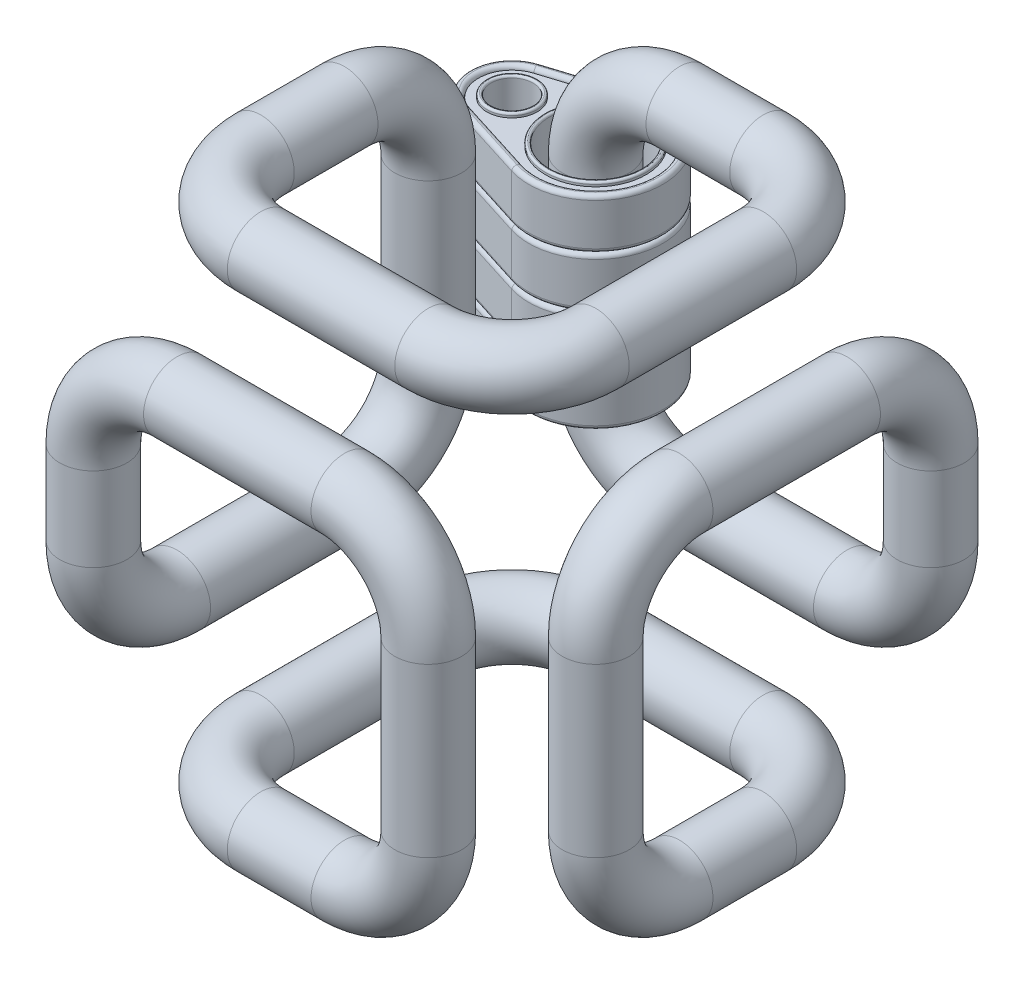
ISO-10303-21;
HEADER;
FILE_DESCRIPTION(('STEP AP214'),'2;1');
FILE_NAME('part.step','',(''),(''),'','','');
FILE_SCHEMA(('AUTOMOTIVE_DESIGN { 1 0 10303 214 1 1 1 1 }'));
ENDSEC;
DATA;
#1=APPLICATION_CONTEXT('core data for automotive mechanical design processes');
#2=APPLICATION_PROTOCOL_DEFINITION('international standard','automotive_design',2000,#1);
#3=PRODUCT_CONTEXT('',#1,'mechanical');
#4=PRODUCT('Part','Part','',(#3));
#5=PRODUCT_RELATED_PRODUCT_CATEGORY('part','',(#4));
#6=PRODUCT_DEFINITION_FORMATION('','',#4);
#7=PRODUCT_DEFINITION_CONTEXT('part definition',#1,'design');
#8=PRODUCT_DEFINITION('design','',#6,#7);
#9=PRODUCT_DEFINITION_SHAPE('','',#8);
#10=(LENGTH_UNIT() NAMED_UNIT(*) SI_UNIT(.MILLI.,.METRE.));
#11=(NAMED_UNIT(*) PLANE_ANGLE_UNIT() SI_UNIT($,.RADIAN.));
#12=(NAMED_UNIT(*) SI_UNIT($,.STERADIAN.) SOLID_ANGLE_UNIT());
#13=UNCERTAINTY_MEASURE_WITH_UNIT(LENGTH_MEASURE(1.E-05),#10,'distance_accuracy_value','');
#14=(GEOMETRIC_REPRESENTATION_CONTEXT(3) GLOBAL_UNCERTAINTY_ASSIGNED_CONTEXT((#13)) GLOBAL_UNIT_ASSIGNED_CONTEXT((#10,
#11,#12)) REPRESENTATION_CONTEXT('',''));
#15=CARTESIAN_POINT('',(0.,0.,0.));
#16=DIRECTION('',(0.,0.,1.));
#17=DIRECTION('',(1.,0.,0.));
#18=AXIS2_PLACEMENT_3D('',#15,#16,#17);
#19=CARTESIAN_POINT('',(10.,35.8,-50.));
#20=DIRECTION('',(0.,1.,0.));
#21=DIRECTION('',(0.,0.,1.));
#22=AXIS2_PLACEMENT_3D('',#19,#20,#21);
#23=PLANE('',#22);
#24=CARTESIAN_POINT('',(0.,35.8,-50.));
#25=DIRECTION('',(0.,1.,0.));
#26=DIRECTION('',(0.,0.,1.));
#27=AXIS2_PLACEMENT_3D('',#24,#25,#26);
#28=CIRCLE('',#27,3.);
#29=CARTESIAN_POINT('',(0.,35.8,-47.));
#30=VERTEX_POINT('',#29);
#31=EDGE_CURVE('E218',#30,#30,#28,.T.);
#32=ORIENTED_EDGE('',*,*,#31,.T.);
#33=EDGE_LOOP('',(#32));
#34=FACE_BOUND('',#33,.T.);
#35=CARTESIAN_POINT('',(0.,35.8,-50.));
#36=DIRECTION('',(0.,1.,0.));
#37=DIRECTION('',(0.,0.,1.));
#38=AXIS2_PLACEMENT_3D('',#35,#36,#37);
#39=CIRCLE('',#38,4.);
#40=CARTESIAN_POINT('',(-1.2,35.8,-53.8157568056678));
#41=VERTEX_POINT('',#40);
#42=CARTESIAN_POINT('',(-1.2,35.8,-46.1842431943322));
#43=VERTEX_POINT('',#42);
#44=EDGE_CURVE('E510',#41,#43,#39,.T.);
#45=ORIENTED_EDGE('',*,*,#44,.F.);
#46=DIRECTION('',(0.953939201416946,0.,-0.3));
#47=VECTOR('',#46,1.);
#48=CARTESIAN_POINT('',(7.90000000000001,35.8,-56.6775744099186));
#49=LINE('',#48,#47);
#50=CARTESIAN_POINT('',(7.9,35.8,-56.6775744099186));
#51=VERTEX_POINT('',#50);
#52=EDGE_CURVE('E513',#41,#51,#49,.T.);
#53=ORIENTED_EDGE('',*,*,#52,.T.);
#54=CARTESIAN_POINT('',(10.,35.8,-50.));
#55=DIRECTION('',(0.,1.,0.));
#56=DIRECTION('',(0.,0.,1.));
#57=AXIS2_PLACEMENT_3D('',#54,#55,#56);
#58=CIRCLE('',#57,6.99999999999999);
#59=CARTESIAN_POINT('',(7.9,35.8,-43.3224255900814));
#60=VERTEX_POINT('',#59);
#61=EDGE_CURVE('E516',#60,#51,#58,.T.);
#62=ORIENTED_EDGE('',*,*,#61,.F.);
#63=DIRECTION('',(0.953939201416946,0.,0.3));
#64=VECTOR('',#63,1.);
#65=CARTESIAN_POINT('',(7.90000000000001,35.8,-43.3224255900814));
#66=LINE('',#65,#64);
#67=EDGE_CURVE('E446',#43,#60,#66,.T.);
#68=ORIENTED_EDGE('',*,*,#67,.F.);
#69=EDGE_LOOP('',(#45,#53,#62,#68));
#70=FACE_BOUND('',#69,.T.);
#71=CARTESIAN_POINT('',(10.,35.8,-50.));
#72=DIRECTION('',(0.,1.,0.));
#73=DIRECTION('',(0.,0.,1.));
#74=AXIS2_PLACEMENT_3D('',#71,#72,#73);
#75=CIRCLE('',#74,6.);
#76=CARTESIAN_POINT('',(10.,35.8,-44.));
#77=VERTEX_POINT('',#76);
#78=EDGE_CURVE('E223',#77,#77,#75,.F.);
#79=ORIENTED_EDGE('',*,*,#78,.F.);
#80=EDGE_LOOP('',(#79));
#81=FACE_BOUND('',#80,.T.);
#82=ADVANCED_FACE('F119',(#34,#70,#81),#23,.F.);
#83=CARTESIAN_POINT('',(10.,40.8,-50.));
#84=DIRECTION('',(0.,1.,0.));
#85=DIRECTION('',(0.,0.,1.));
#86=AXIS2_PLACEMENT_3D('',#83,#84,#85);
#87=PLANE('',#86);
#88=CARTESIAN_POINT('',(0.,40.8,-50.));
#89=DIRECTION('',(0.,1.,0.));
#90=DIRECTION('',(0.,0.,1.));
#91=AXIS2_PLACEMENT_3D('',#88,#89,#90);
#92=CIRCLE('',#91,3.);
#93=CARTESIAN_POINT('',(0.,40.8,-47.));
#94=VERTEX_POINT('',#93);
#95=EDGE_CURVE('E219',#94,#94,#92,.T.);
#96=ORIENTED_EDGE('',*,*,#95,.F.);
#97=EDGE_LOOP('',(#96));
#98=FACE_BOUND('',#97,.T.);
#99=DIRECTION('',(0.953939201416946,0.,-0.3));
#100=VECTOR('',#99,1.);
#101=CARTESIAN_POINT('',(7.90000000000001,40.8,-56.6775744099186));
#102=LINE('',#101,#100);
#103=CARTESIAN_POINT('',(-1.2,40.8,-53.8157568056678));
#104=VERTEX_POINT('',#103);
#105=CARTESIAN_POINT('',(7.9,40.8,-56.6775744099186));
#106=VERTEX_POINT('',#105);
#107=EDGE_CURVE('E420',#104,#106,#102,.T.);
#108=ORIENTED_EDGE('',*,*,#107,.F.);
#109=CARTESIAN_POINT('',(0.,40.8,-50.));
#110=DIRECTION('',(0.,1.,0.));
#111=DIRECTION('',(0.,0.,1.));
#112=AXIS2_PLACEMENT_3D('',#109,#110,#111);
#113=CIRCLE('',#112,4.);
#114=CARTESIAN_POINT('',(-1.2,40.8,-46.1842431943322));
#115=VERTEX_POINT('',#114);
#116=EDGE_CURVE('E422',#104,#115,#113,.T.);
#117=ORIENTED_EDGE('',*,*,#116,.T.);
#118=DIRECTION('',(0.953939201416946,0.,0.3));
#119=VECTOR('',#118,1.);
#120=CARTESIAN_POINT('',(7.90000000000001,40.8,-43.3224255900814));
#121=LINE('',#120,#119);
#122=CARTESIAN_POINT('',(7.9,40.8,-43.3224255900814));
#123=VERTEX_POINT('',#122);
#124=EDGE_CURVE('E204',#115,#123,#121,.T.);
#125=ORIENTED_EDGE('',*,*,#124,.T.);
#126=CARTESIAN_POINT('',(10.,40.8,-50.));
#127=DIRECTION('',(0.,1.,0.));
#128=DIRECTION('',(0.,0.,1.));
#129=AXIS2_PLACEMENT_3D('',#126,#127,#128);
#130=CIRCLE('',#129,6.99999999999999);
#131=EDGE_CURVE('E425',#123,#106,#130,.T.);
#132=ORIENTED_EDGE('',*,*,#131,.T.);
#133=EDGE_LOOP('',(#108,#117,#125,#132));
#134=FACE_BOUND('',#133,.T.);
#135=CARTESIAN_POINT('',(10.,40.8,-50.));
#136=DIRECTION('',(0.,1.,0.));
#137=DIRECTION('',(0.,0.,1.));
#138=AXIS2_PLACEMENT_3D('',#135,#136,#137);
#139=CIRCLE('',#138,6.);
#140=CARTESIAN_POINT('',(10.,40.8,-44.));
#141=VERTEX_POINT('',#140);
#142=EDGE_CURVE('E214',#141,#141,#139,.F.);
#143=ORIENTED_EDGE('',*,*,#142,.T.);
#144=EDGE_LOOP('',(#143));
#145=FACE_BOUND('',#144,.T.);
#146=ADVANCED_FACE('F269',(#98,#134,#145),#87,.T.);
#147=CARTESIAN_POINT('',(-1.5,35.8,-45.2303039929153));
#148=DIRECTION('',(0.3,0.,-0.953939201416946));
#149=DIRECTION('',(-0.953939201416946,0.,-0.3));
#150=AXIS2_PLACEMENT_3D('',#147,#148,#149);
#151=PLANE('',#150);
#152=DIRECTION('',(0.,1.,0.));
#153=VECTOR('',#152,1.);
#154=CARTESIAN_POINT('',(-1.5,35.8,-45.2303039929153));
#155=LINE('',#154,#153);
#156=CARTESIAN_POINT('',(-1.5,35.8,-45.2303039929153));
#157=VERTEX_POINT('',#156);
#158=CARTESIAN_POINT('',(-1.5,40.8,-45.2303039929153));
#159=VERTEX_POINT('',#158);
#160=EDGE_CURVE('E503',#157,#159,#155,.T.);
#161=ORIENTED_EDGE('',*,*,#160,.F.);
#162=DIRECTION('',(0.953939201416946,0.,0.3));
#163=VECTOR('',#162,1.);
#164=CARTESIAN_POINT('',(-1.5,35.8,-45.2303039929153));
#165=LINE('',#164,#163);
#166=CARTESIAN_POINT('',(7.6,35.8,-42.3684863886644));
#167=VERTEX_POINT('',#166);
#168=EDGE_CURVE('E493',#157,#167,#165,.T.);
#169=ORIENTED_EDGE('',*,*,#168,.T.);
#170=DIRECTION('',(0.,1.,0.));
#171=VECTOR('',#170,1.);
#172=CARTESIAN_POINT('',(7.6,35.8,-42.3684863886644));
#173=LINE('',#172,#171);
#174=CARTESIAN_POINT('',(7.6,40.8,-42.3684863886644));
#175=VERTEX_POINT('',#174);
#176=EDGE_CURVE('E500',#167,#175,#173,.T.);
#177=ORIENTED_EDGE('',*,*,#176,.T.);
#178=DIRECTION('',(0.953939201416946,0.,0.3));
#179=VECTOR('',#178,1.);
#180=CARTESIAN_POINT('',(-1.5,40.8,-45.2303039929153));
#181=LINE('',#180,#179);
#182=EDGE_CURVE('E430',#175,#159,#181,.F.);
#183=ORIENTED_EDGE('',*,*,#182,.T.);
#184=EDGE_LOOP('',(#161,#169,#177,#183));
#185=FACE_BOUND('',#184,.T.);
#186=ADVANCED_FACE('F275',(#185),#151,.F.);
#187=CARTESIAN_POINT('',(10.,35.8,-50.));
#188=DIRECTION('',(0.,1.,0.));
#189=DIRECTION('',(0.,0.,1.));
#190=AXIS2_PLACEMENT_3D('',#187,#188,#189);
#191=CYLINDRICAL_SURFACE('',#190,7.99999999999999);
#192=ORIENTED_EDGE('',*,*,#176,.F.);
#193=CARTESIAN_POINT('',(10.,35.8,-50.));
#194=DIRECTION('',(0.,1.,0.));
#195=DIRECTION('',(0.,0.,1.));
#196=AXIS2_PLACEMENT_3D('',#193,#194,#195);
#197=CIRCLE('',#196,7.99999999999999);
#198=CARTESIAN_POINT('',(7.6,35.8,-57.6315136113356));
#199=VERTEX_POINT('',#198);
#200=EDGE_CURVE('E487',#167,#199,#197,.T.);
#201=ORIENTED_EDGE('',*,*,#200,.T.);
#202=DIRECTION('',(0.,1.,0.));
#203=VECTOR('',#202,1.);
#204=CARTESIAN_POINT('',(7.6,35.8,-57.6315136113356));
#205=LINE('',#204,#203);
#206=CARTESIAN_POINT('',(7.6,40.8,-57.6315136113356));
#207=VERTEX_POINT('',#206);
#208=EDGE_CURVE('E507',#199,#207,#205,.T.);
#209=ORIENTED_EDGE('',*,*,#208,.T.);
#210=CARTESIAN_POINT('',(10.,40.8,-50.));
#211=DIRECTION('',(0.,1.,0.));
#212=DIRECTION('',(0.,0.,1.));
#213=AXIS2_PLACEMENT_3D('',#210,#211,#212);
#214=CIRCLE('',#213,7.99999999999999);
#215=EDGE_CURVE('E490',#207,#175,#214,.F.);
#216=ORIENTED_EDGE('',*,*,#215,.T.);
#217=EDGE_LOOP('',(#192,#201,#209,#216));
#218=FACE_BOUND('',#217,.T.);
#219=ADVANCED_FACE('F288',(#218),#191,.T.);
#220=CARTESIAN_POINT('',(-1.5,35.8,-54.7696960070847));
#221=DIRECTION('',(0.3,0.,0.953939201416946));
#222=DIRECTION('',(0.953939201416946,0.,-0.3));
#223=AXIS2_PLACEMENT_3D('',#220,#221,#222);
#224=PLANE('',#223);
#225=ORIENTED_EDGE('',*,*,#208,.F.);
#226=DIRECTION('',(0.953939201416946,0.,-0.3));
#227=VECTOR('',#226,1.);
#228=CARTESIAN_POINT('',(-1.5,35.8,-54.7696960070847));
#229=LINE('',#228,#227);
#230=CARTESIAN_POINT('',(-1.5,35.8,-54.7696960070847));
#231=VERTEX_POINT('',#230);
#232=EDGE_CURVE('E482',#199,#231,#229,.F.);
#233=ORIENTED_EDGE('',*,*,#232,.T.);
#234=DIRECTION('',(0.,1.,0.));
#235=VECTOR('',#234,1.);
#236=CARTESIAN_POINT('',(-1.5,35.8,-54.7696960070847));
#237=LINE('',#236,#235);
#238=CARTESIAN_POINT('',(-1.5,40.8,-54.7696960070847));
#239=VERTEX_POINT('',#238);
#240=EDGE_CURVE('E505',#231,#239,#237,.T.);
#241=ORIENTED_EDGE('',*,*,#240,.T.);
#242=DIRECTION('',(0.953939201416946,0.,-0.3));
#243=VECTOR('',#242,1.);
#244=CARTESIAN_POINT('',(7.6,40.8,-57.6315136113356));
#245=LINE('',#244,#243);
#246=EDGE_CURVE('E484',#239,#207,#245,.T.);
#247=ORIENTED_EDGE('',*,*,#246,.T.);
#248=EDGE_LOOP('',(#225,#233,#241,#247));
#249=FACE_BOUND('',#248,.T.);
#250=ADVANCED_FACE('F284',(#249),#224,.F.);
#251=CARTESIAN_POINT('',(0.,35.8,-50.));
#252=DIRECTION('',(0.,1.,0.));
#253=DIRECTION('',(0.,0.,1.));
#254=AXIS2_PLACEMENT_3D('',#251,#252,#253);
#255=CYLINDRICAL_SURFACE('',#254,5.);
#256=ORIENTED_EDGE('',*,*,#240,.F.);
#257=CARTESIAN_POINT('',(0.,35.8,-50.));
#258=DIRECTION('',(0.,1.,0.));
#259=DIRECTION('',(0.,0.,1.));
#260=AXIS2_PLACEMENT_3D('',#257,#258,#259);
#261=CIRCLE('',#260,5.);
#262=EDGE_CURVE('E478',#231,#157,#261,.T.);
#263=ORIENTED_EDGE('',*,*,#262,.T.);
#264=ORIENTED_EDGE('',*,*,#160,.T.);
#265=CARTESIAN_POINT('',(0.,40.8,-50.));
#266=DIRECTION('',(0.,1.,0.));
#267=DIRECTION('',(0.,0.,1.));
#268=AXIS2_PLACEMENT_3D('',#265,#266,#267);
#269=CIRCLE('',#268,5.);
#270=EDGE_CURVE('E138',#159,#239,#269,.F.);
#271=ORIENTED_EDGE('',*,*,#270,.T.);
#272=EDGE_LOOP('',(#256,#263,#264,#271));
#273=FACE_BOUND('',#272,.T.);
#274=ADVANCED_FACE('F287',(#273),#255,.T.);
#275=CARTESIAN_POINT('',(-1.35,35.8,-54.2927264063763));
#276=DIRECTION('',(-0.953939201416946,0.,0.3));
#277=DIRECTION('',(0.3,0.,0.953939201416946));
#278=AXIS2_PLACEMENT_3D('',#275,#276,#277);
#279=CYLINDRICAL_SURFACE('',#278,0.5);
#280=CARTESIAN_POINT('',(7.75,35.8,-57.1545440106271));
#281=DIRECTION('',(0.953939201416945,0.,-0.300000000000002));
#282=DIRECTION('',(-0.300000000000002,0.,-0.953939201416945));
#283=AXIS2_PLACEMENT_3D('',#280,#281,#282);
#284=CIRCLE('',#283,0.5);
#285=CARTESIAN_POINT('',(7.75,35.3,-57.1545440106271));
#286=VERTEX_POINT('',#285);
#287=EDGE_CURVE('E450',#51,#286,#284,.T.);
#288=ORIENTED_EDGE('',*,*,#287,.F.);
#289=ORIENTED_EDGE('',*,*,#52,.F.);
#290=CARTESIAN_POINT('',(-1.35,35.8,-54.2927264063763));
#291=DIRECTION('',(-0.953939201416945,0.,0.300000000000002));
#292=DIRECTION('',(0.300000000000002,0.,0.953939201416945));
#293=AXIS2_PLACEMENT_3D('',#290,#291,#292);
#294=CIRCLE('',#293,0.5);
#295=CARTESIAN_POINT('',(-1.35,35.3,-54.2927264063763));
#296=VERTEX_POINT('',#295);
#297=EDGE_CURVE('E443',#296,#41,#294,.T.);
#298=ORIENTED_EDGE('',*,*,#297,.F.);
#299=DIRECTION('',(0.953939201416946,0.,-0.3));
#300=VECTOR('',#299,1.);
#301=CARTESIAN_POINT('',(-1.35,35.3,-54.2927264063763));
#302=LINE('',#301,#300);
#303=EDGE_CURVE('E447',#286,#296,#302,.F.);
#304=ORIENTED_EDGE('',*,*,#303,.F.);
#305=EDGE_LOOP('',(#288,#289,#298,#304));
#306=FACE_BOUND('',#305,.T.);
#307=ADVANCED_FACE('F292',(#306),#279,.T.);
#308=CARTESIAN_POINT('',(0.,35.8,-50.));
#309=DIRECTION('',(0.,1.,0.));
#310=DIRECTION('',(0.,0.,1.));
#311=AXIS2_PLACEMENT_3D('',#308,#309,#310);
#312=TOROIDAL_SURFACE('',#311,4.5,0.5);
#313=ORIENTED_EDGE('',*,*,#297,.T.);
#314=ORIENTED_EDGE('',*,*,#44,.T.);
#315=CARTESIAN_POINT('',(-1.35,35.8,-45.7072735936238));
#316=DIRECTION('',(0.953939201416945,0.,0.300000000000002));
#317=DIRECTION('',(0.300000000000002,0.,-0.953939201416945));
#318=AXIS2_PLACEMENT_3D('',#315,#316,#317);
#319=CIRCLE('',#318,0.5);
#320=CARTESIAN_POINT('',(-1.35,35.3,-45.7072735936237));
#321=VERTEX_POINT('',#320);
#322=EDGE_CURVE('E455',#321,#43,#319,.T.);
#323=ORIENTED_EDGE('',*,*,#322,.F.);
#324=CARTESIAN_POINT('',(0.,35.3,-50.));
#325=DIRECTION('',(0.,1.,0.));
#326=DIRECTION('',(0.,0.,1.));
#327=AXIS2_PLACEMENT_3D('',#324,#325,#326);
#328=CIRCLE('',#327,4.5);
#329=EDGE_CURVE('E458',#296,#321,#328,.T.);
#330=ORIENTED_EDGE('',*,*,#329,.F.);
#331=EDGE_LOOP('',(#313,#314,#323,#330));
#332=FACE_BOUND('',#331,.T.);
#333=ADVANCED_FACE('F322',(#332),#312,.T.);
#334=CARTESIAN_POINT('',(-1.35,35.8,-54.2927264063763));
#335=DIRECTION('',(0.953939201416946,0.,-0.3));
#336=DIRECTION('',(-0.3,0.,-0.953939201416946));
#337=AXIS2_PLACEMENT_3D('',#334,#335,#336);
#338=CYLINDRICAL_SURFACE('',#337,0.5);
#339=CARTESIAN_POINT('',(7.75,35.8,-57.1545440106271));
#340=DIRECTION('',(0.953939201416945,0.,-0.300000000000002));
#341=DIRECTION('',(-0.300000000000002,0.,-0.953939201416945));
#342=AXIS2_PLACEMENT_3D('',#339,#340,#341);
#343=CIRCLE('',#342,0.5);
#344=EDGE_CURVE('E464',#286,#199,#343,.T.);
#345=ORIENTED_EDGE('',*,*,#344,.F.);
#346=ORIENTED_EDGE('',*,*,#303,.T.);
#347=CARTESIAN_POINT('',(-1.35,35.8,-54.2927264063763));
#348=DIRECTION('',(-0.953939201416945,0.,0.300000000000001));
#349=DIRECTION('',(0.300000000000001,0.,0.953939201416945));
#350=AXIS2_PLACEMENT_3D('',#347,#348,#349);
#351=CIRCLE('',#350,0.5);
#352=EDGE_CURVE('E461',#231,#296,#351,.T.);
#353=ORIENTED_EDGE('',*,*,#352,.F.);
#354=ORIENTED_EDGE('',*,*,#232,.F.);
#355=EDGE_LOOP('',(#345,#346,#353,#354));
#356=FACE_BOUND('',#355,.T.);
#357=ADVANCED_FACE('F318',(#356),#338,.T.);
#358=CARTESIAN_POINT('',(10.,35.8,-50.));
#359=DIRECTION('',(0.,1.,0.));
#360=DIRECTION('',(0.,0.,1.));
#361=AXIS2_PLACEMENT_3D('',#358,#359,#360);
#362=TOROIDAL_SURFACE('',#361,7.49999999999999,0.5);
#363=CARTESIAN_POINT('',(7.75,35.8,-42.8454559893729));
#364=DIRECTION('',(-0.953939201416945,0.,-0.300000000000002));
#365=DIRECTION('',(-0.300000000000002,0.,0.953939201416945));
#366=AXIS2_PLACEMENT_3D('',#363,#364,#365);
#367=CIRCLE('',#366,0.5);
#368=CARTESIAN_POINT('',(7.75,35.3,-42.8454559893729));
#369=VERTEX_POINT('',#368);
#370=EDGE_CURVE('E453',#60,#369,#367,.T.);
#371=ORIENTED_EDGE('',*,*,#370,.F.);
#372=ORIENTED_EDGE('',*,*,#61,.T.);
#373=ORIENTED_EDGE('',*,*,#287,.T.);
#374=CARTESIAN_POINT('',(10.,35.3,-50.));
#375=DIRECTION('',(0.,1.,0.));
#376=DIRECTION('',(0.,0.,1.));
#377=AXIS2_PLACEMENT_3D('',#374,#375,#376);
#378=CIRCLE('',#377,7.49999999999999);
#379=EDGE_CURVE('E467',#369,#286,#378,.T.);
#380=ORIENTED_EDGE('',*,*,#379,.F.);
#381=EDGE_LOOP('',(#371,#372,#373,#380));
#382=FACE_BOUND('',#381,.T.);
#383=ADVANCED_FACE('F314',(#382),#362,.T.);
#384=CARTESIAN_POINT('',(-1.35,35.8,-45.7072735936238));
#385=DIRECTION('',(0.953939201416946,0.,0.3));
#386=DIRECTION('',(0.3,0.,-0.953939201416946));
#387=AXIS2_PLACEMENT_3D('',#384,#385,#386);
#388=CYLINDRICAL_SURFACE('',#387,0.5);
#389=ORIENTED_EDGE('',*,*,#67,.T.);
#390=ORIENTED_EDGE('',*,*,#370,.T.);
#391=DIRECTION('',(0.953939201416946,0.,0.3));
#392=VECTOR('',#391,1.);
#393=CARTESIAN_POINT('',(-1.35,35.3,-45.7072735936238));
#394=LINE('',#393,#392);
#395=EDGE_CURVE('E470',#321,#369,#394,.T.);
#396=ORIENTED_EDGE('',*,*,#395,.F.);
#397=ORIENTED_EDGE('',*,*,#322,.T.);
#398=EDGE_LOOP('',(#389,#390,#396,#397));
#399=FACE_BOUND('',#398,.T.);
#400=ADVANCED_FACE('F310',(#399),#388,.T.);
#401=CARTESIAN_POINT('',(0.,35.8,-50.));
#402=DIRECTION('',(0.,1.,0.));
#403=DIRECTION('',(0.,0.,1.));
#404=AXIS2_PLACEMENT_3D('',#401,#402,#403);
#405=TOROIDAL_SURFACE('',#404,4.5,0.5);
#406=ORIENTED_EDGE('',*,*,#352,.T.);
#407=ORIENTED_EDGE('',*,*,#329,.T.);
#408=CARTESIAN_POINT('',(-1.35,35.8,-45.7072735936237));
#409=DIRECTION('',(0.953939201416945,0.,0.300000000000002));
#410=DIRECTION('',(0.300000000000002,0.,-0.953939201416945));
#411=AXIS2_PLACEMENT_3D('',#408,#409,#410);
#412=CIRCLE('',#411,0.5);
#413=EDGE_CURVE('E473',#157,#321,#412,.T.);
#414=ORIENTED_EDGE('',*,*,#413,.F.);
#415=ORIENTED_EDGE('',*,*,#262,.F.);
#416=EDGE_LOOP('',(#406,#407,#414,#415));
#417=FACE_BOUND('',#416,.T.);
#418=ADVANCED_FACE('F306',(#417),#405,.T.);
#419=CARTESIAN_POINT('',(10.,35.8,-50.));
#420=DIRECTION('',(0.,1.,0.));
#421=DIRECTION('',(0.,0.,1.));
#422=AXIS2_PLACEMENT_3D('',#419,#420,#421);
#423=TOROIDAL_SURFACE('',#422,7.49999999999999,0.5);
#424=ORIENTED_EDGE('',*,*,#344,.T.);
#425=ORIENTED_EDGE('',*,*,#200,.F.);
#426=CARTESIAN_POINT('',(7.75,35.8,-42.8454559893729));
#427=DIRECTION('',(-0.953939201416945,0.,-0.300000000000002));
#428=DIRECTION('',(-0.300000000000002,0.,0.953939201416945));
#429=AXIS2_PLACEMENT_3D('',#426,#427,#428);
#430=CIRCLE('',#429,0.5);
#431=EDGE_CURVE('E178',#369,#167,#430,.T.);
#432=ORIENTED_EDGE('',*,*,#431,.F.);
#433=ORIENTED_EDGE('',*,*,#379,.T.);
#434=EDGE_LOOP('',(#424,#425,#432,#433));
#435=FACE_BOUND('',#434,.T.);
#436=ADVANCED_FACE('F302',(#435),#423,.T.);
#437=CARTESIAN_POINT('',(-1.35,35.8,-45.7072735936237));
#438=DIRECTION('',(0.953939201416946,0.,0.3));
#439=DIRECTION('',(0.3,0.,-0.953939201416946));
#440=AXIS2_PLACEMENT_3D('',#437,#438,#439);
#441=CYLINDRICAL_SURFACE('',#440,0.5);
#442=ORIENTED_EDGE('',*,*,#413,.T.);
#443=ORIENTED_EDGE('',*,*,#395,.T.);
#444=ORIENTED_EDGE('',*,*,#431,.T.);
#445=ORIENTED_EDGE('',*,*,#168,.F.);
#446=EDGE_LOOP('',(#442,#443,#444,#445));
#447=FACE_BOUND('',#446,.T.);
#448=ADVANCED_FACE('F299',(#447),#441,.T.);
#449=CARTESIAN_POINT('',(0.,40.8,-50.));
#450=DIRECTION('',(0.,1.,0.));
#451=DIRECTION('',(0.,0.,1.));
#452=AXIS2_PLACEMENT_3D('',#449,#450,#451);
#453=TOROIDAL_SURFACE('',#452,4.5,0.5);
#454=CARTESIAN_POINT('',(-1.35,40.8,-54.2927264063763));
#455=DIRECTION('',(0.953939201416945,0.,-0.300000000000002));
#456=DIRECTION('',(-0.300000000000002,0.,-0.953939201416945));
#457=AXIS2_PLACEMENT_3D('',#454,#455,#456);
#458=CIRCLE('',#457,0.5);
#459=CARTESIAN_POINT('',(-1.35,41.3,-54.2927264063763));
#460=VERTEX_POINT('',#459);
#461=EDGE_CURVE('E191',#239,#460,#458,.T.);
#462=ORIENTED_EDGE('',*,*,#461,.F.);
#463=ORIENTED_EDGE('',*,*,#270,.F.);
#464=CARTESIAN_POINT('',(-1.35,40.8,-45.7072735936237));
#465=DIRECTION('',(0.953939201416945,0.,0.300000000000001));
#466=DIRECTION('',(0.300000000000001,0.,-0.953939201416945));
#467=AXIS2_PLACEMENT_3D('',#464,#465,#466);
#468=CIRCLE('',#467,0.5);
#469=CARTESIAN_POINT('',(-1.35,41.3,-45.7072735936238));
#470=VERTEX_POINT('',#469);
#471=EDGE_CURVE('E172',#470,#159,#468,.T.);
#472=ORIENTED_EDGE('',*,*,#471,.F.);
#473=CARTESIAN_POINT('',(0.,41.3,-50.));
#474=DIRECTION('',(0.,1.,0.));
#475=DIRECTION('',(0.,0.,1.));
#476=AXIS2_PLACEMENT_3D('',#473,#474,#475);
#477=CIRCLE('',#476,4.5);
#478=EDGE_CURVE('E169',#460,#470,#477,.T.);
#479=ORIENTED_EDGE('',*,*,#478,.F.);
#480=EDGE_LOOP('',(#462,#463,#472,#479));
#481=FACE_BOUND('',#480,.T.);
#482=ADVANCED_FACE('F173',(#481),#453,.T.);
#483=CARTESIAN_POINT('',(-1.35,40.8,-45.7072735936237));
#484=DIRECTION('',(-0.953939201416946,0.,-0.3));
#485=DIRECTION('',(-0.3,0.,0.953939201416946));
#486=AXIS2_PLACEMENT_3D('',#483,#484,#485);
#487=CYLINDRICAL_SURFACE('',#486,0.5);
#488=ORIENTED_EDGE('',*,*,#471,.T.);
#489=ORIENTED_EDGE('',*,*,#182,.F.);
#490=CARTESIAN_POINT('',(7.75,40.8,-42.8454559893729));
#491=DIRECTION('',(0.953939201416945,0.,0.300000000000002));
#492=DIRECTION('',(0.300000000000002,0.,-0.953939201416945));
#493=AXIS2_PLACEMENT_3D('',#490,#491,#492);
#494=CIRCLE('',#493,0.5);
#495=CARTESIAN_POINT('',(7.75,41.3,-42.8454559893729));
#496=VERTEX_POINT('',#495);
#497=EDGE_CURVE('E197',#496,#175,#494,.T.);
#498=ORIENTED_EDGE('',*,*,#497,.F.);
#499=DIRECTION('',(0.953939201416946,0.,0.3));
#500=VECTOR('',#499,1.);
#501=CARTESIAN_POINT('',(7.75,41.3,-42.8454559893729));
#502=LINE('',#501,#500);
#503=EDGE_CURVE('E194',#470,#496,#502,.T.);
#504=ORIENTED_EDGE('',*,*,#503,.F.);
#505=EDGE_LOOP('',(#488,#489,#498,#504));
#506=FACE_BOUND('',#505,.T.);
#507=ADVANCED_FACE('F195',(#506),#487,.T.);
#508=CARTESIAN_POINT('',(0.,40.8,-50.));
#509=DIRECTION('',(0.,1.,0.));
#510=DIRECTION('',(0.,0.,1.));
#511=AXIS2_PLACEMENT_3D('',#508,#509,#510);
#512=TOROIDAL_SURFACE('',#511,4.5,0.5);
#513=CARTESIAN_POINT('',(-1.35,40.8,-54.2927264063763));
#514=DIRECTION('',(0.953939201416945,0.,-0.300000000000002));
#515=DIRECTION('',(-0.300000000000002,0.,-0.953939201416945));
#516=AXIS2_PLACEMENT_3D('',#513,#514,#515);
#517=CIRCLE('',#516,0.5);
#518=EDGE_CURVE('E189',#460,#104,#517,.T.);
#519=ORIENTED_EDGE('',*,*,#518,.F.);
#520=ORIENTED_EDGE('',*,*,#478,.T.);
#521=CARTESIAN_POINT('',(-1.35,40.8,-45.7072735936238));
#522=DIRECTION('',(0.953939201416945,0.,0.300000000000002));
#523=DIRECTION('',(0.300000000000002,0.,-0.953939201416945));
#524=AXIS2_PLACEMENT_3D('',#521,#522,#523);
#525=CIRCLE('',#524,0.5);
#526=EDGE_CURVE('E186',#115,#470,#525,.T.);
#527=ORIENTED_EDGE('',*,*,#526,.F.);
#528=ORIENTED_EDGE('',*,*,#116,.F.);
#529=EDGE_LOOP('',(#519,#520,#527,#528));
#530=FACE_BOUND('',#529,.T.);
#531=ADVANCED_FACE('F183',(#530),#512,.T.);
#532=CARTESIAN_POINT('',(-1.35,40.8,-54.2927264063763));
#533=DIRECTION('',(-0.953939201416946,0.,0.3));
#534=DIRECTION('',(0.3,0.,0.953939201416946));
#535=AXIS2_PLACEMENT_3D('',#532,#533,#534);
#536=CYLINDRICAL_SURFACE('',#535,0.5);
#537=CARTESIAN_POINT('',(7.75,40.8,-57.1545440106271));
#538=DIRECTION('',(0.953939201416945,0.,-0.300000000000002));
#539=DIRECTION('',(-0.300000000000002,0.,-0.953939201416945));
#540=AXIS2_PLACEMENT_3D('',#537,#538,#539);
#541=CIRCLE('',#540,0.5);
#542=CARTESIAN_POINT('',(7.75,41.3,-57.1545440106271));
#543=VERTEX_POINT('',#542);
#544=EDGE_CURVE('E211',#207,#543,#541,.T.);
#545=ORIENTED_EDGE('',*,*,#544,.F.);
#546=ORIENTED_EDGE('',*,*,#246,.F.);
#547=ORIENTED_EDGE('',*,*,#461,.T.);
#548=DIRECTION('',(0.953939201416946,0.,-0.3));
#549=VECTOR('',#548,1.);
#550=CARTESIAN_POINT('',(-1.35,41.3,-54.2927264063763));
#551=LINE('',#550,#549);
#552=EDGE_CURVE('E206',#543,#460,#551,.F.);
#553=ORIENTED_EDGE('',*,*,#552,.F.);
#554=EDGE_LOOP('',(#545,#546,#547,#553));
#555=FACE_BOUND('',#554,.T.);
#556=ADVANCED_FACE('F344',(#555),#536,.T.);
#557=CARTESIAN_POINT('',(10.,40.8,-50.));
#558=DIRECTION('',(0.,1.,0.));
#559=DIRECTION('',(0.,0.,1.));
#560=AXIS2_PLACEMENT_3D('',#557,#558,#559);
#561=TOROIDAL_SURFACE('',#560,7.49999999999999,0.5);
#562=ORIENTED_EDGE('',*,*,#215,.F.);
#563=ORIENTED_EDGE('',*,*,#544,.T.);
#564=CARTESIAN_POINT('',(10.,41.3,-50.));
#565=DIRECTION('',(0.,1.,0.));
#566=DIRECTION('',(0.,0.,1.));
#567=AXIS2_PLACEMENT_3D('',#564,#565,#566);
#568=CIRCLE('',#567,7.49999999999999);
#569=EDGE_CURVE('E436',#496,#543,#568,.T.);
#570=ORIENTED_EDGE('',*,*,#569,.F.);
#571=ORIENTED_EDGE('',*,*,#497,.T.);
#572=EDGE_LOOP('',(#562,#563,#570,#571));
#573=FACE_BOUND('',#572,.T.);
#574=ADVANCED_FACE('F341',(#573),#561,.T.);
#575=CARTESIAN_POINT('',(-1.35,40.8,-45.7072735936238));
#576=DIRECTION('',(-0.953939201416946,0.,-0.3));
#577=DIRECTION('',(-0.3,0.,0.953939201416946));
#578=AXIS2_PLACEMENT_3D('',#575,#576,#577);
#579=CYLINDRICAL_SURFACE('',#578,0.5);
#580=ORIENTED_EDGE('',*,*,#526,.T.);
#581=ORIENTED_EDGE('',*,*,#503,.T.);
#582=CARTESIAN_POINT('',(7.75,40.8,-42.8454559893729));
#583=DIRECTION('',(0.953939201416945,0.,0.300000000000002));
#584=DIRECTION('',(0.300000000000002,0.,-0.953939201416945));
#585=AXIS2_PLACEMENT_3D('',#582,#583,#584);
#586=CIRCLE('',#585,0.5);
#587=EDGE_CURVE('E437',#123,#496,#586,.T.);
#588=ORIENTED_EDGE('',*,*,#587,.F.);
#589=ORIENTED_EDGE('',*,*,#124,.F.);
#590=EDGE_LOOP('',(#580,#581,#588,#589));
#591=FACE_BOUND('',#590,.T.);
#592=ADVANCED_FACE('F202',(#591),#579,.T.);
#593=CARTESIAN_POINT('',(-1.35,40.8,-54.2927264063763));
#594=DIRECTION('',(0.953939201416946,0.,-0.3));
#595=DIRECTION('',(-0.3,0.,-0.953939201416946));
#596=AXIS2_PLACEMENT_3D('',#593,#594,#595);
#597=CYLINDRICAL_SURFACE('',#596,0.5);
#598=ORIENTED_EDGE('',*,*,#518,.T.);
#599=ORIENTED_EDGE('',*,*,#107,.T.);
#600=CARTESIAN_POINT('',(7.75,40.8,-57.1545440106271));
#601=DIRECTION('',(0.953939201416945,0.,-0.300000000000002));
#602=DIRECTION('',(-0.300000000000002,0.,-0.953939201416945));
#603=AXIS2_PLACEMENT_3D('',#600,#601,#602);
#604=CIRCLE('',#603,0.5);
#605=EDGE_CURVE('E217',#543,#106,#604,.T.);
#606=ORIENTED_EDGE('',*,*,#605,.F.);
#607=ORIENTED_EDGE('',*,*,#552,.T.);
#608=EDGE_LOOP('',(#598,#599,#606,#607));
#609=FACE_BOUND('',#608,.T.);
#610=ADVANCED_FACE('F334',(#609),#597,.T.);
#611=CARTESIAN_POINT('',(10.,40.8,-50.));
#612=DIRECTION('',(0.,1.,0.));
#613=DIRECTION('',(0.,0.,1.));
#614=AXIS2_PLACEMENT_3D('',#611,#612,#613);
#615=TOROIDAL_SURFACE('',#614,7.49999999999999,0.5);
#616=ORIENTED_EDGE('',*,*,#587,.T.);
#617=ORIENTED_EDGE('',*,*,#569,.T.);
#618=ORIENTED_EDGE('',*,*,#605,.T.);
#619=ORIENTED_EDGE('',*,*,#131,.F.);
#620=EDGE_LOOP('',(#616,#617,#618,#619));
#621=FACE_BOUND('',#620,.T.);
#622=ADVANCED_FACE('F330',(#621),#615,.T.);
#623=CARTESIAN_POINT('',(10.,35.3,-50.));
#624=DIRECTION('',(0.,1.,0.));
#625=DIRECTION('',(0.,0.,1.));
#626=AXIS2_PLACEMENT_3D('',#623,#624,#625);
#627=CYLINDRICAL_SURFACE('',#626,6.);
#628=CARTESIAN_POINT('',(10.,41.05,-50.));
#629=DIRECTION('',(0.,-1.,0.));
#630=DIRECTION('',(0.,0.,-1.));
#631=AXIS2_PLACEMENT_3D('',#628,#629,#630);
#632=CIRCLE('',#631,6.);
#633=CARTESIAN_POINT('',(10.,41.05,-56.));
#634=VERTEX_POINT('',#633);
#635=EDGE_CURVE('E129',#634,#634,#632,.T.);
#636=ORIENTED_EDGE('',*,*,#635,.T.);
#637=EDGE_LOOP('',(#636));
#638=FACE_BOUND('',#637,.T.);
#639=ORIENTED_EDGE('',*,*,#142,.F.);
#640=EDGE_LOOP('',(#639));
#641=FACE_BOUND('',#640,.T.);
#642=ADVANCED_FACE('F333',(#638,#641),#627,.T.);
#643=CARTESIAN_POINT('',(10.,35.8,-50.));
#644=DIRECTION('',(0.,1.,0.));
#645=DIRECTION('',(0.,0.,1.));
#646=AXIS2_PLACEMENT_3D('',#643,#644,#645);
#647=CYLINDRICAL_SURFACE('',#646,5.5);
#648=CARTESIAN_POINT('',(10.,35.55,-50.));
#649=DIRECTION('',(0.,-1.,0.));
#650=DIRECTION('',(0.,0.,-1.));
#651=AXIS2_PLACEMENT_3D('',#648,#649,#650);
#652=CIRCLE('',#651,5.5);
#653=CARTESIAN_POINT('',(10.,35.55,-55.5));
#654=VERTEX_POINT('',#653);
#655=EDGE_CURVE('E235',#654,#654,#652,.T.);
#656=ORIENTED_EDGE('',*,*,#655,.T.);
#657=EDGE_LOOP('',(#656));
#658=FACE_BOUND('',#657,.T.);
#659=CARTESIAN_POINT('',(10.,41.05,-50.));
#660=DIRECTION('',(0.,-1.,0.));
#661=DIRECTION('',(0.,0.,-1.));
#662=AXIS2_PLACEMENT_3D('',#659,#660,#661);
#663=CIRCLE('',#662,5.5);
#664=CARTESIAN_POINT('',(10.,41.05,-55.5));
#665=VERTEX_POINT('',#664);
#666=EDGE_CURVE('E232',#665,#665,#663,.F.);
#667=ORIENTED_EDGE('',*,*,#666,.T.);
#668=EDGE_LOOP('',(#667));
#669=FACE_BOUND('',#668,.T.);
#670=ADVANCED_FACE('F281',(#658,#669),#647,.F.);
#671=CARTESIAN_POINT('',(10.,35.55,-50.));
#672=DIRECTION('',(0.,-1.,0.));
#673=DIRECTION('',(0.,0.,-1.));
#674=AXIS2_PLACEMENT_3D('',#671,#672,#673);
#675=CIRCLE('',#674,6.);
#676=CARTESIAN_POINT('',(10.,35.55,-56.));
#677=VERTEX_POINT('',#676);
#678=EDGE_CURVE('E238',#677,#677,#675,.F.);
#679=ORIENTED_EDGE('',*,*,#678,.T.);
#680=EDGE_LOOP('',(#679));
#681=FACE_BOUND('',#680,.T.);
#682=ORIENTED_EDGE('',*,*,#78,.T.);
#683=EDGE_LOOP('',(#682));
#684=FACE_BOUND('',#683,.T.);
#685=ADVANCED_FACE('F380',(#681,#684),#627,.T.);
#686=CARTESIAN_POINT('',(0.,41.3,-50.));
#687=DIRECTION('',(0.,-1.,0.));
#688=DIRECTION('',(0.,0.,-1.));
#689=AXIS2_PLACEMENT_3D('',#686,#687,#688);
#690=CYLINDRICAL_SURFACE('',#689,3.);
#691=CARTESIAN_POINT('',(0.,41.05,-50.));
#692=DIRECTION('',(0.,-1.,0.));
#693=DIRECTION('',(0.,0.,-1.));
#694=AXIS2_PLACEMENT_3D('',#691,#692,#693);
#695=CIRCLE('',#694,3.);
#696=CARTESIAN_POINT('',(0.,41.05,-53.));
#697=VERTEX_POINT('',#696);
#698=EDGE_CURVE('E13',#697,#697,#695,.T.);
#699=ORIENTED_EDGE('',*,*,#698,.T.);
#700=EDGE_LOOP('',(#699));
#701=FACE_BOUND('',#700,.T.);
#702=ORIENTED_EDGE('',*,*,#95,.T.);
#703=EDGE_LOOP('',(#702));
#704=FACE_BOUND('',#703,.T.);
#705=ADVANCED_FACE('F386',(#701,#704),#690,.T.);
#706=CARTESIAN_POINT('',(0.,35.8,-50.));
#707=DIRECTION('',(0.,1.,0.));
#708=DIRECTION('',(0.,0.,1.));
#709=AXIS2_PLACEMENT_3D('',#706,#707,#708);
#710=CYLINDRICAL_SURFACE('',#709,2.5);
#711=CARTESIAN_POINT('',(0.,35.55,-50.));
#712=DIRECTION('',(0.,-1.,0.));
#713=DIRECTION('',(0.,0.,-1.));
#714=AXIS2_PLACEMENT_3D('',#711,#712,#713);
#715=CIRCLE('',#714,2.5);
#716=CARTESIAN_POINT('',(0.,35.55,-52.5));
#717=VERTEX_POINT('',#716);
#718=EDGE_CURVE('E226',#717,#717,#715,.T.);
#719=ORIENTED_EDGE('',*,*,#718,.T.);
#720=EDGE_LOOP('',(#719));
#721=FACE_BOUND('',#720,.T.);
#722=CARTESIAN_POINT('',(0.,41.05,-50.));
#723=DIRECTION('',(0.,-1.,0.));
#724=DIRECTION('',(0.,0.,-1.));
#725=AXIS2_PLACEMENT_3D('',#722,#723,#724);
#726=CIRCLE('',#725,2.5);
#727=CARTESIAN_POINT('',(0.,41.05,-52.5));
#728=VERTEX_POINT('',#727);
#729=EDGE_CURVE('E222',#728,#728,#726,.F.);
#730=ORIENTED_EDGE('',*,*,#729,.T.);
#731=EDGE_LOOP('',(#730));
#732=FACE_BOUND('',#731,.T.);
#733=ADVANCED_FACE('F396',(#721,#732),#710,.F.);
#734=CARTESIAN_POINT('',(0.,35.55,-50.));
#735=DIRECTION('',(0.,-1.,0.));
#736=DIRECTION('',(0.,0.,-1.));
#737=AXIS2_PLACEMENT_3D('',#734,#735,#736);
#738=CIRCLE('',#737,3.);
#739=CARTESIAN_POINT('',(0.,35.55,-53.));
#740=VERTEX_POINT('',#739);
#741=EDGE_CURVE('E229',#740,#740,#738,.F.);
#742=ORIENTED_EDGE('',*,*,#741,.T.);
#743=EDGE_LOOP('',(#742));
#744=FACE_BOUND('',#743,.T.);
#745=ORIENTED_EDGE('',*,*,#31,.F.);
#746=EDGE_LOOP('',(#745));
#747=FACE_BOUND('',#746,.T.);
#748=ADVANCED_FACE('F363',(#744,#747),#690,.T.);
#749=CARTESIAN_POINT('',(0.,35.55,-50.));
#750=DIRECTION('',(0.,-1.,0.));
#751=DIRECTION('',(0.,0.,-1.));
#752=AXIS2_PLACEMENT_3D('',#749,#750,#751);
#753=TOROIDAL_SURFACE('',#752,2.75,0.25);
#754=ORIENTED_EDGE('',*,*,#741,.F.);
#755=EDGE_LOOP('',(#754));
#756=FACE_BOUND('',#755,.T.);
#757=CARTESIAN_POINT('',(0.,35.3,-50.));
#758=DIRECTION('',(0.,-1.,0.));
#759=DIRECTION('',(0.,0.,-1.));
#760=AXIS2_PLACEMENT_3D('',#757,#758,#759);
#761=CIRCLE('',#760,2.75);
#762=CARTESIAN_POINT('',(0.,35.3,-52.75));
#763=VERTEX_POINT('',#762);
#764=EDGE_CURVE('E243',#763,#763,#761,.T.);
#765=ORIENTED_EDGE('',*,*,#764,.F.);
#766=EDGE_LOOP('',(#765));
#767=FACE_BOUND('',#766,.T.);
#768=ADVANCED_FACE('F359',(#756,#767),#753,.T.);
#769=CARTESIAN_POINT('',(0.,35.55,-50.));
#770=DIRECTION('',(0.,-1.,0.));
#771=DIRECTION('',(0.,0.,-1.));
#772=AXIS2_PLACEMENT_3D('',#769,#770,#771);
#773=TOROIDAL_SURFACE('',#772,2.75,0.25);
#774=ORIENTED_EDGE('',*,*,#764,.T.);
#775=EDGE_LOOP('',(#774));
#776=FACE_BOUND('',#775,.T.);
#777=ORIENTED_EDGE('',*,*,#718,.F.);
#778=EDGE_LOOP('',(#777));
#779=FACE_BOUND('',#778,.T.);
#780=ADVANCED_FACE('F355',(#776,#779),#773,.T.);
#781=CARTESIAN_POINT('',(10.,35.55,-50.));
#782=DIRECTION('',(0.,-1.,0.));
#783=DIRECTION('',(0.,0.,-1.));
#784=AXIS2_PLACEMENT_3D('',#781,#782,#783);
#785=TOROIDAL_SURFACE('',#784,5.75,0.25);
#786=ORIENTED_EDGE('',*,*,#678,.F.);
#787=EDGE_LOOP('',(#786));
#788=FACE_BOUND('',#787,.T.);
#789=CARTESIAN_POINT('',(10.,35.3,-50.));
#790=DIRECTION('',(0.,-1.,0.));
#791=DIRECTION('',(0.,0.,-1.));
#792=AXIS2_PLACEMENT_3D('',#789,#790,#791);
#793=CIRCLE('',#792,5.75);
#794=CARTESIAN_POINT('',(10.,35.3,-55.75));
#795=VERTEX_POINT('',#794);
#796=EDGE_CURVE('E246',#795,#795,#793,.T.);
#797=ORIENTED_EDGE('',*,*,#796,.F.);
#798=EDGE_LOOP('',(#797));
#799=FACE_BOUND('',#798,.T.);
#800=ADVANCED_FACE('F358',(#788,#799),#785,.T.);
#801=CARTESIAN_POINT('',(10.,35.55,-50.));
#802=DIRECTION('',(0.,-1.,0.));
#803=DIRECTION('',(0.,0.,-1.));
#804=AXIS2_PLACEMENT_3D('',#801,#802,#803);
#805=TOROIDAL_SURFACE('',#804,5.75,0.25);
#806=ORIENTED_EDGE('',*,*,#796,.T.);
#807=EDGE_LOOP('',(#806));
#808=FACE_BOUND('',#807,.T.);
#809=ORIENTED_EDGE('',*,*,#655,.F.);
#810=EDGE_LOOP('',(#809));
#811=FACE_BOUND('',#810,.T.);
#812=ADVANCED_FACE('F365',(#808,#811),#805,.T.);
#813=CARTESIAN_POINT('',(10.,41.05,-50.));
#814=DIRECTION('',(0.,-1.,0.));
#815=DIRECTION('',(0.,0.,-1.));
#816=AXIS2_PLACEMENT_3D('',#813,#814,#815);
#817=TOROIDAL_SURFACE('',#816,5.75,0.25);
#818=ORIENTED_EDGE('',*,*,#666,.F.);
#819=EDGE_LOOP('',(#818));
#820=FACE_BOUND('',#819,.T.);
#821=CARTESIAN_POINT('',(10.,41.3,-50.));
#822=DIRECTION('',(0.,-1.,0.));
#823=DIRECTION('',(0.,0.,-1.));
#824=AXIS2_PLACEMENT_3D('',#821,#822,#823);
#825=CIRCLE('',#824,5.75);
#826=CARTESIAN_POINT('',(10.,41.3,-55.75));
#827=VERTEX_POINT('',#826);
#828=EDGE_CURVE('E248',#827,#827,#825,.T.);
#829=ORIENTED_EDGE('',*,*,#828,.F.);
#830=EDGE_LOOP('',(#829));
#831=FACE_BOUND('',#830,.T.);
#832=ADVANCED_FACE('F265',(#820,#831),#817,.T.);
#833=CARTESIAN_POINT('',(10.,41.05,-50.));
#834=DIRECTION('',(0.,-1.,0.));
#835=DIRECTION('',(0.,0.,-1.));
#836=AXIS2_PLACEMENT_3D('',#833,#834,#835);
#837=TOROIDAL_SURFACE('',#836,5.75,0.25);
#838=ORIENTED_EDGE('',*,*,#828,.T.);
#839=EDGE_LOOP('',(#838));
#840=FACE_BOUND('',#839,.T.);
#841=ORIENTED_EDGE('',*,*,#635,.F.);
#842=EDGE_LOOP('',(#841));
#843=FACE_BOUND('',#842,.T.);
#844=ADVANCED_FACE('F259',(#840,#843),#837,.T.);
#845=CARTESIAN_POINT('',(0.,41.05,-50.));
#846=DIRECTION('',(0.,-1.,0.));
#847=DIRECTION('',(0.,0.,-1.));
#848=AXIS2_PLACEMENT_3D('',#845,#846,#847);
#849=TOROIDAL_SURFACE('',#848,2.75,0.25);
#850=ORIENTED_EDGE('',*,*,#729,.F.);
#851=EDGE_LOOP('',(#850));
#852=FACE_BOUND('',#851,.T.);
#853=CARTESIAN_POINT('',(0.,41.3,-50.));
#854=DIRECTION('',(0.,-1.,0.));
#855=DIRECTION('',(0.,0.,-1.));
#856=AXIS2_PLACEMENT_3D('',#853,#854,#855);
#857=CIRCLE('',#856,2.75);
#858=CARTESIAN_POINT('',(0.,41.3,-52.75));
#859=VERTEX_POINT('',#858);
#860=EDGE_CURVE('E123',#859,#859,#857,.T.);
#861=ORIENTED_EDGE('',*,*,#860,.F.);
#862=EDGE_LOOP('',(#861));
#863=FACE_BOUND('',#862,.T.);
#864=ADVANCED_FACE('F121',(#852,#863),#849,.T.);
#865=CARTESIAN_POINT('',(0.,41.05,-50.));
#866=DIRECTION('',(0.,-1.,0.));
#867=DIRECTION('',(0.,0.,-1.));
#868=AXIS2_PLACEMENT_3D('',#865,#866,#867);
#869=TOROIDAL_SURFACE('',#868,2.75,0.25);
#870=ORIENTED_EDGE('',*,*,#860,.T.);
#871=EDGE_LOOP('',(#870));
#872=FACE_BOUND('',#871,.T.);
#873=ORIENTED_EDGE('',*,*,#698,.F.);
#874=EDGE_LOOP('',(#873));
#875=FACE_BOUND('',#874,.T.);
#876=ADVANCED_FACE('F255',(#872,#875),#869,.T.);
#877=CLOSED_SHELL('',(#82,#146,#186,#219,#250,#274,#307,#333,#357,#383,#400,#418,#436,#448,#482,
#507,#531,#556,#574,#592,#610,#622,#642,#670,#685,#705,#733,#748,#768,#780,#800,#812,#832,#844,
#864,#876));
#878=MANIFOLD_SOLID_BREP('B2',#877);
#879=CARTESIAN_POINT('',(10.,29.7,-50.));
#880=DIRECTION('',(0.,1.,0.));
#881=DIRECTION('',(0.,0.,1.));
#882=AXIS2_PLACEMENT_3D('',#879,#880,#881);
#883=PLANE('',#882);
#884=CARTESIAN_POINT('',(0.,29.7,-50.));
#885=DIRECTION('',(0.,1.,0.));
#886=DIRECTION('',(0.,0.,1.));
#887=AXIS2_PLACEMENT_3D('',#884,#885,#886);
#888=CIRCLE('',#887,3.);
#889=CARTESIAN_POINT('',(0.,29.7,-47.));
#890=VERTEX_POINT('',#889);
#891=EDGE_CURVE('E927',#890,#890,#888,.T.);
#892=ORIENTED_EDGE('',*,*,#891,.T.);
#893=EDGE_LOOP('',(#892));
#894=FACE_BOUND('',#893,.T.);
#895=CARTESIAN_POINT('',(0.,29.7,-50.));
#896=DIRECTION('',(0.,1.,0.));
#897=DIRECTION('',(0.,0.,1.));
#898=AXIS2_PLACEMENT_3D('',#895,#896,#897);
#899=CIRCLE('',#898,4.);
#900=CARTESIAN_POINT('',(-1.2,29.7,-53.8157568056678));
#901=VERTEX_POINT('',#900);
#902=CARTESIAN_POINT('',(-1.2,29.7,-46.1842431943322));
#903=VERTEX_POINT('',#902);
#904=EDGE_CURVE('E1219',#901,#903,#899,.T.);
#905=ORIENTED_EDGE('',*,*,#904,.F.);
#906=DIRECTION('',(0.953939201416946,0.,-0.3));
#907=VECTOR('',#906,1.);
#908=CARTESIAN_POINT('',(7.90000000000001,29.7,-56.6775744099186));
#909=LINE('',#908,#907);
#910=CARTESIAN_POINT('',(7.9,29.7,-56.6775744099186));
#911=VERTEX_POINT('',#910);
#912=EDGE_CURVE('E1222',#901,#911,#909,.T.);
#913=ORIENTED_EDGE('',*,*,#912,.T.);
#914=CARTESIAN_POINT('',(10.,29.7,-50.));
#915=DIRECTION('',(0.,1.,0.));
#916=DIRECTION('',(0.,0.,1.));
#917=AXIS2_PLACEMENT_3D('',#914,#915,#916);
#918=CIRCLE('',#917,6.99999999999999);
#919=CARTESIAN_POINT('',(7.9,29.7,-43.3224255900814));
#920=VERTEX_POINT('',#919);
#921=EDGE_CURVE('E1225',#920,#911,#918,.T.);
#922=ORIENTED_EDGE('',*,*,#921,.F.);
#923=DIRECTION('',(0.953939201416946,0.,0.3));
#924=VECTOR('',#923,1.);
#925=CARTESIAN_POINT('',(7.90000000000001,29.7,-43.3224255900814));
#926=LINE('',#925,#924);
#927=EDGE_CURVE('E1155',#903,#920,#926,.T.);
#928=ORIENTED_EDGE('',*,*,#927,.F.);
#929=EDGE_LOOP('',(#905,#913,#922,#928));
#930=FACE_BOUND('',#929,.T.);
#931=CARTESIAN_POINT('',(10.,29.7,-50.));
#932=DIRECTION('',(0.,1.,0.));
#933=DIRECTION('',(0.,0.,1.));
#934=AXIS2_PLACEMENT_3D('',#931,#932,#933);
#935=CIRCLE('',#934,6.);
#936=CARTESIAN_POINT('',(10.,29.7,-44.));
#937=VERTEX_POINT('',#936);
#938=EDGE_CURVE('E932',#937,#937,#935,.F.);
#939=ORIENTED_EDGE('',*,*,#938,.F.);
#940=EDGE_LOOP('',(#939));
#941=FACE_BOUND('',#940,.T.);
#942=ADVANCED_FACE('F828',(#894,#930,#941),#883,.F.);
#943=CARTESIAN_POINT('',(10.,34.7,-50.));
#944=DIRECTION('',(0.,1.,0.));
#945=DIRECTION('',(0.,0.,1.));
#946=AXIS2_PLACEMENT_3D('',#943,#944,#945);
#947=PLANE('',#946);
#948=CARTESIAN_POINT('',(0.,34.7,-50.));
#949=DIRECTION('',(0.,1.,0.));
#950=DIRECTION('',(0.,0.,1.));
#951=AXIS2_PLACEMENT_3D('',#948,#949,#950);
#952=CIRCLE('',#951,3.);
#953=CARTESIAN_POINT('',(0.,34.7,-47.));
#954=VERTEX_POINT('',#953);
#955=EDGE_CURVE('E928',#954,#954,#952,.T.);
#956=ORIENTED_EDGE('',*,*,#955,.F.);
#957=EDGE_LOOP('',(#956));
#958=FACE_BOUND('',#957,.T.);
#959=DIRECTION('',(0.953939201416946,0.,-0.3));
#960=VECTOR('',#959,1.);
#961=CARTESIAN_POINT('',(7.90000000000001,34.7,-56.6775744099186));
#962=LINE('',#961,#960);
#963=CARTESIAN_POINT('',(-1.2,34.7,-53.8157568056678));
#964=VERTEX_POINT('',#963);
#965=CARTESIAN_POINT('',(7.9,34.7,-56.6775744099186));
#966=VERTEX_POINT('',#965);
#967=EDGE_CURVE('E1129',#964,#966,#962,.T.);
#968=ORIENTED_EDGE('',*,*,#967,.F.);
#969=CARTESIAN_POINT('',(0.,34.7,-50.));
#970=DIRECTION('',(0.,1.,0.));
#971=DIRECTION('',(0.,0.,1.));
#972=AXIS2_PLACEMENT_3D('',#969,#970,#971);
#973=CIRCLE('',#972,4.);
#974=CARTESIAN_POINT('',(-1.2,34.7,-46.1842431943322));
#975=VERTEX_POINT('',#974);
#976=EDGE_CURVE('E1131',#964,#975,#973,.T.);
#977=ORIENTED_EDGE('',*,*,#976,.T.);
#978=DIRECTION('',(0.953939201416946,0.,0.3));
#979=VECTOR('',#978,1.);
#980=CARTESIAN_POINT('',(7.90000000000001,34.7,-43.3224255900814));
#981=LINE('',#980,#979);
#982=CARTESIAN_POINT('',(7.9,34.7,-43.3224255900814));
#983=VERTEX_POINT('',#982);
#984=EDGE_CURVE('E913',#975,#983,#981,.T.);
#985=ORIENTED_EDGE('',*,*,#984,.T.);
#986=CARTESIAN_POINT('',(10.,34.7,-50.));
#987=DIRECTION('',(0.,1.,0.));
#988=DIRECTION('',(0.,0.,1.));
#989=AXIS2_PLACEMENT_3D('',#986,#987,#988);
#990=CIRCLE('',#989,6.99999999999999);
#991=EDGE_CURVE('E1134',#983,#966,#990,.T.);
#992=ORIENTED_EDGE('',*,*,#991,.T.);
#993=EDGE_LOOP('',(#968,#977,#985,#992));
#994=FACE_BOUND('',#993,.T.);
#995=CARTESIAN_POINT('',(10.,34.7,-50.));
#996=DIRECTION('',(0.,1.,0.));
#997=DIRECTION('',(0.,0.,1.));
#998=AXIS2_PLACEMENT_3D('',#995,#996,#997);
#999=CIRCLE('',#998,6.);
#1000=CARTESIAN_POINT('',(10.,34.7,-44.));
#1001=VERTEX_POINT('',#1000);
#1002=EDGE_CURVE('E923',#1001,#1001,#999,.F.);
#1003=ORIENTED_EDGE('',*,*,#1002,.T.);
#1004=EDGE_LOOP('',(#1003));
#1005=FACE_BOUND('',#1004,.T.);
#1006=ADVANCED_FACE('F978',(#958,#994,#1005),#947,.T.);
#1007=CARTESIAN_POINT('',(-1.5,29.7,-45.2303039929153));
#1008=DIRECTION('',(0.3,0.,-0.953939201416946));
#1009=DIRECTION('',(-0.953939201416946,0.,-0.3));
#1010=AXIS2_PLACEMENT_3D('',#1007,#1008,#1009);
#1011=PLANE('',#1010);
#1012=DIRECTION('',(0.,1.,0.));
#1013=VECTOR('',#1012,1.);
#1014=CARTESIAN_POINT('',(-1.5,29.7,-45.2303039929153));
#1015=LINE('',#1014,#1013);
#1016=CARTESIAN_POINT('',(-1.5,29.7,-45.2303039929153));
#1017=VERTEX_POINT('',#1016);
#1018=CARTESIAN_POINT('',(-1.5,34.7,-45.2303039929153));
#1019=VERTEX_POINT('',#1018);
#1020=EDGE_CURVE('E1212',#1017,#1019,#1015,.T.);
#1021=ORIENTED_EDGE('',*,*,#1020,.F.);
#1022=DIRECTION('',(0.953939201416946,0.,0.3));
#1023=VECTOR('',#1022,1.);
#1024=CARTESIAN_POINT('',(-1.5,29.7,-45.2303039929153));
#1025=LINE('',#1024,#1023);
#1026=CARTESIAN_POINT('',(7.6,29.7,-42.3684863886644));
#1027=VERTEX_POINT('',#1026);
#1028=EDGE_CURVE('E1202',#1017,#1027,#1025,.T.);
#1029=ORIENTED_EDGE('',*,*,#1028,.T.);
#1030=DIRECTION('',(0.,1.,0.));
#1031=VECTOR('',#1030,1.);
#1032=CARTESIAN_POINT('',(7.6,29.7,-42.3684863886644));
#1033=LINE('',#1032,#1031);
#1034=CARTESIAN_POINT('',(7.6,34.7,-42.3684863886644));
#1035=VERTEX_POINT('',#1034);
#1036=EDGE_CURVE('E1209',#1027,#1035,#1033,.T.);
#1037=ORIENTED_EDGE('',*,*,#1036,.T.);
#1038=DIRECTION('',(0.953939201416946,0.,0.3));
#1039=VECTOR('',#1038,1.);
#1040=CARTESIAN_POINT('',(-1.5,34.7,-45.2303039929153));
#1041=LINE('',#1040,#1039);
#1042=EDGE_CURVE('E1139',#1035,#1019,#1041,.F.);
#1043=ORIENTED_EDGE('',*,*,#1042,.T.);
#1044=EDGE_LOOP('',(#1021,#1029,#1037,#1043));
#1045=FACE_BOUND('',#1044,.T.);
#1046=ADVANCED_FACE('F984',(#1045),#1011,.F.);
#1047=CARTESIAN_POINT('',(10.,29.7,-50.));
#1048=DIRECTION('',(0.,1.,0.));
#1049=DIRECTION('',(0.,0.,1.));
#1050=AXIS2_PLACEMENT_3D('',#1047,#1048,#1049);
#1051=CYLINDRICAL_SURFACE('',#1050,7.99999999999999);
#1052=ORIENTED_EDGE('',*,*,#1036,.F.);
#1053=CARTESIAN_POINT('',(10.,29.7,-50.));
#1054=DIRECTION('',(0.,1.,0.));
#1055=DIRECTION('',(0.,0.,1.));
#1056=AXIS2_PLACEMENT_3D('',#1053,#1054,#1055);
#1057=CIRCLE('',#1056,7.99999999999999);
#1058=CARTESIAN_POINT('',(7.6,29.7,-57.6315136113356));
#1059=VERTEX_POINT('',#1058);
#1060=EDGE_CURVE('E1196',#1027,#1059,#1057,.T.);
#1061=ORIENTED_EDGE('',*,*,#1060,.T.);
#1062=DIRECTION('',(0.,1.,0.));
#1063=VECTOR('',#1062,1.);
#1064=CARTESIAN_POINT('',(7.6,29.7,-57.6315136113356));
#1065=LINE('',#1064,#1063);
#1066=CARTESIAN_POINT('',(7.6,34.7,-57.6315136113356));
#1067=VERTEX_POINT('',#1066);
#1068=EDGE_CURVE('E1216',#1059,#1067,#1065,.T.);
#1069=ORIENTED_EDGE('',*,*,#1068,.T.);
#1070=CARTESIAN_POINT('',(10.,34.7,-50.));
#1071=DIRECTION('',(0.,1.,0.));
#1072=DIRECTION('',(0.,0.,1.));
#1073=AXIS2_PLACEMENT_3D('',#1070,#1071,#1072);
#1074=CIRCLE('',#1073,7.99999999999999);
#1075=EDGE_CURVE('E1199',#1067,#1035,#1074,.F.);
#1076=ORIENTED_EDGE('',*,*,#1075,.T.);
#1077=EDGE_LOOP('',(#1052,#1061,#1069,#1076));
#1078=FACE_BOUND('',#1077,.T.);
#1079=ADVANCED_FACE('F997',(#1078),#1051,.T.);
#1080=CARTESIAN_POINT('',(-1.5,29.7,-54.7696960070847));
#1081=DIRECTION('',(0.3,0.,0.953939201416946));
#1082=DIRECTION('',(0.953939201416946,0.,-0.3));
#1083=AXIS2_PLACEMENT_3D('',#1080,#1081,#1082);
#1084=PLANE('',#1083);
#1085=ORIENTED_EDGE('',*,*,#1068,.F.);
#1086=DIRECTION('',(0.953939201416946,0.,-0.3));
#1087=VECTOR('',#1086,1.);
#1088=CARTESIAN_POINT('',(-1.5,29.7,-54.7696960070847));
#1089=LINE('',#1088,#1087);
#1090=CARTESIAN_POINT('',(-1.5,29.7,-54.7696960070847));
#1091=VERTEX_POINT('',#1090);
#1092=EDGE_CURVE('E1191',#1059,#1091,#1089,.F.);
#1093=ORIENTED_EDGE('',*,*,#1092,.T.);
#1094=DIRECTION('',(0.,1.,0.));
#1095=VECTOR('',#1094,1.);
#1096=CARTESIAN_POINT('',(-1.5,29.7,-54.7696960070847));
#1097=LINE('',#1096,#1095);
#1098=CARTESIAN_POINT('',(-1.5,34.7,-54.7696960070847));
#1099=VERTEX_POINT('',#1098);
#1100=EDGE_CURVE('E1214',#1091,#1099,#1097,.T.);
#1101=ORIENTED_EDGE('',*,*,#1100,.T.);
#1102=DIRECTION('',(0.953939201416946,0.,-0.3));
#1103=VECTOR('',#1102,1.);
#1104=CARTESIAN_POINT('',(7.6,34.7,-57.6315136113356));
#1105=LINE('',#1104,#1103);
#1106=EDGE_CURVE('E1193',#1099,#1067,#1105,.T.);
#1107=ORIENTED_EDGE('',*,*,#1106,.T.);
#1108=EDGE_LOOP('',(#1085,#1093,#1101,#1107));
#1109=FACE_BOUND('',#1108,.T.);
#1110=ADVANCED_FACE('F993',(#1109),#1084,.F.);
#1111=CARTESIAN_POINT('',(0.,29.7,-50.));
#1112=DIRECTION('',(0.,1.,0.));
#1113=DIRECTION('',(0.,0.,1.));
#1114=AXIS2_PLACEMENT_3D('',#1111,#1112,#1113);
#1115=CYLINDRICAL_SURFACE('',#1114,5.);
#1116=ORIENTED_EDGE('',*,*,#1100,.F.);
#1117=CARTESIAN_POINT('',(0.,29.7,-50.));
#1118=DIRECTION('',(0.,1.,0.));
#1119=DIRECTION('',(0.,0.,1.));
#1120=AXIS2_PLACEMENT_3D('',#1117,#1118,#1119);
#1121=CIRCLE('',#1120,5.);
#1122=EDGE_CURVE('E1187',#1091,#1017,#1121,.T.);
#1123=ORIENTED_EDGE('',*,*,#1122,.T.);
#1124=ORIENTED_EDGE('',*,*,#1020,.T.);
#1125=CARTESIAN_POINT('',(0.,34.7,-50.));
#1126=DIRECTION('',(0.,1.,0.));
#1127=DIRECTION('',(0.,0.,1.));
#1128=AXIS2_PLACEMENT_3D('',#1125,#1126,#1127);
#1129=CIRCLE('',#1128,5.);
#1130=EDGE_CURVE('E847',#1019,#1099,#1129,.F.);
#1131=ORIENTED_EDGE('',*,*,#1130,.T.);
#1132=EDGE_LOOP('',(#1116,#1123,#1124,#1131));
#1133=FACE_BOUND('',#1132,.T.);
#1134=ADVANCED_FACE('F996',(#1133),#1115,.T.);
#1135=CARTESIAN_POINT('',(-1.35,29.7,-54.2927264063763));
#1136=DIRECTION('',(-0.953939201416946,0.,0.3));
#1137=DIRECTION('',(0.3,0.,0.953939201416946));
#1138=AXIS2_PLACEMENT_3D('',#1135,#1136,#1137);
#1139=CYLINDRICAL_SURFACE('',#1138,0.5);
#1140=CARTESIAN_POINT('',(7.75,29.7,-57.1545440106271));
#1141=DIRECTION('',(0.953939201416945,0.,-0.300000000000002));
#1142=DIRECTION('',(-0.300000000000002,0.,-0.953939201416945));
#1143=AXIS2_PLACEMENT_3D('',#1140,#1141,#1142);
#1144=CIRCLE('',#1143,0.5);
#1145=CARTESIAN_POINT('',(7.75,29.2,-57.1545440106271));
#1146=VERTEX_POINT('',#1145);
#1147=EDGE_CURVE('E1159',#911,#1146,#1144,.T.);
#1148=ORIENTED_EDGE('',*,*,#1147,.F.);
#1149=ORIENTED_EDGE('',*,*,#912,.F.);
#1150=CARTESIAN_POINT('',(-1.35,29.7,-54.2927264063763));
#1151=DIRECTION('',(-0.953939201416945,0.,0.300000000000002));
#1152=DIRECTION('',(0.300000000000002,0.,0.953939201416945));
#1153=AXIS2_PLACEMENT_3D('',#1150,#1151,#1152);
#1154=CIRCLE('',#1153,0.5);
#1155=CARTESIAN_POINT('',(-1.35,29.2,-54.2927264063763));
#1156=VERTEX_POINT('',#1155);
#1157=EDGE_CURVE('E1152',#1156,#901,#1154,.T.);
#1158=ORIENTED_EDGE('',*,*,#1157,.F.);
#1159=DIRECTION('',(0.953939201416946,0.,-0.3));
#1160=VECTOR('',#1159,1.);
#1161=CARTESIAN_POINT('',(-1.35,29.2,-54.2927264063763));
#1162=LINE('',#1161,#1160);
#1163=EDGE_CURVE('E1156',#1146,#1156,#1162,.F.);
#1164=ORIENTED_EDGE('',*,*,#1163,.F.);
#1165=EDGE_LOOP('',(#1148,#1149,#1158,#1164));
#1166=FACE_BOUND('',#1165,.T.);
#1167=ADVANCED_FACE('F1001',(#1166),#1139,.T.);
#1168=CARTESIAN_POINT('',(0.,29.7,-50.));
#1169=DIRECTION('',(0.,1.,0.));
#1170=DIRECTION('',(0.,0.,1.));
#1171=AXIS2_PLACEMENT_3D('',#1168,#1169,#1170);
#1172=TOROIDAL_SURFACE('',#1171,4.5,0.5);
#1173=ORIENTED_EDGE('',*,*,#1157,.T.);
#1174=ORIENTED_EDGE('',*,*,#904,.T.);
#1175=CARTESIAN_POINT('',(-1.35,29.7,-45.7072735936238));
#1176=DIRECTION('',(0.953939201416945,0.,0.300000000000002));
#1177=DIRECTION('',(0.300000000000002,0.,-0.953939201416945));
#1178=AXIS2_PLACEMENT_3D('',#1175,#1176,#1177);
#1179=CIRCLE('',#1178,0.5);
#1180=CARTESIAN_POINT('',(-1.35,29.2,-45.7072735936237));
#1181=VERTEX_POINT('',#1180);
#1182=EDGE_CURVE('E1164',#1181,#903,#1179,.T.);
#1183=ORIENTED_EDGE('',*,*,#1182,.F.);
#1184=CARTESIAN_POINT('',(0.,29.2,-50.));
#1185=DIRECTION('',(0.,1.,0.));
#1186=DIRECTION('',(0.,0.,1.));
#1187=AXIS2_PLACEMENT_3D('',#1184,#1185,#1186);
#1188=CIRCLE('',#1187,4.5);
#1189=EDGE_CURVE('E1167',#1156,#1181,#1188,.T.);
#1190=ORIENTED_EDGE('',*,*,#1189,.F.);
#1191=EDGE_LOOP('',(#1173,#1174,#1183,#1190));
#1192=FACE_BOUND('',#1191,.T.);
#1193=ADVANCED_FACE('F1031',(#1192),#1172,.T.);
#1194=CARTESIAN_POINT('',(-1.35,29.7,-54.2927264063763));
#1195=DIRECTION('',(0.953939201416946,0.,-0.3));
#1196=DIRECTION('',(-0.3,0.,-0.953939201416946));
#1197=AXIS2_PLACEMENT_3D('',#1194,#1195,#1196);
#1198=CYLINDRICAL_SURFACE('',#1197,0.5);
#1199=CARTESIAN_POINT('',(7.75,29.7,-57.1545440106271));
#1200=DIRECTION('',(0.953939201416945,0.,-0.300000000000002));
#1201=DIRECTION('',(-0.300000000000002,0.,-0.953939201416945));
#1202=AXIS2_PLACEMENT_3D('',#1199,#1200,#1201);
#1203=CIRCLE('',#1202,0.5);
#1204=EDGE_CURVE('E1173',#1146,#1059,#1203,.T.);
#1205=ORIENTED_EDGE('',*,*,#1204,.F.);
#1206=ORIENTED_EDGE('',*,*,#1163,.T.);
#1207=CARTESIAN_POINT('',(-1.35,29.7,-54.2927264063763));
#1208=DIRECTION('',(-0.953939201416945,0.,0.300000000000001));
#1209=DIRECTION('',(0.300000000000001,0.,0.953939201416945));
#1210=AXIS2_PLACEMENT_3D('',#1207,#1208,#1209);
#1211=CIRCLE('',#1210,0.5);
#1212=EDGE_CURVE('E1170',#1091,#1156,#1211,.T.);
#1213=ORIENTED_EDGE('',*,*,#1212,.F.);
#1214=ORIENTED_EDGE('',*,*,#1092,.F.);
#1215=EDGE_LOOP('',(#1205,#1206,#1213,#1214));
#1216=FACE_BOUND('',#1215,.T.);
#1217=ADVANCED_FACE('F1027',(#1216),#1198,.T.);
#1218=CARTESIAN_POINT('',(10.,29.7,-50.));
#1219=DIRECTION('',(0.,1.,0.));
#1220=DIRECTION('',(0.,0.,1.));
#1221=AXIS2_PLACEMENT_3D('',#1218,#1219,#1220);
#1222=TOROIDAL_SURFACE('',#1221,7.49999999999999,0.5);
#1223=CARTESIAN_POINT('',(7.75,29.7,-42.8454559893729));
#1224=DIRECTION('',(-0.953939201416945,0.,-0.300000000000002));
#1225=DIRECTION('',(-0.300000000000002,0.,0.953939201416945));
#1226=AXIS2_PLACEMENT_3D('',#1223,#1224,#1225);
#1227=CIRCLE('',#1226,0.5);
#1228=CARTESIAN_POINT('',(7.75,29.2,-42.8454559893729));
#1229=VERTEX_POINT('',#1228);
#1230=EDGE_CURVE('E1162',#920,#1229,#1227,.T.);
#1231=ORIENTED_EDGE('',*,*,#1230,.F.);
#1232=ORIENTED_EDGE('',*,*,#921,.T.);
#1233=ORIENTED_EDGE('',*,*,#1147,.T.);
#1234=CARTESIAN_POINT('',(10.,29.2,-50.));
#1235=DIRECTION('',(0.,1.,0.));
#1236=DIRECTION('',(0.,0.,1.));
#1237=AXIS2_PLACEMENT_3D('',#1234,#1235,#1236);
#1238=CIRCLE('',#1237,7.49999999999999);
#1239=EDGE_CURVE('E1176',#1229,#1146,#1238,.T.);
#1240=ORIENTED_EDGE('',*,*,#1239,.F.);
#1241=EDGE_LOOP('',(#1231,#1232,#1233,#1240));
#1242=FACE_BOUND('',#1241,.T.);
#1243=ADVANCED_FACE('F1023',(#1242),#1222,.T.);
#1244=CARTESIAN_POINT('',(-1.35,29.7,-45.7072735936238));
#1245=DIRECTION('',(0.953939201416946,0.,0.3));
#1246=DIRECTION('',(0.3,0.,-0.953939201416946));
#1247=AXIS2_PLACEMENT_3D('',#1244,#1245,#1246);
#1248=CYLINDRICAL_SURFACE('',#1247,0.5);
#1249=ORIENTED_EDGE('',*,*,#927,.T.);
#1250=ORIENTED_EDGE('',*,*,#1230,.T.);
#1251=DIRECTION('',(0.953939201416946,0.,0.3));
#1252=VECTOR('',#1251,1.);
#1253=CARTESIAN_POINT('',(-1.35,29.2,-45.7072735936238));
#1254=LINE('',#1253,#1252);
#1255=EDGE_CURVE('E1179',#1181,#1229,#1254,.T.);
#1256=ORIENTED_EDGE('',*,*,#1255,.F.);
#1257=ORIENTED_EDGE('',*,*,#1182,.T.);
#1258=EDGE_LOOP('',(#1249,#1250,#1256,#1257));
#1259=FACE_BOUND('',#1258,.T.);
#1260=ADVANCED_FACE('F1019',(#1259),#1248,.T.);
#1261=CARTESIAN_POINT('',(0.,29.7,-50.));
#1262=DIRECTION('',(0.,1.,0.));
#1263=DIRECTION('',(0.,0.,1.));
#1264=AXIS2_PLACEMENT_3D('',#1261,#1262,#1263);
#1265=TOROIDAL_SURFACE('',#1264,4.5,0.5);
#1266=ORIENTED_EDGE('',*,*,#1212,.T.);
#1267=ORIENTED_EDGE('',*,*,#1189,.T.);
#1268=CARTESIAN_POINT('',(-1.35,29.7,-45.7072735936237));
#1269=DIRECTION('',(0.953939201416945,0.,0.300000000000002));
#1270=DIRECTION('',(0.300000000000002,0.,-0.953939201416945));
#1271=AXIS2_PLACEMENT_3D('',#1268,#1269,#1270);
#1272=CIRCLE('',#1271,0.5);
#1273=EDGE_CURVE('E1182',#1017,#1181,#1272,.T.);
#1274=ORIENTED_EDGE('',*,*,#1273,.F.);
#1275=ORIENTED_EDGE('',*,*,#1122,.F.);
#1276=EDGE_LOOP('',(#1266,#1267,#1274,#1275));
#1277=FACE_BOUND('',#1276,.T.);
#1278=ADVANCED_FACE('F1015',(#1277),#1265,.T.);
#1279=CARTESIAN_POINT('',(10.,29.7,-50.));
#1280=DIRECTION('',(0.,1.,0.));
#1281=DIRECTION('',(0.,0.,1.));
#1282=AXIS2_PLACEMENT_3D('',#1279,#1280,#1281);
#1283=TOROIDAL_SURFACE('',#1282,7.49999999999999,0.5);
#1284=ORIENTED_EDGE('',*,*,#1204,.T.);
#1285=ORIENTED_EDGE('',*,*,#1060,.F.);
#1286=CARTESIAN_POINT('',(7.75,29.7,-42.8454559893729));
#1287=DIRECTION('',(-0.953939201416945,0.,-0.300000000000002));
#1288=DIRECTION('',(-0.300000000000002,0.,0.953939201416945));
#1289=AXIS2_PLACEMENT_3D('',#1286,#1287,#1288);
#1290=CIRCLE('',#1289,0.5);
#1291=EDGE_CURVE('E887',#1229,#1027,#1290,.T.);
#1292=ORIENTED_EDGE('',*,*,#1291,.F.);
#1293=ORIENTED_EDGE('',*,*,#1239,.T.);
#1294=EDGE_LOOP('',(#1284,#1285,#1292,#1293));
#1295=FACE_BOUND('',#1294,.T.);
#1296=ADVANCED_FACE('F1011',(#1295),#1283,.T.);
#1297=CARTESIAN_POINT('',(-1.35,29.7,-45.7072735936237));
#1298=DIRECTION('',(0.953939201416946,0.,0.3));
#1299=DIRECTION('',(0.3,0.,-0.953939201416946));
#1300=AXIS2_PLACEMENT_3D('',#1297,#1298,#1299);
#1301=CYLINDRICAL_SURFACE('',#1300,0.5);
#1302=ORIENTED_EDGE('',*,*,#1273,.T.);
#1303=ORIENTED_EDGE('',*,*,#1255,.T.);
#1304=ORIENTED_EDGE('',*,*,#1291,.T.);
#1305=ORIENTED_EDGE('',*,*,#1028,.F.);
#1306=EDGE_LOOP('',(#1302,#1303,#1304,#1305));
#1307=FACE_BOUND('',#1306,.T.);
#1308=ADVANCED_FACE('F1008',(#1307),#1301,.T.);
#1309=CARTESIAN_POINT('',(0.,34.7,-50.));
#1310=DIRECTION('',(0.,1.,0.));
#1311=DIRECTION('',(0.,0.,1.));
#1312=AXIS2_PLACEMENT_3D('',#1309,#1310,#1311);
#1313=TOROIDAL_SURFACE('',#1312,4.5,0.5);
#1314=CARTESIAN_POINT('',(-1.35,34.7,-54.2927264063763));
#1315=DIRECTION('',(0.953939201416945,0.,-0.300000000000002));
#1316=DIRECTION('',(-0.300000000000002,0.,-0.953939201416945));
#1317=AXIS2_PLACEMENT_3D('',#1314,#1315,#1316);
#1318=CIRCLE('',#1317,0.5);
#1319=CARTESIAN_POINT('',(-1.35,35.2,-54.2927264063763));
#1320=VERTEX_POINT('',#1319);
#1321=EDGE_CURVE('E900',#1099,#1320,#1318,.T.);
#1322=ORIENTED_EDGE('',*,*,#1321,.F.);
#1323=ORIENTED_EDGE('',*,*,#1130,.F.);
#1324=CARTESIAN_POINT('',(-1.35,34.7,-45.7072735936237));
#1325=DIRECTION('',(0.953939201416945,0.,0.300000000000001));
#1326=DIRECTION('',(0.300000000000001,0.,-0.953939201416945));
#1327=AXIS2_PLACEMENT_3D('',#1324,#1325,#1326);
#1328=CIRCLE('',#1327,0.5);
#1329=CARTESIAN_POINT('',(-1.35,35.2,-45.7072735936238));
#1330=VERTEX_POINT('',#1329);
#1331=EDGE_CURVE('E881',#1330,#1019,#1328,.T.);
#1332=ORIENTED_EDGE('',*,*,#1331,.F.);
#1333=CARTESIAN_POINT('',(0.,35.2,-50.));
#1334=DIRECTION('',(0.,1.,0.));
#1335=DIRECTION('',(0.,0.,1.));
#1336=AXIS2_PLACEMENT_3D('',#1333,#1334,#1335);
#1337=CIRCLE('',#1336,4.5);
#1338=EDGE_CURVE('E878',#1320,#1330,#1337,.T.);
#1339=ORIENTED_EDGE('',*,*,#1338,.F.);
#1340=EDGE_LOOP('',(#1322,#1323,#1332,#1339));
#1341=FACE_BOUND('',#1340,.T.);
#1342=ADVANCED_FACE('F882',(#1341),#1313,.T.);
#1343=CARTESIAN_POINT('',(-1.35,34.7,-45.7072735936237));
#1344=DIRECTION('',(-0.953939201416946,0.,-0.3));
#1345=DIRECTION('',(-0.3,0.,0.953939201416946));
#1346=AXIS2_PLACEMENT_3D('',#1343,#1344,#1345);
#1347=CYLINDRICAL_SURFACE('',#1346,0.5);
#1348=ORIENTED_EDGE('',*,*,#1331,.T.);
#1349=ORIENTED_EDGE('',*,*,#1042,.F.);
#1350=CARTESIAN_POINT('',(7.75,34.7,-42.8454559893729));
#1351=DIRECTION('',(0.953939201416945,0.,0.300000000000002));
#1352=DIRECTION('',(0.300000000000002,0.,-0.953939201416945));
#1353=AXIS2_PLACEMENT_3D('',#1350,#1351,#1352);
#1354=CIRCLE('',#1353,0.5);
#1355=CARTESIAN_POINT('',(7.75,35.2,-42.8454559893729));
#1356=VERTEX_POINT('',#1355);
#1357=EDGE_CURVE('E906',#1356,#1035,#1354,.T.);
#1358=ORIENTED_EDGE('',*,*,#1357,.F.);
#1359=DIRECTION('',(0.953939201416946,0.,0.3));
#1360=VECTOR('',#1359,1.);
#1361=CARTESIAN_POINT('',(7.75,35.2,-42.8454559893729));
#1362=LINE('',#1361,#1360);
#1363=EDGE_CURVE('E903',#1330,#1356,#1362,.T.);
#1364=ORIENTED_EDGE('',*,*,#1363,.F.);
#1365=EDGE_LOOP('',(#1348,#1349,#1358,#1364));
#1366=FACE_BOUND('',#1365,.T.);
#1367=ADVANCED_FACE('F904',(#1366),#1347,.T.);
#1368=CARTESIAN_POINT('',(0.,34.7,-50.));
#1369=DIRECTION('',(0.,1.,0.));
#1370=DIRECTION('',(0.,0.,1.));
#1371=AXIS2_PLACEMENT_3D('',#1368,#1369,#1370);
#1372=TOROIDAL_SURFACE('',#1371,4.5,0.5);
#1373=CARTESIAN_POINT('',(-1.35,34.7,-54.2927264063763));
#1374=DIRECTION('',(0.953939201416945,0.,-0.300000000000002));
#1375=DIRECTION('',(-0.300000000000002,0.,-0.953939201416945));
#1376=AXIS2_PLACEMENT_3D('',#1373,#1374,#1375);
#1377=CIRCLE('',#1376,0.5);
#1378=EDGE_CURVE('E898',#1320,#964,#1377,.T.);
#1379=ORIENTED_EDGE('',*,*,#1378,.F.);
#1380=ORIENTED_EDGE('',*,*,#1338,.T.);
#1381=CARTESIAN_POINT('',(-1.35,34.7,-45.7072735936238));
#1382=DIRECTION('',(0.953939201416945,0.,0.300000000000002));
#1383=DIRECTION('',(0.300000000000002,0.,-0.953939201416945));
#1384=AXIS2_PLACEMENT_3D('',#1381,#1382,#1383);
#1385=CIRCLE('',#1384,0.5);
#1386=EDGE_CURVE('E895',#975,#1330,#1385,.T.);
#1387=ORIENTED_EDGE('',*,*,#1386,.F.);
#1388=ORIENTED_EDGE('',*,*,#976,.F.);
#1389=EDGE_LOOP('',(#1379,#1380,#1387,#1388));
#1390=FACE_BOUND('',#1389,.T.);
#1391=ADVANCED_FACE('F892',(#1390),#1372,.T.);
#1392=CARTESIAN_POINT('',(-1.35,34.7,-54.2927264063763));
#1393=DIRECTION('',(-0.953939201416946,0.,0.3));
#1394=DIRECTION('',(0.3,0.,0.953939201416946));
#1395=AXIS2_PLACEMENT_3D('',#1392,#1393,#1394);
#1396=CYLINDRICAL_SURFACE('',#1395,0.5);
#1397=CARTESIAN_POINT('',(7.75,34.7,-57.1545440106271));
#1398=DIRECTION('',(0.953939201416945,0.,-0.300000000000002));
#1399=DIRECTION('',(-0.300000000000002,0.,-0.953939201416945));
#1400=AXIS2_PLACEMENT_3D('',#1397,#1398,#1399);
#1401=CIRCLE('',#1400,0.5);
#1402=CARTESIAN_POINT('',(7.75,35.2,-57.1545440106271));
#1403=VERTEX_POINT('',#1402);
#1404=EDGE_CURVE('E920',#1067,#1403,#1401,.T.);
#1405=ORIENTED_EDGE('',*,*,#1404,.F.);
#1406=ORIENTED_EDGE('',*,*,#1106,.F.);
#1407=ORIENTED_EDGE('',*,*,#1321,.T.);
#1408=DIRECTION('',(0.953939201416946,0.,-0.3));
#1409=VECTOR('',#1408,1.);
#1410=CARTESIAN_POINT('',(-1.35,35.2,-54.2927264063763));
#1411=LINE('',#1410,#1409);
#1412=EDGE_CURVE('E915',#1403,#1320,#1411,.F.);
#1413=ORIENTED_EDGE('',*,*,#1412,.F.);
#1414=EDGE_LOOP('',(#1405,#1406,#1407,#1413));
#1415=FACE_BOUND('',#1414,.T.);
#1416=ADVANCED_FACE('F1053',(#1415),#1396,.T.);
#1417=CARTESIAN_POINT('',(10.,34.7,-50.));
#1418=DIRECTION('',(0.,1.,0.));
#1419=DIRECTION('',(0.,0.,1.));
#1420=AXIS2_PLACEMENT_3D('',#1417,#1418,#1419);
#1421=TOROIDAL_SURFACE('',#1420,7.49999999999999,0.5);
#1422=ORIENTED_EDGE('',*,*,#1075,.F.);
#1423=ORIENTED_EDGE('',*,*,#1404,.T.);
#1424=CARTESIAN_POINT('',(10.,35.2,-50.));
#1425=DIRECTION('',(0.,1.,0.));
#1426=DIRECTION('',(0.,0.,1.));
#1427=AXIS2_PLACEMENT_3D('',#1424,#1425,#1426);
#1428=CIRCLE('',#1427,7.49999999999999);
#1429=EDGE_CURVE('E1145',#1356,#1403,#1428,.T.);
#1430=ORIENTED_EDGE('',*,*,#1429,.F.);
#1431=ORIENTED_EDGE('',*,*,#1357,.T.);
#1432=EDGE_LOOP('',(#1422,#1423,#1430,#1431));
#1433=FACE_BOUND('',#1432,.T.);
#1434=ADVANCED_FACE('F1050',(#1433),#1421,.T.);
#1435=CARTESIAN_POINT('',(-1.35,34.7,-45.7072735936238));
#1436=DIRECTION('',(-0.953939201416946,0.,-0.3));
#1437=DIRECTION('',(-0.3,0.,0.953939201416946));
#1438=AXIS2_PLACEMENT_3D('',#1435,#1436,#1437);
#1439=CYLINDRICAL_SURFACE('',#1438,0.5);
#1440=ORIENTED_EDGE('',*,*,#1386,.T.);
#1441=ORIENTED_EDGE('',*,*,#1363,.T.);
#1442=CARTESIAN_POINT('',(7.75,34.7,-42.8454559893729));
#1443=DIRECTION('',(0.953939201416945,0.,0.300000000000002));
#1444=DIRECTION('',(0.300000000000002,0.,-0.953939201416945));
#1445=AXIS2_PLACEMENT_3D('',#1442,#1443,#1444);
#1446=CIRCLE('',#1445,0.5);
#1447=EDGE_CURVE('E1146',#983,#1356,#1446,.T.);
#1448=ORIENTED_EDGE('',*,*,#1447,.F.);
#1449=ORIENTED_EDGE('',*,*,#984,.F.);
#1450=EDGE_LOOP('',(#1440,#1441,#1448,#1449));
#1451=FACE_BOUND('',#1450,.T.);
#1452=ADVANCED_FACE('F911',(#1451),#1439,.T.);
#1453=CARTESIAN_POINT('',(-1.35,34.7,-54.2927264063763));
#1454=DIRECTION('',(0.953939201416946,0.,-0.3));
#1455=DIRECTION('',(-0.3,0.,-0.953939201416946));
#1456=AXIS2_PLACEMENT_3D('',#1453,#1454,#1455);
#1457=CYLINDRICAL_SURFACE('',#1456,0.5);
#1458=ORIENTED_EDGE('',*,*,#1378,.T.);
#1459=ORIENTED_EDGE('',*,*,#967,.T.);
#1460=CARTESIAN_POINT('',(7.75,34.7,-57.1545440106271));
#1461=DIRECTION('',(0.953939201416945,0.,-0.300000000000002));
#1462=DIRECTION('',(-0.300000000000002,0.,-0.953939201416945));
#1463=AXIS2_PLACEMENT_3D('',#1460,#1461,#1462);
#1464=CIRCLE('',#1463,0.5);
#1465=EDGE_CURVE('E926',#1403,#966,#1464,.T.);
#1466=ORIENTED_EDGE('',*,*,#1465,.F.);
#1467=ORIENTED_EDGE('',*,*,#1412,.T.);
#1468=EDGE_LOOP('',(#1458,#1459,#1466,#1467));
#1469=FACE_BOUND('',#1468,.T.);
#1470=ADVANCED_FACE('F1043',(#1469),#1457,.T.);
#1471=CARTESIAN_POINT('',(10.,34.7,-50.));
#1472=DIRECTION('',(0.,1.,0.));
#1473=DIRECTION('',(0.,0.,1.));
#1474=AXIS2_PLACEMENT_3D('',#1471,#1472,#1473);
#1475=TOROIDAL_SURFACE('',#1474,7.49999999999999,0.5);
#1476=ORIENTED_EDGE('',*,*,#1447,.T.);
#1477=ORIENTED_EDGE('',*,*,#1429,.T.);
#1478=ORIENTED_EDGE('',*,*,#1465,.T.);
#1479=ORIENTED_EDGE('',*,*,#991,.F.);
#1480=EDGE_LOOP('',(#1476,#1477,#1478,#1479));
#1481=FACE_BOUND('',#1480,.T.);
#1482=ADVANCED_FACE('F1039',(#1481),#1475,.T.);
#1483=CARTESIAN_POINT('',(10.,29.2,-50.));
#1484=DIRECTION('',(0.,1.,0.));
#1485=DIRECTION('',(0.,0.,1.));
#1486=AXIS2_PLACEMENT_3D('',#1483,#1484,#1485);
#1487=CYLINDRICAL_SURFACE('',#1486,6.);
#1488=CARTESIAN_POINT('',(10.,34.95,-50.));
#1489=DIRECTION('',(0.,-1.,0.));
#1490=DIRECTION('',(0.,0.,-1.));
#1491=AXIS2_PLACEMENT_3D('',#1488,#1489,#1490);
#1492=CIRCLE('',#1491,6.);
#1493=CARTESIAN_POINT('',(10.,34.95,-56.));
#1494=VERTEX_POINT('',#1493);
#1495=EDGE_CURVE('E838',#1494,#1494,#1492,.T.);
#1496=ORIENTED_EDGE('',*,*,#1495,.T.);
#1497=EDGE_LOOP('',(#1496));
#1498=FACE_BOUND('',#1497,.T.);
#1499=ORIENTED_EDGE('',*,*,#1002,.F.);
#1500=EDGE_LOOP('',(#1499));
#1501=FACE_BOUND('',#1500,.T.);
#1502=ADVANCED_FACE('F1042',(#1498,#1501),#1487,.T.);
#1503=CARTESIAN_POINT('',(10.,29.7,-50.));
#1504=DIRECTION('',(0.,1.,0.));
#1505=DIRECTION('',(0.,0.,1.));
#1506=AXIS2_PLACEMENT_3D('',#1503,#1504,#1505);
#1507=CYLINDRICAL_SURFACE('',#1506,5.5);
#1508=CARTESIAN_POINT('',(10.,29.45,-50.));
#1509=DIRECTION('',(0.,-1.,0.));
#1510=DIRECTION('',(0.,0.,-1.));
#1511=AXIS2_PLACEMENT_3D('',#1508,#1509,#1510);
#1512=CIRCLE('',#1511,5.5);
#1513=CARTESIAN_POINT('',(10.,29.45,-55.5));
#1514=VERTEX_POINT('',#1513);
#1515=EDGE_CURVE('E944',#1514,#1514,#1512,.T.);
#1516=ORIENTED_EDGE('',*,*,#1515,.T.);
#1517=EDGE_LOOP('',(#1516));
#1518=FACE_BOUND('',#1517,.T.);
#1519=CARTESIAN_POINT('',(10.,34.95,-50.));
#1520=DIRECTION('',(0.,-1.,0.));
#1521=DIRECTION('',(0.,0.,-1.));
#1522=AXIS2_PLACEMENT_3D('',#1519,#1520,#1521);
#1523=CIRCLE('',#1522,5.5);
#1524=CARTESIAN_POINT('',(10.,34.95,-55.5));
#1525=VERTEX_POINT('',#1524);
#1526=EDGE_CURVE('E941',#1525,#1525,#1523,.F.);
#1527=ORIENTED_EDGE('',*,*,#1526,.T.);
#1528=EDGE_LOOP('',(#1527));
#1529=FACE_BOUND('',#1528,.T.);
#1530=ADVANCED_FACE('F990',(#1518,#1529),#1507,.F.);
#1531=CARTESIAN_POINT('',(10.,29.45,-50.));
#1532=DIRECTION('',(0.,-1.,0.));
#1533=DIRECTION('',(0.,0.,-1.));
#1534=AXIS2_PLACEMENT_3D('',#1531,#1532,#1533);
#1535=CIRCLE('',#1534,6.);
#1536=CARTESIAN_POINT('',(10.,29.45,-56.));
#1537=VERTEX_POINT('',#1536);
#1538=EDGE_CURVE('E947',#1537,#1537,#1535,.F.);
#1539=ORIENTED_EDGE('',*,*,#1538,.T.);
#1540=EDGE_LOOP('',(#1539));
#1541=FACE_BOUND('',#1540,.T.);
#1542=ORIENTED_EDGE('',*,*,#938,.T.);
#1543=EDGE_LOOP('',(#1542));
#1544=FACE_BOUND('',#1543,.T.);
#1545=ADVANCED_FACE('F1089',(#1541,#1544),#1487,.T.);
#1546=CARTESIAN_POINT('',(0.,35.2,-50.));
#1547=DIRECTION('',(0.,-1.,0.));
#1548=DIRECTION('',(0.,0.,-1.));
#1549=AXIS2_PLACEMENT_3D('',#1546,#1547,#1548);
#1550=CYLINDRICAL_SURFACE('',#1549,3.);
#1551=CARTESIAN_POINT('',(0.,34.95,-50.));
#1552=DIRECTION('',(0.,-1.,0.));
#1553=DIRECTION('',(0.,0.,-1.));
#1554=AXIS2_PLACEMENT_3D('',#1551,#1552,#1553);
#1555=CIRCLE('',#1554,3.);
#1556=CARTESIAN_POINT('',(0.,34.95,-53.));
#1557=VERTEX_POINT('',#1556);
#1558=EDGE_CURVE('E117',#1557,#1557,#1555,.T.);
#1559=ORIENTED_EDGE('',*,*,#1558,.T.);
#1560=EDGE_LOOP('',(#1559));
#1561=FACE_BOUND('',#1560,.T.);
#1562=ORIENTED_EDGE('',*,*,#955,.T.);
#1563=EDGE_LOOP('',(#1562));
#1564=FACE_BOUND('',#1563,.T.);
#1565=ADVANCED_FACE('F1095',(#1561,#1564),#1550,.T.);
#1566=CARTESIAN_POINT('',(0.,29.7,-50.));
#1567=DIRECTION('',(0.,1.,0.));
#1568=DIRECTION('',(0.,0.,1.));
#1569=AXIS2_PLACEMENT_3D('',#1566,#1567,#1568);
#1570=CYLINDRICAL_SURFACE('',#1569,2.5);
#1571=CARTESIAN_POINT('',(0.,29.45,-50.));
#1572=DIRECTION('',(0.,-1.,0.));
#1573=DIRECTION('',(0.,0.,-1.));
#1574=AXIS2_PLACEMENT_3D('',#1571,#1572,#1573);
#1575=CIRCLE('',#1574,2.5);
#1576=CARTESIAN_POINT('',(0.,29.45,-52.5));
#1577=VERTEX_POINT('',#1576);
#1578=EDGE_CURVE('E935',#1577,#1577,#1575,.T.);
#1579=ORIENTED_EDGE('',*,*,#1578,.T.);
#1580=EDGE_LOOP('',(#1579));
#1581=FACE_BOUND('',#1580,.T.);
#1582=CARTESIAN_POINT('',(0.,34.95,-50.));
#1583=DIRECTION('',(0.,-1.,0.));
#1584=DIRECTION('',(0.,0.,-1.));
#1585=AXIS2_PLACEMENT_3D('',#1582,#1583,#1584);
#1586=CIRCLE('',#1585,2.5);
#1587=CARTESIAN_POINT('',(0.,34.95,-52.5));
#1588=VERTEX_POINT('',#1587);
#1589=EDGE_CURVE('E931',#1588,#1588,#1586,.F.);
#1590=ORIENTED_EDGE('',*,*,#1589,.T.);
#1591=EDGE_LOOP('',(#1590));
#1592=FACE_BOUND('',#1591,.T.);
#1593=ADVANCED_FACE('F1105',(#1581,#1592),#1570,.F.);
#1594=CARTESIAN_POINT('',(0.,29.45,-50.));
#1595=DIRECTION('',(0.,-1.,0.));
#1596=DIRECTION('',(0.,0.,-1.));
#1597=AXIS2_PLACEMENT_3D('',#1594,#1595,#1596);
#1598=CIRCLE('',#1597,3.);
#1599=CARTESIAN_POINT('',(0.,29.45,-53.));
#1600=VERTEX_POINT('',#1599);
#1601=EDGE_CURVE('E938',#1600,#1600,#1598,.F.);
#1602=ORIENTED_EDGE('',*,*,#1601,.T.);
#1603=EDGE_LOOP('',(#1602));
#1604=FACE_BOUND('',#1603,.T.);
#1605=ORIENTED_EDGE('',*,*,#891,.F.);
#1606=EDGE_LOOP('',(#1605));
#1607=FACE_BOUND('',#1606,.T.);
#1608=ADVANCED_FACE('F1072',(#1604,#1607),#1550,.T.);
#1609=CARTESIAN_POINT('',(0.,29.45,-50.));
#1610=DIRECTION('',(0.,-1.,0.));
#1611=DIRECTION('',(0.,0.,-1.));
#1612=AXIS2_PLACEMENT_3D('',#1609,#1610,#1611);
#1613=TOROIDAL_SURFACE('',#1612,2.75,0.25);
#1614=ORIENTED_EDGE('',*,*,#1601,.F.);
#1615=EDGE_LOOP('',(#1614));
#1616=FACE_BOUND('',#1615,.T.);
#1617=CARTESIAN_POINT('',(0.,29.2,-50.));
#1618=DIRECTION('',(0.,-1.,0.));
#1619=DIRECTION('',(0.,0.,-1.));
#1620=AXIS2_PLACEMENT_3D('',#1617,#1618,#1619);
#1621=CIRCLE('',#1620,2.75);
#1622=CARTESIAN_POINT('',(0.,29.2,-52.75));
#1623=VERTEX_POINT('',#1622);
#1624=EDGE_CURVE('E952',#1623,#1623,#1621,.T.);
#1625=ORIENTED_EDGE('',*,*,#1624,.F.);
#1626=EDGE_LOOP('',(#1625));
#1627=FACE_BOUND('',#1626,.T.);
#1628=ADVANCED_FACE('F1068',(#1616,#1627),#1613,.T.);
#1629=CARTESIAN_POINT('',(0.,29.45,-50.));
#1630=DIRECTION('',(0.,-1.,0.));
#1631=DIRECTION('',(0.,0.,-1.));
#1632=AXIS2_PLACEMENT_3D('',#1629,#1630,#1631);
#1633=TOROIDAL_SURFACE('',#1632,2.75,0.25);
#1634=ORIENTED_EDGE('',*,*,#1624,.T.);
#1635=EDGE_LOOP('',(#1634));
#1636=FACE_BOUND('',#1635,.T.);
#1637=ORIENTED_EDGE('',*,*,#1578,.F.);
#1638=EDGE_LOOP('',(#1637));
#1639=FACE_BOUND('',#1638,.T.);
#1640=ADVANCED_FACE('F1064',(#1636,#1639),#1633,.T.);
#1641=CARTESIAN_POINT('',(10.,29.45,-50.));
#1642=DIRECTION('',(0.,-1.,0.));
#1643=DIRECTION('',(0.,0.,-1.));
#1644=AXIS2_PLACEMENT_3D('',#1641,#1642,#1643);
#1645=TOROIDAL_SURFACE('',#1644,5.75,0.25);
#1646=ORIENTED_EDGE('',*,*,#1538,.F.);
#1647=EDGE_LOOP('',(#1646));
#1648=FACE_BOUND('',#1647,.T.);
#1649=CARTESIAN_POINT('',(10.,29.2,-50.));
#1650=DIRECTION('',(0.,-1.,0.));
#1651=DIRECTION('',(0.,0.,-1.));
#1652=AXIS2_PLACEMENT_3D('',#1649,#1650,#1651);
#1653=CIRCLE('',#1652,5.75);
#1654=CARTESIAN_POINT('',(10.,29.2,-55.75));
#1655=VERTEX_POINT('',#1654);
#1656=EDGE_CURVE('E955',#1655,#1655,#1653,.T.);
#1657=ORIENTED_EDGE('',*,*,#1656,.F.);
#1658=EDGE_LOOP('',(#1657));
#1659=FACE_BOUND('',#1658,.T.);
#1660=ADVANCED_FACE('F1067',(#1648,#1659),#1645,.T.);
#1661=CARTESIAN_POINT('',(10.,29.45,-50.));
#1662=DIRECTION('',(0.,-1.,0.));
#1663=DIRECTION('',(0.,0.,-1.));
#1664=AXIS2_PLACEMENT_3D('',#1661,#1662,#1663);
#1665=TOROIDAL_SURFACE('',#1664,5.75,0.25);
#1666=ORIENTED_EDGE('',*,*,#1656,.T.);
#1667=EDGE_LOOP('',(#1666));
#1668=FACE_BOUND('',#1667,.T.);
#1669=ORIENTED_EDGE('',*,*,#1515,.F.);
#1670=EDGE_LOOP('',(#1669));
#1671=FACE_BOUND('',#1670,.T.);
#1672=ADVANCED_FACE('F1074',(#1668,#1671),#1665,.T.);
#1673=CARTESIAN_POINT('',(10.,34.95,-50.));
#1674=DIRECTION('',(0.,-1.,0.));
#1675=DIRECTION('',(0.,0.,-1.));
#1676=AXIS2_PLACEMENT_3D('',#1673,#1674,#1675);
#1677=TOROIDAL_SURFACE('',#1676,5.75,0.25);
#1678=ORIENTED_EDGE('',*,*,#1526,.F.);
#1679=EDGE_LOOP('',(#1678));
#1680=FACE_BOUND('',#1679,.T.);
#1681=CARTESIAN_POINT('',(10.,35.2,-50.));
#1682=DIRECTION('',(0.,-1.,0.));
#1683=DIRECTION('',(0.,0.,-1.));
#1684=AXIS2_PLACEMENT_3D('',#1681,#1682,#1683);
#1685=CIRCLE('',#1684,5.75);
#1686=CARTESIAN_POINT('',(10.,35.2,-55.75));
#1687=VERTEX_POINT('',#1686);
#1688=EDGE_CURVE('E957',#1687,#1687,#1685,.T.);
#1689=ORIENTED_EDGE('',*,*,#1688,.F.);
#1690=EDGE_LOOP('',(#1689));
#1691=FACE_BOUND('',#1690,.T.);
#1692=ADVANCED_FACE('F974',(#1680,#1691),#1677,.T.);
#1693=CARTESIAN_POINT('',(10.,34.95,-50.));
#1694=DIRECTION('',(0.,-1.,0.));
#1695=DIRECTION('',(0.,0.,-1.));
#1696=AXIS2_PLACEMENT_3D('',#1693,#1694,#1695);
#1697=TOROIDAL_SURFACE('',#1696,5.75,0.25);
#1698=ORIENTED_EDGE('',*,*,#1688,.T.);
#1699=EDGE_LOOP('',(#1698));
#1700=FACE_BOUND('',#1699,.T.);
#1701=ORIENTED_EDGE('',*,*,#1495,.F.);
#1702=EDGE_LOOP('',(#1701));
#1703=FACE_BOUND('',#1702,.T.);
#1704=ADVANCED_FACE('F968',(#1700,#1703),#1697,.T.);
#1705=CARTESIAN_POINT('',(0.,34.95,-50.));
#1706=DIRECTION('',(0.,-1.,0.));
#1707=DIRECTION('',(0.,0.,-1.));
#1708=AXIS2_PLACEMENT_3D('',#1705,#1706,#1707);
#1709=TOROIDAL_SURFACE('',#1708,2.75,0.25);
#1710=ORIENTED_EDGE('',*,*,#1589,.F.);
#1711=EDGE_LOOP('',(#1710));
#1712=FACE_BOUND('',#1711,.T.);
#1713=CARTESIAN_POINT('',(0.,35.2,-50.));
#1714=DIRECTION('',(0.,-1.,0.));
#1715=DIRECTION('',(0.,0.,-1.));
#1716=AXIS2_PLACEMENT_3D('',#1713,#1714,#1715);
#1717=CIRCLE('',#1716,2.75);
#1718=CARTESIAN_POINT('',(0.,35.2,-52.75));
#1719=VERTEX_POINT('',#1718);
#1720=EDGE_CURVE('E832',#1719,#1719,#1717,.T.);
#1721=ORIENTED_EDGE('',*,*,#1720,.F.);
#1722=EDGE_LOOP('',(#1721));
#1723=FACE_BOUND('',#1722,.T.);
#1724=ADVANCED_FACE('F830',(#1712,#1723),#1709,.T.);
#1725=CARTESIAN_POINT('',(0.,34.95,-50.));
#1726=DIRECTION('',(0.,-1.,0.));
#1727=DIRECTION('',(0.,0.,-1.));
#1728=AXIS2_PLACEMENT_3D('',#1725,#1726,#1727);
#1729=TOROIDAL_SURFACE('',#1728,2.75,0.25);
#1730=ORIENTED_EDGE('',*,*,#1720,.T.);
#1731=EDGE_LOOP('',(#1730));
#1732=FACE_BOUND('',#1731,.T.);
#1733=ORIENTED_EDGE('',*,*,#1558,.F.);
#1734=EDGE_LOOP('',(#1733));
#1735=FACE_BOUND('',#1734,.T.);
#1736=ADVANCED_FACE('F964',(#1732,#1735),#1729,.T.);
#1737=CLOSED_SHELL('',(#942,#1006,#1046,#1079,#1110,#1134,#1167,#1193,#1217,#1243,#1260,#1278,
#1296,#1308,#1342,#1367,#1391,#1416,#1434,#1452,#1470,#1482,#1502,#1530,#1545,#1565,#1593,#1608,
#1628,#1640,#1660,#1672,#1692,#1704,#1724,#1736));
#1738=MANIFOLD_SOLID_BREP('B7',#1737);
#1739=CARTESIAN_POINT('',(10.,23.6,-50.));
#1740=DIRECTION('',(0.,1.,0.));
#1741=DIRECTION('',(0.,0.,1.));
#1742=AXIS2_PLACEMENT_3D('',#1739,#1740,#1741);
#1743=PLANE('',#1742);
#1744=CARTESIAN_POINT('',(0.,23.6,-50.));
#1745=DIRECTION('',(0.,1.,0.));
#1746=DIRECTION('',(0.,0.,1.));
#1747=AXIS2_PLACEMENT_3D('',#1744,#1745,#1746);
#1748=CIRCLE('',#1747,3.);
#1749=CARTESIAN_POINT('',(0.,23.6,-47.));
#1750=VERTEX_POINT('',#1749);
#1751=EDGE_CURVE('E1636',#1750,#1750,#1748,.T.);
#1752=ORIENTED_EDGE('',*,*,#1751,.T.);
#1753=EDGE_LOOP('',(#1752));
#1754=FACE_BOUND('',#1753,.T.);
#1755=CARTESIAN_POINT('',(0.,23.6,-50.));
#1756=DIRECTION('',(0.,1.,0.));
#1757=DIRECTION('',(0.,0.,1.));
#1758=AXIS2_PLACEMENT_3D('',#1755,#1756,#1757);
#1759=CIRCLE('',#1758,4.);
#1760=CARTESIAN_POINT('',(-1.2,23.6,-53.8157568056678));
#1761=VERTEX_POINT('',#1760);
#1762=CARTESIAN_POINT('',(-1.2,23.6,-46.1842431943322));
#1763=VERTEX_POINT('',#1762);
#1764=EDGE_CURVE('E1928',#1761,#1763,#1759,.T.);
#1765=ORIENTED_EDGE('',*,*,#1764,.F.);
#1766=DIRECTION('',(0.953939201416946,0.,-0.3));
#1767=VECTOR('',#1766,1.);
#1768=CARTESIAN_POINT('',(7.90000000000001,23.6,-56.6775744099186));
#1769=LINE('',#1768,#1767);
#1770=CARTESIAN_POINT('',(7.9,23.6,-56.6775744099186));
#1771=VERTEX_POINT('',#1770);
#1772=EDGE_CURVE('E1931',#1761,#1771,#1769,.T.);
#1773=ORIENTED_EDGE('',*,*,#1772,.T.);
#1774=CARTESIAN_POINT('',(10.,23.6,-50.));
#1775=DIRECTION('',(0.,1.,0.));
#1776=DIRECTION('',(0.,0.,1.));
#1777=AXIS2_PLACEMENT_3D('',#1774,#1775,#1776);
#1778=CIRCLE('',#1777,6.99999999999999);
#1779=CARTESIAN_POINT('',(7.9,23.6,-43.3224255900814));
#1780=VERTEX_POINT('',#1779);
#1781=EDGE_CURVE('E1934',#1780,#1771,#1778,.T.);
#1782=ORIENTED_EDGE('',*,*,#1781,.F.);
#1783=DIRECTION('',(0.953939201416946,0.,0.3));
#1784=VECTOR('',#1783,1.);
#1785=CARTESIAN_POINT('',(7.90000000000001,23.6,-43.3224255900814));
#1786=LINE('',#1785,#1784);
#1787=EDGE_CURVE('E1864',#1763,#1780,#1786,.T.);
#1788=ORIENTED_EDGE('',*,*,#1787,.F.);
#1789=EDGE_LOOP('',(#1765,#1773,#1782,#1788));
#1790=FACE_BOUND('',#1789,.T.);
#1791=CARTESIAN_POINT('',(10.,23.6,-50.));
#1792=DIRECTION('',(0.,1.,0.));
#1793=DIRECTION('',(0.,0.,1.));
#1794=AXIS2_PLACEMENT_3D('',#1791,#1792,#1793);
#1795=CIRCLE('',#1794,6.);
#1796=CARTESIAN_POINT('',(10.,23.6,-44.));
#1797=VERTEX_POINT('',#1796);
#1798=EDGE_CURVE('E1641',#1797,#1797,#1795,.F.);
#1799=ORIENTED_EDGE('',*,*,#1798,.F.);
#1800=EDGE_LOOP('',(#1799));
#1801=FACE_BOUND('',#1800,.T.);
#1802=ADVANCED_FACE('F1537',(#1754,#1790,#1801),#1743,.F.);
#1803=CARTESIAN_POINT('',(10.,28.6,-50.));
#1804=DIRECTION('',(0.,1.,0.));
#1805=DIRECTION('',(0.,0.,1.));
#1806=AXIS2_PLACEMENT_3D('',#1803,#1804,#1805);
#1807=PLANE('',#1806);
#1808=CARTESIAN_POINT('',(0.,28.6,-50.));
#1809=DIRECTION('',(0.,1.,0.));
#1810=DIRECTION('',(0.,0.,1.));
#1811=AXIS2_PLACEMENT_3D('',#1808,#1809,#1810);
#1812=CIRCLE('',#1811,3.);
#1813=CARTESIAN_POINT('',(0.,28.6,-47.));
#1814=VERTEX_POINT('',#1813);
#1815=EDGE_CURVE('E1637',#1814,#1814,#1812,.T.);
#1816=ORIENTED_EDGE('',*,*,#1815,.F.);
#1817=EDGE_LOOP('',(#1816));
#1818=FACE_BOUND('',#1817,.T.);
#1819=DIRECTION('',(0.953939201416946,0.,-0.3));
#1820=VECTOR('',#1819,1.);
#1821=CARTESIAN_POINT('',(7.90000000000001,28.6,-56.6775744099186));
#1822=LINE('',#1821,#1820);
#1823=CARTESIAN_POINT('',(-1.2,28.6,-53.8157568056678));
#1824=VERTEX_POINT('',#1823);
#1825=CARTESIAN_POINT('',(7.9,28.6,-56.6775744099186));
#1826=VERTEX_POINT('',#1825);
#1827=EDGE_CURVE('E1838',#1824,#1826,#1822,.T.);
#1828=ORIENTED_EDGE('',*,*,#1827,.F.);
#1829=CARTESIAN_POINT('',(0.,28.6,-50.));
#1830=DIRECTION('',(0.,1.,0.));
#1831=DIRECTION('',(0.,0.,1.));
#1832=AXIS2_PLACEMENT_3D('',#1829,#1830,#1831);
#1833=CIRCLE('',#1832,4.);
#1834=CARTESIAN_POINT('',(-1.2,28.6,-46.1842431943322));
#1835=VERTEX_POINT('',#1834);
#1836=EDGE_CURVE('E1840',#1824,#1835,#1833,.T.);
#1837=ORIENTED_EDGE('',*,*,#1836,.T.);
#1838=DIRECTION('',(0.953939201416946,0.,0.3));
#1839=VECTOR('',#1838,1.);
#1840=CARTESIAN_POINT('',(7.90000000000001,28.6,-43.3224255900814));
#1841=LINE('',#1840,#1839);
#1842=CARTESIAN_POINT('',(7.9,28.6,-43.3224255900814));
#1843=VERTEX_POINT('',#1842);
#1844=EDGE_CURVE('E1622',#1835,#1843,#1841,.T.);
#1845=ORIENTED_EDGE('',*,*,#1844,.T.);
#1846=CARTESIAN_POINT('',(10.,28.6,-50.));
#1847=DIRECTION('',(0.,1.,0.));
#1848=DIRECTION('',(0.,0.,1.));
#1849=AXIS2_PLACEMENT_3D('',#1846,#1847,#1848);
#1850=CIRCLE('',#1849,6.99999999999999);
#1851=EDGE_CURVE('E1843',#1843,#1826,#1850,.T.);
#1852=ORIENTED_EDGE('',*,*,#1851,.T.);
#1853=EDGE_LOOP('',(#1828,#1837,#1845,#1852));
#1854=FACE_BOUND('',#1853,.T.);
#1855=CARTESIAN_POINT('',(10.,28.6,-50.));
#1856=DIRECTION('',(0.,1.,0.));
#1857=DIRECTION('',(0.,0.,1.));
#1858=AXIS2_PLACEMENT_3D('',#1855,#1856,#1857);
#1859=CIRCLE('',#1858,6.);
#1860=CARTESIAN_POINT('',(10.,28.6,-44.));
#1861=VERTEX_POINT('',#1860);
#1862=EDGE_CURVE('E1632',#1861,#1861,#1859,.F.);
#1863=ORIENTED_EDGE('',*,*,#1862,.T.);
#1864=EDGE_LOOP('',(#1863));
#1865=FACE_BOUND('',#1864,.T.);
#1866=ADVANCED_FACE('F1687',(#1818,#1854,#1865),#1807,.T.);
#1867=CARTESIAN_POINT('',(-1.5,23.6,-45.2303039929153));
#1868=DIRECTION('',(0.3,0.,-0.953939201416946));
#1869=DIRECTION('',(-0.953939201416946,0.,-0.3));
#1870=AXIS2_PLACEMENT_3D('',#1867,#1868,#1869);
#1871=PLANE('',#1870);
#1872=DIRECTION('',(0.,1.,0.));
#1873=VECTOR('',#1872,1.);
#1874=CARTESIAN_POINT('',(-1.5,23.6,-45.2303039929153));
#1875=LINE('',#1874,#1873);
#1876=CARTESIAN_POINT('',(-1.5,23.6,-45.2303039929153));
#1877=VERTEX_POINT('',#1876);
#1878=CARTESIAN_POINT('',(-1.5,28.6,-45.2303039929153));
#1879=VERTEX_POINT('',#1878);
#1880=EDGE_CURVE('E1921',#1877,#1879,#1875,.T.);
#1881=ORIENTED_EDGE('',*,*,#1880,.F.);
#1882=DIRECTION('',(0.953939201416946,0.,0.3));
#1883=VECTOR('',#1882,1.);
#1884=CARTESIAN_POINT('',(-1.5,23.6,-45.2303039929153));
#1885=LINE('',#1884,#1883);
#1886=CARTESIAN_POINT('',(7.6,23.6,-42.3684863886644));
#1887=VERTEX_POINT('',#1886);
#1888=EDGE_CURVE('E1911',#1877,#1887,#1885,.T.);
#1889=ORIENTED_EDGE('',*,*,#1888,.T.);
#1890=DIRECTION('',(0.,1.,0.));
#1891=VECTOR('',#1890,1.);
#1892=CARTESIAN_POINT('',(7.6,23.6,-42.3684863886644));
#1893=LINE('',#1892,#1891);
#1894=CARTESIAN_POINT('',(7.6,28.6,-42.3684863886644));
#1895=VERTEX_POINT('',#1894);
#1896=EDGE_CURVE('E1918',#1887,#1895,#1893,.T.);
#1897=ORIENTED_EDGE('',*,*,#1896,.T.);
#1898=DIRECTION('',(0.953939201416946,0.,0.3));
#1899=VECTOR('',#1898,1.);
#1900=CARTESIAN_POINT('',(-1.5,28.6,-45.2303039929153));
#1901=LINE('',#1900,#1899);
#1902=EDGE_CURVE('E1848',#1895,#1879,#1901,.F.);
#1903=ORIENTED_EDGE('',*,*,#1902,.T.);
#1904=EDGE_LOOP('',(#1881,#1889,#1897,#1903));
#1905=FACE_BOUND('',#1904,.T.);
#1906=ADVANCED_FACE('F1693',(#1905),#1871,.F.);
#1907=CARTESIAN_POINT('',(10.,23.6,-50.));
#1908=DIRECTION('',(0.,1.,0.));
#1909=DIRECTION('',(0.,0.,1.));
#1910=AXIS2_PLACEMENT_3D('',#1907,#1908,#1909);
#1911=CYLINDRICAL_SURFACE('',#1910,7.99999999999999);
#1912=ORIENTED_EDGE('',*,*,#1896,.F.);
#1913=CARTESIAN_POINT('',(10.,23.6,-50.));
#1914=DIRECTION('',(0.,1.,0.));
#1915=DIRECTION('',(0.,0.,1.));
#1916=AXIS2_PLACEMENT_3D('',#1913,#1914,#1915);
#1917=CIRCLE('',#1916,7.99999999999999);
#1918=CARTESIAN_POINT('',(7.6,23.6,-57.6315136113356));
#1919=VERTEX_POINT('',#1918);
#1920=EDGE_CURVE('E1905',#1887,#1919,#1917,.T.);
#1921=ORIENTED_EDGE('',*,*,#1920,.T.);
#1922=DIRECTION('',(0.,1.,0.));
#1923=VECTOR('',#1922,1.);
#1924=CARTESIAN_POINT('',(7.6,23.6,-57.6315136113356));
#1925=LINE('',#1924,#1923);
#1926=CARTESIAN_POINT('',(7.6,28.6,-57.6315136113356));
#1927=VERTEX_POINT('',#1926);
#1928=EDGE_CURVE('E1925',#1919,#1927,#1925,.T.);
#1929=ORIENTED_EDGE('',*,*,#1928,.T.);
#1930=CARTESIAN_POINT('',(10.,28.6,-50.));
#1931=DIRECTION('',(0.,1.,0.));
#1932=DIRECTION('',(0.,0.,1.));
#1933=AXIS2_PLACEMENT_3D('',#1930,#1931,#1932);
#1934=CIRCLE('',#1933,7.99999999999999);
#1935=EDGE_CURVE('E1908',#1927,#1895,#1934,.F.);
#1936=ORIENTED_EDGE('',*,*,#1935,.T.);
#1937=EDGE_LOOP('',(#1912,#1921,#1929,#1936));
#1938=FACE_BOUND('',#1937,.T.);
#1939=ADVANCED_FACE('F1706',(#1938),#1911,.T.);
#1940=CARTESIAN_POINT('',(-1.5,23.6,-54.7696960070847));
#1941=DIRECTION('',(0.3,0.,0.953939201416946));
#1942=DIRECTION('',(0.953939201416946,0.,-0.3));
#1943=AXIS2_PLACEMENT_3D('',#1940,#1941,#1942);
#1944=PLANE('',#1943);
#1945=ORIENTED_EDGE('',*,*,#1928,.F.);
#1946=DIRECTION('',(0.953939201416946,0.,-0.3));
#1947=VECTOR('',#1946,1.);
#1948=CARTESIAN_POINT('',(-1.5,23.6,-54.7696960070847));
#1949=LINE('',#1948,#1947);
#1950=CARTESIAN_POINT('',(-1.5,23.6,-54.7696960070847));
#1951=VERTEX_POINT('',#1950);
#1952=EDGE_CURVE('E1900',#1919,#1951,#1949,.F.);
#1953=ORIENTED_EDGE('',*,*,#1952,.T.);
#1954=DIRECTION('',(0.,1.,0.));
#1955=VECTOR('',#1954,1.);
#1956=CARTESIAN_POINT('',(-1.5,23.6,-54.7696960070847));
#1957=LINE('',#1956,#1955);
#1958=CARTESIAN_POINT('',(-1.5,28.6,-54.7696960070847));
#1959=VERTEX_POINT('',#1958);
#1960=EDGE_CURVE('E1923',#1951,#1959,#1957,.T.);
#1961=ORIENTED_EDGE('',*,*,#1960,.T.);
#1962=DIRECTION('',(0.953939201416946,0.,-0.3));
#1963=VECTOR('',#1962,1.);
#1964=CARTESIAN_POINT('',(7.6,28.6,-57.6315136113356));
#1965=LINE('',#1964,#1963);
#1966=EDGE_CURVE('E1902',#1959,#1927,#1965,.T.);
#1967=ORIENTED_EDGE('',*,*,#1966,.T.);
#1968=EDGE_LOOP('',(#1945,#1953,#1961,#1967));
#1969=FACE_BOUND('',#1968,.T.);
#1970=ADVANCED_FACE('F1702',(#1969),#1944,.F.);
#1971=CARTESIAN_POINT('',(0.,23.6,-50.));
#1972=DIRECTION('',(0.,1.,0.));
#1973=DIRECTION('',(0.,0.,1.));
#1974=AXIS2_PLACEMENT_3D('',#1971,#1972,#1973);
#1975=CYLINDRICAL_SURFACE('',#1974,5.);
#1976=ORIENTED_EDGE('',*,*,#1960,.F.);
#1977=CARTESIAN_POINT('',(0.,23.6,-50.));
#1978=DIRECTION('',(0.,1.,0.));
#1979=DIRECTION('',(0.,0.,1.));
#1980=AXIS2_PLACEMENT_3D('',#1977,#1978,#1979);
#1981=CIRCLE('',#1980,5.);
#1982=EDGE_CURVE('E1896',#1951,#1877,#1981,.T.);
#1983=ORIENTED_EDGE('',*,*,#1982,.T.);
#1984=ORIENTED_EDGE('',*,*,#1880,.T.);
#1985=CARTESIAN_POINT('',(0.,28.6,-50.));
#1986=DIRECTION('',(0.,1.,0.));
#1987=DIRECTION('',(0.,0.,1.));
#1988=AXIS2_PLACEMENT_3D('',#1985,#1986,#1987);
#1989=CIRCLE('',#1988,5.);
#1990=EDGE_CURVE('E1556',#1879,#1959,#1989,.F.);
#1991=ORIENTED_EDGE('',*,*,#1990,.T.);
#1992=EDGE_LOOP('',(#1976,#1983,#1984,#1991));
#1993=FACE_BOUND('',#1992,.T.);
#1994=ADVANCED_FACE('F1705',(#1993),#1975,.T.);
#1995=CARTESIAN_POINT('',(-1.35,23.6,-54.2927264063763));
#1996=DIRECTION('',(-0.953939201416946,0.,0.3));
#1997=DIRECTION('',(0.3,0.,0.953939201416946));
#1998=AXIS2_PLACEMENT_3D('',#1995,#1996,#1997);
#1999=CYLINDRICAL_SURFACE('',#1998,0.5);
#2000=CARTESIAN_POINT('',(7.75,23.6,-57.1545440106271));
#2001=DIRECTION('',(0.953939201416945,0.,-0.300000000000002));
#2002=DIRECTION('',(-0.300000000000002,0.,-0.953939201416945));
#2003=AXIS2_PLACEMENT_3D('',#2000,#2001,#2002);
#2004=CIRCLE('',#2003,0.5);
#2005=CARTESIAN_POINT('',(7.75,23.1,-57.1545440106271));
#2006=VERTEX_POINT('',#2005);
#2007=EDGE_CURVE('E1868',#1771,#2006,#2004,.T.);
#2008=ORIENTED_EDGE('',*,*,#2007,.F.);
#2009=ORIENTED_EDGE('',*,*,#1772,.F.);
#2010=CARTESIAN_POINT('',(-1.35,23.6,-54.2927264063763));
#2011=DIRECTION('',(-0.953939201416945,0.,0.300000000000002));
#2012=DIRECTION('',(0.300000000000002,0.,0.953939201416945));
#2013=AXIS2_PLACEMENT_3D('',#2010,#2011,#2012);
#2014=CIRCLE('',#2013,0.5);
#2015=CARTESIAN_POINT('',(-1.35,23.1,-54.2927264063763));
#2016=VERTEX_POINT('',#2015);
#2017=EDGE_CURVE('E1861',#2016,#1761,#2014,.T.);
#2018=ORIENTED_EDGE('',*,*,#2017,.F.);
#2019=DIRECTION('',(0.953939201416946,0.,-0.3));
#2020=VECTOR('',#2019,1.);
#2021=CARTESIAN_POINT('',(-1.35,23.1,-54.2927264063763));
#2022=LINE('',#2021,#2020);
#2023=EDGE_CURVE('E1865',#2006,#2016,#2022,.F.);
#2024=ORIENTED_EDGE('',*,*,#2023,.F.);
#2025=EDGE_LOOP('',(#2008,#2009,#2018,#2024));
#2026=FACE_BOUND('',#2025,.T.);
#2027=ADVANCED_FACE('F1710',(#2026),#1999,.T.);
#2028=CARTESIAN_POINT('',(0.,23.6,-50.));
#2029=DIRECTION('',(0.,1.,0.));
#2030=DIRECTION('',(0.,0.,1.));
#2031=AXIS2_PLACEMENT_3D('',#2028,#2029,#2030);
#2032=TOROIDAL_SURFACE('',#2031,4.5,0.5);
#2033=ORIENTED_EDGE('',*,*,#2017,.T.);
#2034=ORIENTED_EDGE('',*,*,#1764,.T.);
#2035=CARTESIAN_POINT('',(-1.35,23.6,-45.7072735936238));
#2036=DIRECTION('',(0.953939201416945,0.,0.300000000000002));
#2037=DIRECTION('',(0.300000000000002,0.,-0.953939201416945));
#2038=AXIS2_PLACEMENT_3D('',#2035,#2036,#2037);
#2039=CIRCLE('',#2038,0.5);
#2040=CARTESIAN_POINT('',(-1.35,23.1,-45.7072735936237));
#2041=VERTEX_POINT('',#2040);
#2042=EDGE_CURVE('E1873',#2041,#1763,#2039,.T.);
#2043=ORIENTED_EDGE('',*,*,#2042,.F.);
#2044=CARTESIAN_POINT('',(0.,23.1,-50.));
#2045=DIRECTION('',(0.,1.,0.));
#2046=DIRECTION('',(0.,0.,1.));
#2047=AXIS2_PLACEMENT_3D('',#2044,#2045,#2046);
#2048=CIRCLE('',#2047,4.5);
#2049=EDGE_CURVE('E1876',#2016,#2041,#2048,.T.);
#2050=ORIENTED_EDGE('',*,*,#2049,.F.);
#2051=EDGE_LOOP('',(#2033,#2034,#2043,#2050));
#2052=FACE_BOUND('',#2051,.T.);
#2053=ADVANCED_FACE('F1740',(#2052),#2032,.T.);
#2054=CARTESIAN_POINT('',(-1.35,23.6,-54.2927264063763));
#2055=DIRECTION('',(0.953939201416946,0.,-0.3));
#2056=DIRECTION('',(-0.3,0.,-0.953939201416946));
#2057=AXIS2_PLACEMENT_3D('',#2054,#2055,#2056);
#2058=CYLINDRICAL_SURFACE('',#2057,0.5);
#2059=CARTESIAN_POINT('',(7.75,23.6,-57.1545440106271));
#2060=DIRECTION('',(0.953939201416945,0.,-0.300000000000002));
#2061=DIRECTION('',(-0.300000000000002,0.,-0.953939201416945));
#2062=AXIS2_PLACEMENT_3D('',#2059,#2060,#2061);
#2063=CIRCLE('',#2062,0.5);
#2064=EDGE_CURVE('E1882',#2006,#1919,#2063,.T.);
#2065=ORIENTED_EDGE('',*,*,#2064,.F.);
#2066=ORIENTED_EDGE('',*,*,#2023,.T.);
#2067=CARTESIAN_POINT('',(-1.35,23.6,-54.2927264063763));
#2068=DIRECTION('',(-0.953939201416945,0.,0.300000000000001));
#2069=DIRECTION('',(0.300000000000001,0.,0.953939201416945));
#2070=AXIS2_PLACEMENT_3D('',#2067,#2068,#2069);
#2071=CIRCLE('',#2070,0.5);
#2072=EDGE_CURVE('E1879',#1951,#2016,#2071,.T.);
#2073=ORIENTED_EDGE('',*,*,#2072,.F.);
#2074=ORIENTED_EDGE('',*,*,#1952,.F.);
#2075=EDGE_LOOP('',(#2065,#2066,#2073,#2074));
#2076=FACE_BOUND('',#2075,.T.);
#2077=ADVANCED_FACE('F1736',(#2076),#2058,.T.);
#2078=CARTESIAN_POINT('',(10.,23.6,-50.));
#2079=DIRECTION('',(0.,1.,0.));
#2080=DIRECTION('',(0.,0.,1.));
#2081=AXIS2_PLACEMENT_3D('',#2078,#2079,#2080);
#2082=TOROIDAL_SURFACE('',#2081,7.49999999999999,0.5);
#2083=CARTESIAN_POINT('',(7.75,23.6,-42.8454559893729));
#2084=DIRECTION('',(-0.953939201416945,0.,-0.300000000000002));
#2085=DIRECTION('',(-0.300000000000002,0.,0.953939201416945));
#2086=AXIS2_PLACEMENT_3D('',#2083,#2084,#2085);
#2087=CIRCLE('',#2086,0.5);
#2088=CARTESIAN_POINT('',(7.75,23.1,-42.8454559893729));
#2089=VERTEX_POINT('',#2088);
#2090=EDGE_CURVE('E1871',#1780,#2089,#2087,.T.);
#2091=ORIENTED_EDGE('',*,*,#2090,.F.);
#2092=ORIENTED_EDGE('',*,*,#1781,.T.);
#2093=ORIENTED_EDGE('',*,*,#2007,.T.);
#2094=CARTESIAN_POINT('',(10.,23.1,-50.));
#2095=DIRECTION('',(0.,1.,0.));
#2096=DIRECTION('',(0.,0.,1.));
#2097=AXIS2_PLACEMENT_3D('',#2094,#2095,#2096);
#2098=CIRCLE('',#2097,7.49999999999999);
#2099=EDGE_CURVE('E1885',#2089,#2006,#2098,.T.);
#2100=ORIENTED_EDGE('',*,*,#2099,.F.);
#2101=EDGE_LOOP('',(#2091,#2092,#2093,#2100));
#2102=FACE_BOUND('',#2101,.T.);
#2103=ADVANCED_FACE('F1732',(#2102),#2082,.T.);
#2104=CARTESIAN_POINT('',(-1.35,23.6,-45.7072735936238));
#2105=DIRECTION('',(0.953939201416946,0.,0.3));
#2106=DIRECTION('',(0.3,0.,-0.953939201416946));
#2107=AXIS2_PLACEMENT_3D('',#2104,#2105,#2106);
#2108=CYLINDRICAL_SURFACE('',#2107,0.5);
#2109=ORIENTED_EDGE('',*,*,#1787,.T.);
#2110=ORIENTED_EDGE('',*,*,#2090,.T.);
#2111=DIRECTION('',(0.953939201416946,0.,0.3));
#2112=VECTOR('',#2111,1.);
#2113=CARTESIAN_POINT('',(-1.35,23.1,-45.7072735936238));
#2114=LINE('',#2113,#2112);
#2115=EDGE_CURVE('E1888',#2041,#2089,#2114,.T.);
#2116=ORIENTED_EDGE('',*,*,#2115,.F.);
#2117=ORIENTED_EDGE('',*,*,#2042,.T.);
#2118=EDGE_LOOP('',(#2109,#2110,#2116,#2117));
#2119=FACE_BOUND('',#2118,.T.);
#2120=ADVANCED_FACE('F1728',(#2119),#2108,.T.);
#2121=CARTESIAN_POINT('',(0.,23.6,-50.));
#2122=DIRECTION('',(0.,1.,0.));
#2123=DIRECTION('',(0.,0.,1.));
#2124=AXIS2_PLACEMENT_3D('',#2121,#2122,#2123);
#2125=TOROIDAL_SURFACE('',#2124,4.5,0.5);
#2126=ORIENTED_EDGE('',*,*,#2072,.T.);
#2127=ORIENTED_EDGE('',*,*,#2049,.T.);
#2128=CARTESIAN_POINT('',(-1.35,23.6,-45.7072735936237));
#2129=DIRECTION('',(0.953939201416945,0.,0.300000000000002));
#2130=DIRECTION('',(0.300000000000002,0.,-0.953939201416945));
#2131=AXIS2_PLACEMENT_3D('',#2128,#2129,#2130);
#2132=CIRCLE('',#2131,0.5);
#2133=EDGE_CURVE('E1891',#1877,#2041,#2132,.T.);
#2134=ORIENTED_EDGE('',*,*,#2133,.F.);
#2135=ORIENTED_EDGE('',*,*,#1982,.F.);
#2136=EDGE_LOOP('',(#2126,#2127,#2134,#2135));
#2137=FACE_BOUND('',#2136,.T.);
#2138=ADVANCED_FACE('F1724',(#2137),#2125,.T.);
#2139=CARTESIAN_POINT('',(10.,23.6,-50.));
#2140=DIRECTION('',(0.,1.,0.));
#2141=DIRECTION('',(0.,0.,1.));
#2142=AXIS2_PLACEMENT_3D('',#2139,#2140,#2141);
#2143=TOROIDAL_SURFACE('',#2142,7.49999999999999,0.5);
#2144=ORIENTED_EDGE('',*,*,#2064,.T.);
#2145=ORIENTED_EDGE('',*,*,#1920,.F.);
#2146=CARTESIAN_POINT('',(7.75,23.6,-42.8454559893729));
#2147=DIRECTION('',(-0.953939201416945,0.,-0.300000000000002));
#2148=DIRECTION('',(-0.300000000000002,0.,0.953939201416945));
#2149=AXIS2_PLACEMENT_3D('',#2146,#2147,#2148);
#2150=CIRCLE('',#2149,0.5);
#2151=EDGE_CURVE('E1596',#2089,#1887,#2150,.T.);
#2152=ORIENTED_EDGE('',*,*,#2151,.F.);
#2153=ORIENTED_EDGE('',*,*,#2099,.T.);
#2154=EDGE_LOOP('',(#2144,#2145,#2152,#2153));
#2155=FACE_BOUND('',#2154,.T.);
#2156=ADVANCED_FACE('F1720',(#2155),#2143,.T.);
#2157=CARTESIAN_POINT('',(-1.35,23.6,-45.7072735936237));
#2158=DIRECTION('',(0.953939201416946,0.,0.3));
#2159=DIRECTION('',(0.3,0.,-0.953939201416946));
#2160=AXIS2_PLACEMENT_3D('',#2157,#2158,#2159);
#2161=CYLINDRICAL_SURFACE('',#2160,0.5);
#2162=ORIENTED_EDGE('',*,*,#2133,.T.);
#2163=ORIENTED_EDGE('',*,*,#2115,.T.);
#2164=ORIENTED_EDGE('',*,*,#2151,.T.);
#2165=ORIENTED_EDGE('',*,*,#1888,.F.);
#2166=EDGE_LOOP('',(#2162,#2163,#2164,#2165));
#2167=FACE_BOUND('',#2166,.T.);
#2168=ADVANCED_FACE('F1717',(#2167),#2161,.T.);
#2169=CARTESIAN_POINT('',(0.,28.6,-50.));
#2170=DIRECTION('',(0.,1.,0.));
#2171=DIRECTION('',(0.,0.,1.));
#2172=AXIS2_PLACEMENT_3D('',#2169,#2170,#2171);
#2173=TOROIDAL_SURFACE('',#2172,4.5,0.5);
#2174=CARTESIAN_POINT('',(-1.35,28.6,-54.2927264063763));
#2175=DIRECTION('',(0.953939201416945,0.,-0.300000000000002));
#2176=DIRECTION('',(-0.300000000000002,0.,-0.953939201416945));
#2177=AXIS2_PLACEMENT_3D('',#2174,#2175,#2176);
#2178=CIRCLE('',#2177,0.5);
#2179=CARTESIAN_POINT('',(-1.35,29.1,-54.2927264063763));
#2180=VERTEX_POINT('',#2179);
#2181=EDGE_CURVE('E1609',#1959,#2180,#2178,.T.);
#2182=ORIENTED_EDGE('',*,*,#2181,.F.);
#2183=ORIENTED_EDGE('',*,*,#1990,.F.);
#2184=CARTESIAN_POINT('',(-1.35,28.6,-45.7072735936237));
#2185=DIRECTION('',(0.953939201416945,0.,0.300000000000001));
#2186=DIRECTION('',(0.300000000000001,0.,-0.953939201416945));
#2187=AXIS2_PLACEMENT_3D('',#2184,#2185,#2186);
#2188=CIRCLE('',#2187,0.5);
#2189=CARTESIAN_POINT('',(-1.35,29.1,-45.7072735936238));
#2190=VERTEX_POINT('',#2189);
#2191=EDGE_CURVE('E1590',#2190,#1879,#2188,.T.);
#2192=ORIENTED_EDGE('',*,*,#2191,.F.);
#2193=CARTESIAN_POINT('',(0.,29.1,-50.));
#2194=DIRECTION('',(0.,1.,0.));
#2195=DIRECTION('',(0.,0.,1.));
#2196=AXIS2_PLACEMENT_3D('',#2193,#2194,#2195);
#2197=CIRCLE('',#2196,4.5);
#2198=EDGE_CURVE('E1587',#2180,#2190,#2197,.T.);
#2199=ORIENTED_EDGE('',*,*,#2198,.F.);
#2200=EDGE_LOOP('',(#2182,#2183,#2192,#2199));
#2201=FACE_BOUND('',#2200,.T.);
#2202=ADVANCED_FACE('F1591',(#2201),#2173,.T.);
#2203=CARTESIAN_POINT('',(-1.35,28.6,-45.7072735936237));
#2204=DIRECTION('',(-0.953939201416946,0.,-0.3));
#2205=DIRECTION('',(-0.3,0.,0.953939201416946));
#2206=AXIS2_PLACEMENT_3D('',#2203,#2204,#2205);
#2207=CYLINDRICAL_SURFACE('',#2206,0.5);
#2208=ORIENTED_EDGE('',*,*,#2191,.T.);
#2209=ORIENTED_EDGE('',*,*,#1902,.F.);
#2210=CARTESIAN_POINT('',(7.75,28.6,-42.8454559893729));
#2211=DIRECTION('',(0.953939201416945,0.,0.300000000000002));
#2212=DIRECTION('',(0.300000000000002,0.,-0.953939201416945));
#2213=AXIS2_PLACEMENT_3D('',#2210,#2211,#2212);
#2214=CIRCLE('',#2213,0.5);
#2215=CARTESIAN_POINT('',(7.75,29.1,-42.8454559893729));
#2216=VERTEX_POINT('',#2215);
#2217=EDGE_CURVE('E1615',#2216,#1895,#2214,.T.);
#2218=ORIENTED_EDGE('',*,*,#2217,.F.);
#2219=DIRECTION('',(0.953939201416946,0.,0.3));
#2220=VECTOR('',#2219,1.);
#2221=CARTESIAN_POINT('',(7.75,29.1,-42.8454559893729));
#2222=LINE('',#2221,#2220);
#2223=EDGE_CURVE('E1612',#2190,#2216,#2222,.T.);
#2224=ORIENTED_EDGE('',*,*,#2223,.F.);
#2225=EDGE_LOOP('',(#2208,#2209,#2218,#2224));
#2226=FACE_BOUND('',#2225,.T.);
#2227=ADVANCED_FACE('F1613',(#2226),#2207,.T.);
#2228=CARTESIAN_POINT('',(0.,28.6,-50.));
#2229=DIRECTION('',(0.,1.,0.));
#2230=DIRECTION('',(0.,0.,1.));
#2231=AXIS2_PLACEMENT_3D('',#2228,#2229,#2230);
#2232=TOROIDAL_SURFACE('',#2231,4.5,0.5);
#2233=CARTESIAN_POINT('',(-1.35,28.6,-54.2927264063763));
#2234=DIRECTION('',(0.953939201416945,0.,-0.300000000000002));
#2235=DIRECTION('',(-0.300000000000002,0.,-0.953939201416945));
#2236=AXIS2_PLACEMENT_3D('',#2233,#2234,#2235);
#2237=CIRCLE('',#2236,0.5);
#2238=EDGE_CURVE('E1607',#2180,#1824,#2237,.T.);
#2239=ORIENTED_EDGE('',*,*,#2238,.F.);
#2240=ORIENTED_EDGE('',*,*,#2198,.T.);
#2241=CARTESIAN_POINT('',(-1.35,28.6,-45.7072735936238));
#2242=DIRECTION('',(0.953939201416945,0.,0.300000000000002));
#2243=DIRECTION('',(0.300000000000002,0.,-0.953939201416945));
#2244=AXIS2_PLACEMENT_3D('',#2241,#2242,#2243);
#2245=CIRCLE('',#2244,0.5);
#2246=EDGE_CURVE('E1604',#1835,#2190,#2245,.T.);
#2247=ORIENTED_EDGE('',*,*,#2246,.F.);
#2248=ORIENTED_EDGE('',*,*,#1836,.F.);
#2249=EDGE_LOOP('',(#2239,#2240,#2247,#2248));
#2250=FACE_BOUND('',#2249,.T.);
#2251=ADVANCED_FACE('F1601',(#2250),#2232,.T.);
#2252=CARTESIAN_POINT('',(-1.35,28.6,-54.2927264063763));
#2253=DIRECTION('',(-0.953939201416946,0.,0.3));
#2254=DIRECTION('',(0.3,0.,0.953939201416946));
#2255=AXIS2_PLACEMENT_3D('',#2252,#2253,#2254);
#2256=CYLINDRICAL_SURFACE('',#2255,0.5);
#2257=CARTESIAN_POINT('',(7.75,28.6,-57.1545440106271));
#2258=DIRECTION('',(0.953939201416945,0.,-0.300000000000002));
#2259=DIRECTION('',(-0.300000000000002,0.,-0.953939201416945));
#2260=AXIS2_PLACEMENT_3D('',#2257,#2258,#2259);
#2261=CIRCLE('',#2260,0.5);
#2262=CARTESIAN_POINT('',(7.75,29.1,-57.1545440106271));
#2263=VERTEX_POINT('',#2262);
#2264=EDGE_CURVE('E1629',#1927,#2263,#2261,.T.);
#2265=ORIENTED_EDGE('',*,*,#2264,.F.);
#2266=ORIENTED_EDGE('',*,*,#1966,.F.);
#2267=ORIENTED_EDGE('',*,*,#2181,.T.);
#2268=DIRECTION('',(0.953939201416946,0.,-0.3));
#2269=VECTOR('',#2268,1.);
#2270=CARTESIAN_POINT('',(-1.35,29.1,-54.2927264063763));
#2271=LINE('',#2270,#2269);
#2272=EDGE_CURVE('E1624',#2263,#2180,#2271,.F.);
#2273=ORIENTED_EDGE('',*,*,#2272,.F.);
#2274=EDGE_LOOP('',(#2265,#2266,#2267,#2273));
#2275=FACE_BOUND('',#2274,.T.);
#2276=ADVANCED_FACE('F1762',(#2275),#2256,.T.);
#2277=CARTESIAN_POINT('',(10.,28.6,-50.));
#2278=DIRECTION('',(0.,1.,0.));
#2279=DIRECTION('',(0.,0.,1.));
#2280=AXIS2_PLACEMENT_3D('',#2277,#2278,#2279);
#2281=TOROIDAL_SURFACE('',#2280,7.49999999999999,0.5);
#2282=ORIENTED_EDGE('',*,*,#1935,.F.);
#2283=ORIENTED_EDGE('',*,*,#2264,.T.);
#2284=CARTESIAN_POINT('',(10.,29.1,-50.));
#2285=DIRECTION('',(0.,1.,0.));
#2286=DIRECTION('',(0.,0.,1.));
#2287=AXIS2_PLACEMENT_3D('',#2284,#2285,#2286);
#2288=CIRCLE('',#2287,7.49999999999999);
#2289=EDGE_CURVE('E1854',#2216,#2263,#2288,.T.);
#2290=ORIENTED_EDGE('',*,*,#2289,.F.);
#2291=ORIENTED_EDGE('',*,*,#2217,.T.);
#2292=EDGE_LOOP('',(#2282,#2283,#2290,#2291));
#2293=FACE_BOUND('',#2292,.T.);
#2294=ADVANCED_FACE('F1759',(#2293),#2281,.T.);
#2295=CARTESIAN_POINT('',(-1.35,28.6,-45.7072735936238));
#2296=DIRECTION('',(-0.953939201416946,0.,-0.3));
#2297=DIRECTION('',(-0.3,0.,0.953939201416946));
#2298=AXIS2_PLACEMENT_3D('',#2295,#2296,#2297);
#2299=CYLINDRICAL_SURFACE('',#2298,0.5);
#2300=ORIENTED_EDGE('',*,*,#2246,.T.);
#2301=ORIENTED_EDGE('',*,*,#2223,.T.);
#2302=CARTESIAN_POINT('',(7.75,28.6,-42.8454559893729));
#2303=DIRECTION('',(0.953939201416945,0.,0.300000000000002));
#2304=DIRECTION('',(0.300000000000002,0.,-0.953939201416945));
#2305=AXIS2_PLACEMENT_3D('',#2302,#2303,#2304);
#2306=CIRCLE('',#2305,0.5);
#2307=EDGE_CURVE('E1855',#1843,#2216,#2306,.T.);
#2308=ORIENTED_EDGE('',*,*,#2307,.F.);
#2309=ORIENTED_EDGE('',*,*,#1844,.F.);
#2310=EDGE_LOOP('',(#2300,#2301,#2308,#2309));
#2311=FACE_BOUND('',#2310,.T.);
#2312=ADVANCED_FACE('F1620',(#2311),#2299,.T.);
#2313=CARTESIAN_POINT('',(-1.35,28.6,-54.2927264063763));
#2314=DIRECTION('',(0.953939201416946,0.,-0.3));
#2315=DIRECTION('',(-0.3,0.,-0.953939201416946));
#2316=AXIS2_PLACEMENT_3D('',#2313,#2314,#2315);
#2317=CYLINDRICAL_SURFACE('',#2316,0.5);
#2318=ORIENTED_EDGE('',*,*,#2238,.T.);
#2319=ORIENTED_EDGE('',*,*,#1827,.T.);
#2320=CARTESIAN_POINT('',(7.75,28.6,-57.1545440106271));
#2321=DIRECTION('',(0.953939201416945,0.,-0.300000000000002));
#2322=DIRECTION('',(-0.300000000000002,0.,-0.953939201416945));
#2323=AXIS2_PLACEMENT_3D('',#2320,#2321,#2322);
#2324=CIRCLE('',#2323,0.5);
#2325=EDGE_CURVE('E1635',#2263,#1826,#2324,.T.);
#2326=ORIENTED_EDGE('',*,*,#2325,.F.);
#2327=ORIENTED_EDGE('',*,*,#2272,.T.);
#2328=EDGE_LOOP('',(#2318,#2319,#2326,#2327));
#2329=FACE_BOUND('',#2328,.T.);
#2330=ADVANCED_FACE('F1752',(#2329),#2317,.T.);
#2331=CARTESIAN_POINT('',(10.,28.6,-50.));
#2332=DIRECTION('',(0.,1.,0.));
#2333=DIRECTION('',(0.,0.,1.));
#2334=AXIS2_PLACEMENT_3D('',#2331,#2332,#2333);
#2335=TOROIDAL_SURFACE('',#2334,7.49999999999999,0.5);
#2336=ORIENTED_EDGE('',*,*,#2307,.T.);
#2337=ORIENTED_EDGE('',*,*,#2289,.T.);
#2338=ORIENTED_EDGE('',*,*,#2325,.T.);
#2339=ORIENTED_EDGE('',*,*,#1851,.F.);
#2340=EDGE_LOOP('',(#2336,#2337,#2338,#2339));
#2341=FACE_BOUND('',#2340,.T.);
#2342=ADVANCED_FACE('F1748',(#2341),#2335,.T.);
#2343=CARTESIAN_POINT('',(10.,23.1,-50.));
#2344=DIRECTION('',(0.,1.,0.));
#2345=DIRECTION('',(0.,0.,1.));
#2346=AXIS2_PLACEMENT_3D('',#2343,#2344,#2345);
#2347=CYLINDRICAL_SURFACE('',#2346,6.);
#2348=CARTESIAN_POINT('',(10.,28.85,-50.));
#2349=DIRECTION('',(0.,-1.,0.));
#2350=DIRECTION('',(0.,0.,-1.));
#2351=AXIS2_PLACEMENT_3D('',#2348,#2349,#2350);
#2352=CIRCLE('',#2351,6.);
#2353=CARTESIAN_POINT('',(10.,28.85,-56.));
#2354=VERTEX_POINT('',#2353);
#2355=EDGE_CURVE('E1547',#2354,#2354,#2352,.T.);
#2356=ORIENTED_EDGE('',*,*,#2355,.T.);
#2357=EDGE_LOOP('',(#2356));
#2358=FACE_BOUND('',#2357,.T.);
#2359=ORIENTED_EDGE('',*,*,#1862,.F.);
#2360=EDGE_LOOP('',(#2359));
#2361=FACE_BOUND('',#2360,.T.);
#2362=ADVANCED_FACE('F1751',(#2358,#2361),#2347,.T.);
#2363=CARTESIAN_POINT('',(10.,23.6,-50.));
#2364=DIRECTION('',(0.,1.,0.));
#2365=DIRECTION('',(0.,0.,1.));
#2366=AXIS2_PLACEMENT_3D('',#2363,#2364,#2365);
#2367=CYLINDRICAL_SURFACE('',#2366,5.5);
#2368=CARTESIAN_POINT('',(10.,23.35,-50.));
#2369=DIRECTION('',(0.,-1.,0.));
#2370=DIRECTION('',(0.,0.,-1.));
#2371=AXIS2_PLACEMENT_3D('',#2368,#2369,#2370);
#2372=CIRCLE('',#2371,5.5);
#2373=CARTESIAN_POINT('',(10.,23.35,-55.5));
#2374=VERTEX_POINT('',#2373);
#2375=EDGE_CURVE('E1653',#2374,#2374,#2372,.T.);
#2376=ORIENTED_EDGE('',*,*,#2375,.T.);
#2377=EDGE_LOOP('',(#2376));
#2378=FACE_BOUND('',#2377,.T.);
#2379=CARTESIAN_POINT('',(10.,28.85,-50.));
#2380=DIRECTION('',(0.,-1.,0.));
#2381=DIRECTION('',(0.,0.,-1.));
#2382=AXIS2_PLACEMENT_3D('',#2379,#2380,#2381);
#2383=CIRCLE('',#2382,5.5);
#2384=CARTESIAN_POINT('',(10.,28.85,-55.5));
#2385=VERTEX_POINT('',#2384);
#2386=EDGE_CURVE('E1650',#2385,#2385,#2383,.F.);
#2387=ORIENTED_EDGE('',*,*,#2386,.T.);
#2388=EDGE_LOOP('',(#2387));
#2389=FACE_BOUND('',#2388,.T.);
#2390=ADVANCED_FACE('F1699',(#2378,#2389),#2367,.F.);
#2391=CARTESIAN_POINT('',(10.,23.35,-50.));
#2392=DIRECTION('',(0.,-1.,0.));
#2393=DIRECTION('',(0.,0.,-1.));
#2394=AXIS2_PLACEMENT_3D('',#2391,#2392,#2393);
#2395=CIRCLE('',#2394,6.);
#2396=CARTESIAN_POINT('',(10.,23.35,-56.));
#2397=VERTEX_POINT('',#2396);
#2398=EDGE_CURVE('E1656',#2397,#2397,#2395,.F.);
#2399=ORIENTED_EDGE('',*,*,#2398,.T.);
#2400=EDGE_LOOP('',(#2399));
#2401=FACE_BOUND('',#2400,.T.);
#2402=ORIENTED_EDGE('',*,*,#1798,.T.);
#2403=EDGE_LOOP('',(#2402));
#2404=FACE_BOUND('',#2403,.T.);
#2405=ADVANCED_FACE('F1798',(#2401,#2404),#2347,.T.);
#2406=CARTESIAN_POINT('',(0.,29.1,-50.));
#2407=DIRECTION('',(0.,-1.,0.));
#2408=DIRECTION('',(0.,0.,-1.));
#2409=AXIS2_PLACEMENT_3D('',#2406,#2407,#2408);
#2410=CYLINDRICAL_SURFACE('',#2409,3.);
#2411=CARTESIAN_POINT('',(0.,28.85,-50.));
#2412=DIRECTION('',(0.,-1.,0.));
#2413=DIRECTION('',(0.,0.,-1.));
#2414=AXIS2_PLACEMENT_3D('',#2411,#2412,#2413);
#2415=CIRCLE('',#2414,3.);
#2416=CARTESIAN_POINT('',(0.,28.85,-53.));
#2417=VERTEX_POINT('',#2416);
#2418=EDGE_CURVE('E826',#2417,#2417,#2415,.T.);
#2419=ORIENTED_EDGE('',*,*,#2418,.T.);
#2420=EDGE_LOOP('',(#2419));
#2421=FACE_BOUND('',#2420,.T.);
#2422=ORIENTED_EDGE('',*,*,#1815,.T.);
#2423=EDGE_LOOP('',(#2422));
#2424=FACE_BOUND('',#2423,.T.);
#2425=ADVANCED_FACE('F1804',(#2421,#2424),#2410,.T.);
#2426=CARTESIAN_POINT('',(0.,23.6,-50.));
#2427=DIRECTION('',(0.,1.,0.));
#2428=DIRECTION('',(0.,0.,1.));
#2429=AXIS2_PLACEMENT_3D('',#2426,#2427,#2428);
#2430=CYLINDRICAL_SURFACE('',#2429,2.5);
#2431=CARTESIAN_POINT('',(0.,23.35,-50.));
#2432=DIRECTION('',(0.,-1.,0.));
#2433=DIRECTION('',(0.,0.,-1.));
#2434=AXIS2_PLACEMENT_3D('',#2431,#2432,#2433);
#2435=CIRCLE('',#2434,2.5);
#2436=CARTESIAN_POINT('',(0.,23.35,-52.5));
#2437=VERTEX_POINT('',#2436);
#2438=EDGE_CURVE('E1644',#2437,#2437,#2435,.T.);
#2439=ORIENTED_EDGE('',*,*,#2438,.T.);
#2440=EDGE_LOOP('',(#2439));
#2441=FACE_BOUND('',#2440,.T.);
#2442=CARTESIAN_POINT('',(0.,28.85,-50.));
#2443=DIRECTION('',(0.,-1.,0.));
#2444=DIRECTION('',(0.,0.,-1.));
#2445=AXIS2_PLACEMENT_3D('',#2442,#2443,#2444);
#2446=CIRCLE('',#2445,2.5);
#2447=CARTESIAN_POINT('',(0.,28.85,-52.5));
#2448=VERTEX_POINT('',#2447);
#2449=EDGE_CURVE('E1640',#2448,#2448,#2446,.F.);
#2450=ORIENTED_EDGE('',*,*,#2449,.T.);
#2451=EDGE_LOOP('',(#2450));
#2452=FACE_BOUND('',#2451,.T.);
#2453=ADVANCED_FACE('F1814',(#2441,#2452),#2430,.F.);
#2454=CARTESIAN_POINT('',(0.,23.35,-50.));
#2455=DIRECTION('',(0.,-1.,0.));
#2456=DIRECTION('',(0.,0.,-1.));
#2457=AXIS2_PLACEMENT_3D('',#2454,#2455,#2456);
#2458=CIRCLE('',#2457,3.);
#2459=CARTESIAN_POINT('',(0.,23.35,-53.));
#2460=VERTEX_POINT('',#2459);
#2461=EDGE_CURVE('E1647',#2460,#2460,#2458,.F.);
#2462=ORIENTED_EDGE('',*,*,#2461,.T.);
#2463=EDGE_LOOP('',(#2462));
#2464=FACE_BOUND('',#2463,.T.);
#2465=ORIENTED_EDGE('',*,*,#1751,.F.);
#2466=EDGE_LOOP('',(#2465));
#2467=FACE_BOUND('',#2466,.T.);
#2468=ADVANCED_FACE('F1781',(#2464,#2467),#2410,.T.);
#2469=CARTESIAN_POINT('',(0.,23.35,-50.));
#2470=DIRECTION('',(0.,-1.,0.));
#2471=DIRECTION('',(0.,0.,-1.));
#2472=AXIS2_PLACEMENT_3D('',#2469,#2470,#2471);
#2473=TOROIDAL_SURFACE('',#2472,2.75,0.25);
#2474=ORIENTED_EDGE('',*,*,#2461,.F.);
#2475=EDGE_LOOP('',(#2474));
#2476=FACE_BOUND('',#2475,.T.);
#2477=CARTESIAN_POINT('',(0.,23.1,-50.));
#2478=DIRECTION('',(0.,-1.,0.));
#2479=DIRECTION('',(0.,0.,-1.));
#2480=AXIS2_PLACEMENT_3D('',#2477,#2478,#2479);
#2481=CIRCLE('',#2480,2.75);
#2482=CARTESIAN_POINT('',(0.,23.1,-52.75));
#2483=VERTEX_POINT('',#2482);
#2484=EDGE_CURVE('E1661',#2483,#2483,#2481,.T.);
#2485=ORIENTED_EDGE('',*,*,#2484,.F.);
#2486=EDGE_LOOP('',(#2485));
#2487=FACE_BOUND('',#2486,.T.);
#2488=ADVANCED_FACE('F1777',(#2476,#2487),#2473,.T.);
#2489=CARTESIAN_POINT('',(0.,23.35,-50.));
#2490=DIRECTION('',(0.,-1.,0.));
#2491=DIRECTION('',(0.,0.,-1.));
#2492=AXIS2_PLACEMENT_3D('',#2489,#2490,#2491);
#2493=TOROIDAL_SURFACE('',#2492,2.75,0.25);
#2494=ORIENTED_EDGE('',*,*,#2484,.T.);
#2495=EDGE_LOOP('',(#2494));
#2496=FACE_BOUND('',#2495,.T.);
#2497=ORIENTED_EDGE('',*,*,#2438,.F.);
#2498=EDGE_LOOP('',(#2497));
#2499=FACE_BOUND('',#2498,.T.);
#2500=ADVANCED_FACE('F1773',(#2496,#2499),#2493,.T.);
#2501=CARTESIAN_POINT('',(10.,23.35,-50.));
#2502=DIRECTION('',(0.,-1.,0.));
#2503=DIRECTION('',(0.,0.,-1.));
#2504=AXIS2_PLACEMENT_3D('',#2501,#2502,#2503);
#2505=TOROIDAL_SURFACE('',#2504,5.75,0.25);
#2506=ORIENTED_EDGE('',*,*,#2398,.F.);
#2507=EDGE_LOOP('',(#2506));
#2508=FACE_BOUND('',#2507,.T.);
#2509=CARTESIAN_POINT('',(10.,23.1,-50.));
#2510=DIRECTION('',(0.,-1.,0.));
#2511=DIRECTION('',(0.,0.,-1.));
#2512=AXIS2_PLACEMENT_3D('',#2509,#2510,#2511);
#2513=CIRCLE('',#2512,5.75);
#2514=CARTESIAN_POINT('',(10.,23.1,-55.75));
#2515=VERTEX_POINT('',#2514);
#2516=EDGE_CURVE('E1664',#2515,#2515,#2513,.T.);
#2517=ORIENTED_EDGE('',*,*,#2516,.F.);
#2518=EDGE_LOOP('',(#2517));
#2519=FACE_BOUND('',#2518,.T.);
#2520=ADVANCED_FACE('F1776',(#2508,#2519),#2505,.T.);
#2521=CARTESIAN_POINT('',(10.,23.35,-50.));
#2522=DIRECTION('',(0.,-1.,0.));
#2523=DIRECTION('',(0.,0.,-1.));
#2524=AXIS2_PLACEMENT_3D('',#2521,#2522,#2523);
#2525=TOROIDAL_SURFACE('',#2524,5.75,0.25);
#2526=ORIENTED_EDGE('',*,*,#2516,.T.);
#2527=EDGE_LOOP('',(#2526));
#2528=FACE_BOUND('',#2527,.T.);
#2529=ORIENTED_EDGE('',*,*,#2375,.F.);
#2530=EDGE_LOOP('',(#2529));
#2531=FACE_BOUND('',#2530,.T.);
#2532=ADVANCED_FACE('F1783',(#2528,#2531),#2525,.T.);
#2533=CARTESIAN_POINT('',(10.,28.85,-50.));
#2534=DIRECTION('',(0.,-1.,0.));
#2535=DIRECTION('',(0.,0.,-1.));
#2536=AXIS2_PLACEMENT_3D('',#2533,#2534,#2535);
#2537=TOROIDAL_SURFACE('',#2536,5.75,0.25);
#2538=ORIENTED_EDGE('',*,*,#2386,.F.);
#2539=EDGE_LOOP('',(#2538));
#2540=FACE_BOUND('',#2539,.T.);
#2541=CARTESIAN_POINT('',(10.,29.1,-50.));
#2542=DIRECTION('',(0.,-1.,0.));
#2543=DIRECTION('',(0.,0.,-1.));
#2544=AXIS2_PLACEMENT_3D('',#2541,#2542,#2543);
#2545=CIRCLE('',#2544,5.75);
#2546=CARTESIAN_POINT('',(10.,29.1,-55.75));
#2547=VERTEX_POINT('',#2546);
#2548=EDGE_CURVE('E1666',#2547,#2547,#2545,.T.);
#2549=ORIENTED_EDGE('',*,*,#2548,.F.);
#2550=EDGE_LOOP('',(#2549));
#2551=FACE_BOUND('',#2550,.T.);
#2552=ADVANCED_FACE('F1683',(#2540,#2551),#2537,.T.);
#2553=CARTESIAN_POINT('',(10.,28.85,-50.));
#2554=DIRECTION('',(0.,-1.,0.));
#2555=DIRECTION('',(0.,0.,-1.));
#2556=AXIS2_PLACEMENT_3D('',#2553,#2554,#2555);
#2557=TOROIDAL_SURFACE('',#2556,5.75,0.25);
#2558=ORIENTED_EDGE('',*,*,#2548,.T.);
#2559=EDGE_LOOP('',(#2558));
#2560=FACE_BOUND('',#2559,.T.);
#2561=ORIENTED_EDGE('',*,*,#2355,.F.);
#2562=EDGE_LOOP('',(#2561));
#2563=FACE_BOUND('',#2562,.T.);
#2564=ADVANCED_FACE('F1677',(#2560,#2563),#2557,.T.);
#2565=CARTESIAN_POINT('',(0.,28.85,-50.));
#2566=DIRECTION('',(0.,-1.,0.));
#2567=DIRECTION('',(0.,0.,-1.));
#2568=AXIS2_PLACEMENT_3D('',#2565,#2566,#2567);
#2569=TOROIDAL_SURFACE('',#2568,2.75,0.25);
#2570=ORIENTED_EDGE('',*,*,#2449,.F.);
#2571=EDGE_LOOP('',(#2570));
#2572=FACE_BOUND('',#2571,.T.);
#2573=CARTESIAN_POINT('',(0.,29.1,-50.));
#2574=DIRECTION('',(0.,-1.,0.));
#2575=DIRECTION('',(0.,0.,-1.));
#2576=AXIS2_PLACEMENT_3D('',#2573,#2574,#2575);
#2577=CIRCLE('',#2576,2.75);
#2578=CARTESIAN_POINT('',(0.,29.1,-52.75));
#2579=VERTEX_POINT('',#2578);
#2580=EDGE_CURVE('E1541',#2579,#2579,#2577,.T.);
#2581=ORIENTED_EDGE('',*,*,#2580,.F.);
#2582=EDGE_LOOP('',(#2581));
#2583=FACE_BOUND('',#2582,.T.);
#2584=ADVANCED_FACE('F1539',(#2572,#2583),#2569,.T.);
#2585=CARTESIAN_POINT('',(0.,28.85,-50.));
#2586=DIRECTION('',(0.,-1.,0.));
#2587=DIRECTION('',(0.,0.,-1.));
#2588=AXIS2_PLACEMENT_3D('',#2585,#2586,#2587);
#2589=TOROIDAL_SURFACE('',#2588,2.75,0.25);
#2590=ORIENTED_EDGE('',*,*,#2580,.T.);
#2591=EDGE_LOOP('',(#2590));
#2592=FACE_BOUND('',#2591,.T.);
#2593=ORIENTED_EDGE('',*,*,#2418,.F.);
#2594=EDGE_LOOP('',(#2593));
#2595=FACE_BOUND('',#2594,.T.);
#2596=ADVANCED_FACE('F1673',(#2592,#2595),#2589,.T.);
#2597=CLOSED_SHELL('',(#1802,#1866,#1906,#1939,#1970,#1994,#2027,#2053,#2077,#2103,#2120,#2138,
#2156,#2168,#2202,#2227,#2251,#2276,#2294,#2312,#2330,#2342,#2362,#2390,#2405,#2425,#2453,#2468,
#2488,#2500,#2520,#2532,#2552,#2564,#2584,#2596));
#2598=MANIFOLD_SOLID_BREP('B111',#2597);
#2599=CARTESIAN_POINT('',(10.,17.5,-50.));
#2600=DIRECTION('',(0.,1.,0.));
#2601=DIRECTION('',(0.,0.,1.));
#2602=AXIS2_PLACEMENT_3D('',#2599,#2600,#2601);
#2603=PLANE('',#2602);
#2604=CARTESIAN_POINT('',(0.,17.5,-50.));
#2605=DIRECTION('',(0.,1.,0.));
#2606=DIRECTION('',(0.,0.,1.));
#2607=AXIS2_PLACEMENT_3D('',#2604,#2605,#2606);
#2608=CIRCLE('',#2607,3.);
#2609=CARTESIAN_POINT('',(0.,17.5,-47.));
#2610=VERTEX_POINT('',#2609);
#2611=EDGE_CURVE('E2342',#2610,#2610,#2608,.T.);
#2612=ORIENTED_EDGE('',*,*,#2611,.T.);
#2613=EDGE_LOOP('',(#2612));
#2614=FACE_BOUND('',#2613,.T.);
#2615=CARTESIAN_POINT('',(0.,17.5,-50.));
#2616=DIRECTION('',(0.,1.,0.));
#2617=DIRECTION('',(0.,0.,1.));
#2618=AXIS2_PLACEMENT_3D('',#2615,#2616,#2617);
#2619=CIRCLE('',#2618,4.);
#2620=CARTESIAN_POINT('',(-1.2,17.5,-53.8157568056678));
#2621=VERTEX_POINT('',#2620);
#2622=CARTESIAN_POINT('',(-1.2,17.5,-46.1842431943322));
#2623=VERTEX_POINT('',#2622);
#2624=EDGE_CURVE('E2634',#2621,#2623,#2619,.T.);
#2625=ORIENTED_EDGE('',*,*,#2624,.F.);
#2626=DIRECTION('',(0.953939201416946,0.,-0.3));
#2627=VECTOR('',#2626,1.);
#2628=CARTESIAN_POINT('',(7.90000000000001,17.5,-56.6775744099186));
#2629=LINE('',#2628,#2627);
#2630=CARTESIAN_POINT('',(7.9,17.5,-56.6775744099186));
#2631=VERTEX_POINT('',#2630);
#2632=EDGE_CURVE('E2637',#2621,#2631,#2629,.T.);
#2633=ORIENTED_EDGE('',*,*,#2632,.T.);
#2634=CARTESIAN_POINT('',(10.,17.5,-50.));
#2635=DIRECTION('',(0.,1.,0.));
#2636=DIRECTION('',(0.,0.,1.));
#2637=AXIS2_PLACEMENT_3D('',#2634,#2635,#2636);
#2638=CIRCLE('',#2637,6.99999999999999);
#2639=CARTESIAN_POINT('',(7.9,17.5,-43.3224255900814));
#2640=VERTEX_POINT('',#2639);
#2641=EDGE_CURVE('E2640',#2640,#2631,#2638,.T.);
#2642=ORIENTED_EDGE('',*,*,#2641,.F.);
#2643=DIRECTION('',(0.953939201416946,0.,0.3));
#2644=VECTOR('',#2643,1.);
#2645=CARTESIAN_POINT('',(7.90000000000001,17.5,-43.3224255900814));
#2646=LINE('',#2645,#2644);
#2647=EDGE_CURVE('E2570',#2623,#2640,#2646,.T.);
#2648=ORIENTED_EDGE('',*,*,#2647,.F.);
#2649=EDGE_LOOP('',(#2625,#2633,#2642,#2648));
#2650=FACE_BOUND('',#2649,.T.);
#2651=CARTESIAN_POINT('',(10.,17.5,-50.));
#2652=DIRECTION('',(0.,1.,0.));
#2653=DIRECTION('',(0.,0.,1.));
#2654=AXIS2_PLACEMENT_3D('',#2651,#2652,#2653);
#2655=CIRCLE('',#2654,6.);
#2656=CARTESIAN_POINT('',(10.,17.5,-44.));
#2657=VERTEX_POINT('',#2656);
#2658=EDGE_CURVE('E2347',#2657,#2657,#2655,.F.);
#2659=ORIENTED_EDGE('',*,*,#2658,.F.);
#2660=EDGE_LOOP('',(#2659));
#2661=FACE_BOUND('',#2660,.T.);
#2662=ADVANCED_FACE('F2243',(#2614,#2650,#2661),#2603,.F.);
#2663=CARTESIAN_POINT('',(10.,22.5,-50.));
#2664=DIRECTION('',(0.,1.,0.));
#2665=DIRECTION('',(0.,0.,1.));
#2666=AXIS2_PLACEMENT_3D('',#2663,#2664,#2665);
#2667=PLANE('',#2666);
#2668=CARTESIAN_POINT('',(0.,22.5,-50.));
#2669=DIRECTION('',(0.,1.,0.));
#2670=DIRECTION('',(0.,0.,1.));
#2671=AXIS2_PLACEMENT_3D('',#2668,#2669,#2670);
#2672=CIRCLE('',#2671,3.);
#2673=CARTESIAN_POINT('',(0.,22.5,-47.));
#2674=VERTEX_POINT('',#2673);
#2675=EDGE_CURVE('E2343',#2674,#2674,#2672,.T.);
#2676=ORIENTED_EDGE('',*,*,#2675,.F.);
#2677=EDGE_LOOP('',(#2676));
#2678=FACE_BOUND('',#2677,.T.);
#2679=DIRECTION('',(0.953939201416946,0.,-0.3));
#2680=VECTOR('',#2679,1.);
#2681=CARTESIAN_POINT('',(7.90000000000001,22.5,-56.6775744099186));
#2682=LINE('',#2681,#2680);
#2683=CARTESIAN_POINT('',(-1.2,22.5,-53.8157568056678));
#2684=VERTEX_POINT('',#2683);
#2685=CARTESIAN_POINT('',(7.9,22.5,-56.6775744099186));
#2686=VERTEX_POINT('',#2685);
#2687=EDGE_CURVE('E2544',#2684,#2686,#2682,.T.);
#2688=ORIENTED_EDGE('',*,*,#2687,.F.);
#2689=CARTESIAN_POINT('',(0.,22.5,-50.));
#2690=DIRECTION('',(0.,1.,0.));
#2691=DIRECTION('',(0.,0.,1.));
#2692=AXIS2_PLACEMENT_3D('',#2689,#2690,#2691);
#2693=CIRCLE('',#2692,4.);
#2694=CARTESIAN_POINT('',(-1.2,22.5,-46.1842431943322));
#2695=VERTEX_POINT('',#2694);
#2696=EDGE_CURVE('E2546',#2684,#2695,#2693,.T.);
#2697=ORIENTED_EDGE('',*,*,#2696,.T.);
#2698=DIRECTION('',(0.953939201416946,0.,0.3));
#2699=VECTOR('',#2698,1.);
#2700=CARTESIAN_POINT('',(7.90000000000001,22.5,-43.3224255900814));
#2701=LINE('',#2700,#2699);
#2702=CARTESIAN_POINT('',(7.9,22.5,-43.3224255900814));
#2703=VERTEX_POINT('',#2702);
#2704=EDGE_CURVE('E2328',#2695,#2703,#2701,.T.);
#2705=ORIENTED_EDGE('',*,*,#2704,.T.);
#2706=CARTESIAN_POINT('',(10.,22.5,-50.));
#2707=DIRECTION('',(0.,1.,0.));
#2708=DIRECTION('',(0.,0.,1.));
#2709=AXIS2_PLACEMENT_3D('',#2706,#2707,#2708);
#2710=CIRCLE('',#2709,6.99999999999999);
#2711=EDGE_CURVE('E2549',#2703,#2686,#2710,.T.);
#2712=ORIENTED_EDGE('',*,*,#2711,.T.);
#2713=EDGE_LOOP('',(#2688,#2697,#2705,#2712));
#2714=FACE_BOUND('',#2713,.T.);
#2715=CARTESIAN_POINT('',(10.,22.5,-50.));
#2716=DIRECTION('',(0.,1.,0.));
#2717=DIRECTION('',(0.,0.,1.));
#2718=AXIS2_PLACEMENT_3D('',#2715,#2716,#2717);
#2719=CIRCLE('',#2718,6.);
#2720=CARTESIAN_POINT('',(10.,22.5,-44.));
#2721=VERTEX_POINT('',#2720);
#2722=EDGE_CURVE('E2338',#2721,#2721,#2719,.F.);
#2723=ORIENTED_EDGE('',*,*,#2722,.T.);
#2724=EDGE_LOOP('',(#2723));
#2725=FACE_BOUND('',#2724,.T.);
#2726=ADVANCED_FACE('F2393',(#2678,#2714,#2725),#2667,.T.);
#2727=CARTESIAN_POINT('',(-1.5,17.5,-45.2303039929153));
#2728=DIRECTION('',(0.3,0.,-0.953939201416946));
#2729=DIRECTION('',(-0.953939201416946,0.,-0.3));
#2730=AXIS2_PLACEMENT_3D('',#2727,#2728,#2729);
#2731=PLANE('',#2730);
#2732=DIRECTION('',(0.,1.,0.));
#2733=VECTOR('',#2732,1.);
#2734=CARTESIAN_POINT('',(-1.5,17.5,-45.2303039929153));
#2735=LINE('',#2734,#2733);
#2736=CARTESIAN_POINT('',(-1.5,17.5,-45.2303039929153));
#2737=VERTEX_POINT('',#2736);
#2738=CARTESIAN_POINT('',(-1.5,22.5,-45.2303039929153));
#2739=VERTEX_POINT('',#2738);
#2740=EDGE_CURVE('E2627',#2737,#2739,#2735,.T.);
#2741=ORIENTED_EDGE('',*,*,#2740,.F.);
#2742=DIRECTION('',(0.953939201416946,0.,0.3));
#2743=VECTOR('',#2742,1.);
#2744=CARTESIAN_POINT('',(-1.5,17.5,-45.2303039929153));
#2745=LINE('',#2744,#2743);
#2746=CARTESIAN_POINT('',(7.6,17.5,-42.3684863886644));
#2747=VERTEX_POINT('',#2746);
#2748=EDGE_CURVE('E2617',#2737,#2747,#2745,.T.);
#2749=ORIENTED_EDGE('',*,*,#2748,.T.);
#2750=DIRECTION('',(0.,1.,0.));
#2751=VECTOR('',#2750,1.);
#2752=CARTESIAN_POINT('',(7.6,17.5,-42.3684863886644));
#2753=LINE('',#2752,#2751);
#2754=CARTESIAN_POINT('',(7.6,22.5,-42.3684863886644));
#2755=VERTEX_POINT('',#2754);
#2756=EDGE_CURVE('E2624',#2747,#2755,#2753,.T.);
#2757=ORIENTED_EDGE('',*,*,#2756,.T.);
#2758=DIRECTION('',(0.953939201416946,0.,0.3));
#2759=VECTOR('',#2758,1.);
#2760=CARTESIAN_POINT('',(-1.5,22.5,-45.2303039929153));
#2761=LINE('',#2760,#2759);
#2762=EDGE_CURVE('E2554',#2755,#2739,#2761,.F.);
#2763=ORIENTED_EDGE('',*,*,#2762,.T.);
#2764=EDGE_LOOP('',(#2741,#2749,#2757,#2763));
#2765=FACE_BOUND('',#2764,.T.);
#2766=ADVANCED_FACE('F2399',(#2765),#2731,.F.);
#2767=CARTESIAN_POINT('',(10.,17.5,-50.));
#2768=DIRECTION('',(0.,1.,0.));
#2769=DIRECTION('',(0.,0.,1.));
#2770=AXIS2_PLACEMENT_3D('',#2767,#2768,#2769);
#2771=CYLINDRICAL_SURFACE('',#2770,7.99999999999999);
#2772=ORIENTED_EDGE('',*,*,#2756,.F.);
#2773=CARTESIAN_POINT('',(10.,17.5,-50.));
#2774=DIRECTION('',(0.,1.,0.));
#2775=DIRECTION('',(0.,0.,1.));
#2776=AXIS2_PLACEMENT_3D('',#2773,#2774,#2775);
#2777=CIRCLE('',#2776,7.99999999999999);
#2778=CARTESIAN_POINT('',(7.6,17.5,-57.6315136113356));
#2779=VERTEX_POINT('',#2778);
#2780=EDGE_CURVE('E2611',#2747,#2779,#2777,.T.);
#2781=ORIENTED_EDGE('',*,*,#2780,.T.);
#2782=DIRECTION('',(0.,1.,0.));
#2783=VECTOR('',#2782,1.);
#2784=CARTESIAN_POINT('',(7.6,17.5,-57.6315136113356));
#2785=LINE('',#2784,#2783);
#2786=CARTESIAN_POINT('',(7.6,22.5,-57.6315136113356));
#2787=VERTEX_POINT('',#2786);
#2788=EDGE_CURVE('E2631',#2779,#2787,#2785,.T.);
#2789=ORIENTED_EDGE('',*,*,#2788,.T.);
#2790=CARTESIAN_POINT('',(10.,22.5,-50.));
#2791=DIRECTION('',(0.,1.,0.));
#2792=DIRECTION('',(0.,0.,1.));
#2793=AXIS2_PLACEMENT_3D('',#2790,#2791,#2792);
#2794=CIRCLE('',#2793,7.99999999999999);
#2795=EDGE_CURVE('E2614',#2787,#2755,#2794,.F.);
#2796=ORIENTED_EDGE('',*,*,#2795,.T.);
#2797=EDGE_LOOP('',(#2772,#2781,#2789,#2796));
#2798=FACE_BOUND('',#2797,.T.);
#2799=ADVANCED_FACE('F2412',(#2798),#2771,.T.);
#2800=CARTESIAN_POINT('',(-1.5,17.5,-54.7696960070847));
#2801=DIRECTION('',(0.3,0.,0.953939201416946));
#2802=DIRECTION('',(0.953939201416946,0.,-0.3));
#2803=AXIS2_PLACEMENT_3D('',#2800,#2801,#2802);
#2804=PLANE('',#2803);
#2805=ORIENTED_EDGE('',*,*,#2788,.F.);
#2806=DIRECTION('',(0.953939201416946,0.,-0.3));
#2807=VECTOR('',#2806,1.);
#2808=CARTESIAN_POINT('',(-1.5,17.5,-54.7696960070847));
#2809=LINE('',#2808,#2807);
#2810=CARTESIAN_POINT('',(-1.5,17.5,-54.7696960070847));
#2811=VERTEX_POINT('',#2810);
#2812=EDGE_CURVE('E2606',#2779,#2811,#2809,.F.);
#2813=ORIENTED_EDGE('',*,*,#2812,.T.);
#2814=DIRECTION('',(0.,1.,0.));
#2815=VECTOR('',#2814,1.);
#2816=CARTESIAN_POINT('',(-1.5,17.5,-54.7696960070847));
#2817=LINE('',#2816,#2815);
#2818=CARTESIAN_POINT('',(-1.5,22.5,-54.7696960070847));
#2819=VERTEX_POINT('',#2818);
#2820=EDGE_CURVE('E2629',#2811,#2819,#2817,.T.);
#2821=ORIENTED_EDGE('',*,*,#2820,.T.);
#2822=DIRECTION('',(0.953939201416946,0.,-0.3));
#2823=VECTOR('',#2822,1.);
#2824=CARTESIAN_POINT('',(7.6,22.5,-57.6315136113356));
#2825=LINE('',#2824,#2823);
#2826=EDGE_CURVE('E2608',#2819,#2787,#2825,.T.);
#2827=ORIENTED_EDGE('',*,*,#2826,.T.);
#2828=EDGE_LOOP('',(#2805,#2813,#2821,#2827));
#2829=FACE_BOUND('',#2828,.T.);
#2830=ADVANCED_FACE('F2408',(#2829),#2804,.F.);
#2831=CARTESIAN_POINT('',(0.,17.5,-50.));
#2832=DIRECTION('',(0.,1.,0.));
#2833=DIRECTION('',(0.,0.,1.));
#2834=AXIS2_PLACEMENT_3D('',#2831,#2832,#2833);
#2835=CYLINDRICAL_SURFACE('',#2834,5.);
#2836=ORIENTED_EDGE('',*,*,#2820,.F.);
#2837=CARTESIAN_POINT('',(0.,17.5,-50.));
#2838=DIRECTION('',(0.,1.,0.));
#2839=DIRECTION('',(0.,0.,1.));
#2840=AXIS2_PLACEMENT_3D('',#2837,#2838,#2839);
#2841=CIRCLE('',#2840,5.);
#2842=EDGE_CURVE('E2602',#2811,#2737,#2841,.T.);
#2843=ORIENTED_EDGE('',*,*,#2842,.T.);
#2844=ORIENTED_EDGE('',*,*,#2740,.T.);
#2845=CARTESIAN_POINT('',(0.,22.5,-50.));
#2846=DIRECTION('',(0.,1.,0.));
#2847=DIRECTION('',(0.,0.,1.));
#2848=AXIS2_PLACEMENT_3D('',#2845,#2846,#2847);
#2849=CIRCLE('',#2848,5.);
#2850=EDGE_CURVE('E2262',#2739,#2819,#2849,.F.);
#2851=ORIENTED_EDGE('',*,*,#2850,.T.);
#2852=EDGE_LOOP('',(#2836,#2843,#2844,#2851));
#2853=FACE_BOUND('',#2852,.T.);
#2854=ADVANCED_FACE('F2411',(#2853),#2835,.T.);
#2855=CARTESIAN_POINT('',(-1.35,17.5,-54.2927264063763));
#2856=DIRECTION('',(-0.953939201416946,0.,0.3));
#2857=DIRECTION('',(0.3,0.,0.953939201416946));
#2858=AXIS2_PLACEMENT_3D('',#2855,#2856,#2857);
#2859=CYLINDRICAL_SURFACE('',#2858,0.5);
#2860=CARTESIAN_POINT('',(7.75,17.5,-57.1545440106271));
#2861=DIRECTION('',(0.953939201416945,0.,-0.300000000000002));
#2862=DIRECTION('',(-0.300000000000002,0.,-0.953939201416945));
#2863=AXIS2_PLACEMENT_3D('',#2860,#2861,#2862);
#2864=CIRCLE('',#2863,0.5);
#2865=CARTESIAN_POINT('',(7.75,17.,-57.1545440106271));
#2866=VERTEX_POINT('',#2865);
#2867=EDGE_CURVE('E2574',#2631,#2866,#2864,.T.);
#2868=ORIENTED_EDGE('',*,*,#2867,.F.);
#2869=ORIENTED_EDGE('',*,*,#2632,.F.);
#2870=CARTESIAN_POINT('',(-1.35,17.5,-54.2927264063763));
#2871=DIRECTION('',(-0.953939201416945,0.,0.300000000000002));
#2872=DIRECTION('',(0.300000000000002,0.,0.953939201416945));
#2873=AXIS2_PLACEMENT_3D('',#2870,#2871,#2872);
#2874=CIRCLE('',#2873,0.5);
#2875=CARTESIAN_POINT('',(-1.35,17.,-54.2927264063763));
#2876=VERTEX_POINT('',#2875);
#2877=EDGE_CURVE('E2567',#2876,#2621,#2874,.T.);
#2878=ORIENTED_EDGE('',*,*,#2877,.F.);
#2879=DIRECTION('',(0.953939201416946,0.,-0.3));
#2880=VECTOR('',#2879,1.);
#2881=CARTESIAN_POINT('',(-1.35,17.,-54.2927264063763));
#2882=LINE('',#2881,#2880);
#2883=EDGE_CURVE('E2571',#2866,#2876,#2882,.F.);
#2884=ORIENTED_EDGE('',*,*,#2883,.F.);
#2885=EDGE_LOOP('',(#2868,#2869,#2878,#2884));
#2886=FACE_BOUND('',#2885,.T.);
#2887=ADVANCED_FACE('F2416',(#2886),#2859,.T.);
#2888=CARTESIAN_POINT('',(0.,17.5,-50.));
#2889=DIRECTION('',(0.,1.,0.));
#2890=DIRECTION('',(0.,0.,1.));
#2891=AXIS2_PLACEMENT_3D('',#2888,#2889,#2890);
#2892=TOROIDAL_SURFACE('',#2891,4.5,0.5);
#2893=ORIENTED_EDGE('',*,*,#2877,.T.);
#2894=ORIENTED_EDGE('',*,*,#2624,.T.);
#2895=CARTESIAN_POINT('',(-1.35,17.5,-45.7072735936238));
#2896=DIRECTION('',(0.953939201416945,0.,0.300000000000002));
#2897=DIRECTION('',(0.300000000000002,0.,-0.953939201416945));
#2898=AXIS2_PLACEMENT_3D('',#2895,#2896,#2897);
#2899=CIRCLE('',#2898,0.5);
#2900=CARTESIAN_POINT('',(-1.35,17.,-45.7072735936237));
#2901=VERTEX_POINT('',#2900);
#2902=EDGE_CURVE('E2579',#2901,#2623,#2899,.T.);
#2903=ORIENTED_EDGE('',*,*,#2902,.F.);
#2904=CARTESIAN_POINT('',(0.,17.,-50.));
#2905=DIRECTION('',(0.,1.,0.));
#2906=DIRECTION('',(0.,0.,1.));
#2907=AXIS2_PLACEMENT_3D('',#2904,#2905,#2906);
#2908=CIRCLE('',#2907,4.5);
#2909=EDGE_CURVE('E2582',#2876,#2901,#2908,.T.);
#2910=ORIENTED_EDGE('',*,*,#2909,.F.);
#2911=EDGE_LOOP('',(#2893,#2894,#2903,#2910));
#2912=FACE_BOUND('',#2911,.T.);
#2913=ADVANCED_FACE('F2446',(#2912),#2892,.T.);
#2914=CARTESIAN_POINT('',(-1.35,17.5,-54.2927264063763));
#2915=DIRECTION('',(0.953939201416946,0.,-0.3));
#2916=DIRECTION('',(-0.3,0.,-0.953939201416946));
#2917=AXIS2_PLACEMENT_3D('',#2914,#2915,#2916);
#2918=CYLINDRICAL_SURFACE('',#2917,0.5);
#2919=CARTESIAN_POINT('',(7.75,17.5,-57.1545440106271));
#2920=DIRECTION('',(0.953939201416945,0.,-0.300000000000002));
#2921=DIRECTION('',(-0.300000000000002,0.,-0.953939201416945));
#2922=AXIS2_PLACEMENT_3D('',#2919,#2920,#2921);
#2923=CIRCLE('',#2922,0.5);
#2924=EDGE_CURVE('E2588',#2866,#2779,#2923,.T.);
#2925=ORIENTED_EDGE('',*,*,#2924,.F.);
#2926=ORIENTED_EDGE('',*,*,#2883,.T.);
#2927=CARTESIAN_POINT('',(-1.35,17.5,-54.2927264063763));
#2928=DIRECTION('',(-0.953939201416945,0.,0.300000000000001));
#2929=DIRECTION('',(0.300000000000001,0.,0.953939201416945));
#2930=AXIS2_PLACEMENT_3D('',#2927,#2928,#2929);
#2931=CIRCLE('',#2930,0.5);
#2932=EDGE_CURVE('E2585',#2811,#2876,#2931,.T.);
#2933=ORIENTED_EDGE('',*,*,#2932,.F.);
#2934=ORIENTED_EDGE('',*,*,#2812,.F.);
#2935=EDGE_LOOP('',(#2925,#2926,#2933,#2934));
#2936=FACE_BOUND('',#2935,.T.);
#2937=ADVANCED_FACE('F2442',(#2936),#2918,.T.);
#2938=CARTESIAN_POINT('',(10.,17.5,-50.));
#2939=DIRECTION('',(0.,1.,0.));
#2940=DIRECTION('',(0.,0.,1.));
#2941=AXIS2_PLACEMENT_3D('',#2938,#2939,#2940);
#2942=TOROIDAL_SURFACE('',#2941,7.49999999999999,0.5);
#2943=CARTESIAN_POINT('',(7.75,17.5,-42.8454559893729));
#2944=DIRECTION('',(-0.953939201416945,0.,-0.300000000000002));
#2945=DIRECTION('',(-0.300000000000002,0.,0.953939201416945));
#2946=AXIS2_PLACEMENT_3D('',#2943,#2944,#2945);
#2947=CIRCLE('',#2946,0.5);
#2948=CARTESIAN_POINT('',(7.75,17.,-42.8454559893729));
#2949=VERTEX_POINT('',#2948);
#2950=EDGE_CURVE('E2577',#2640,#2949,#2947,.T.);
#2951=ORIENTED_EDGE('',*,*,#2950,.F.);
#2952=ORIENTED_EDGE('',*,*,#2641,.T.);
#2953=ORIENTED_EDGE('',*,*,#2867,.T.);
#2954=CARTESIAN_POINT('',(10.,17.,-50.));
#2955=DIRECTION('',(0.,1.,0.));
#2956=DIRECTION('',(0.,0.,1.));
#2957=AXIS2_PLACEMENT_3D('',#2954,#2955,#2956);
#2958=CIRCLE('',#2957,7.49999999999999);
#2959=EDGE_CURVE('E2591',#2949,#2866,#2958,.T.);
#2960=ORIENTED_EDGE('',*,*,#2959,.F.);
#2961=EDGE_LOOP('',(#2951,#2952,#2953,#2960));
#2962=FACE_BOUND('',#2961,.T.);
#2963=ADVANCED_FACE('F2438',(#2962),#2942,.T.);
#2964=CARTESIAN_POINT('',(-1.35,17.5,-45.7072735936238));
#2965=DIRECTION('',(0.953939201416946,0.,0.3));
#2966=DIRECTION('',(0.3,0.,-0.953939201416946));
#2967=AXIS2_PLACEMENT_3D('',#2964,#2965,#2966);
#2968=CYLINDRICAL_SURFACE('',#2967,0.5);
#2969=ORIENTED_EDGE('',*,*,#2647,.T.);
#2970=ORIENTED_EDGE('',*,*,#2950,.T.);
#2971=DIRECTION('',(0.953939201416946,0.,0.3));
#2972=VECTOR('',#2971,1.);
#2973=CARTESIAN_POINT('',(-1.35,17.,-45.7072735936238));
#2974=LINE('',#2973,#2972);
#2975=EDGE_CURVE('E2594',#2901,#2949,#2974,.T.);
#2976=ORIENTED_EDGE('',*,*,#2975,.F.);
#2977=ORIENTED_EDGE('',*,*,#2902,.T.);
#2978=EDGE_LOOP('',(#2969,#2970,#2976,#2977));
#2979=FACE_BOUND('',#2978,.T.);
#2980=ADVANCED_FACE('F2434',(#2979),#2968,.T.);
#2981=CARTESIAN_POINT('',(0.,17.5,-50.));
#2982=DIRECTION('',(0.,1.,0.));
#2983=DIRECTION('',(0.,0.,1.));
#2984=AXIS2_PLACEMENT_3D('',#2981,#2982,#2983);
#2985=TOROIDAL_SURFACE('',#2984,4.5,0.5);
#2986=ORIENTED_EDGE('',*,*,#2932,.T.);
#2987=ORIENTED_EDGE('',*,*,#2909,.T.);
#2988=CARTESIAN_POINT('',(-1.35,17.5,-45.7072735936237));
#2989=DIRECTION('',(0.953939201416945,0.,0.300000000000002));
#2990=DIRECTION('',(0.300000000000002,0.,-0.953939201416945));
#2991=AXIS2_PLACEMENT_3D('',#2988,#2989,#2990);
#2992=CIRCLE('',#2991,0.5);
#2993=EDGE_CURVE('E2597',#2737,#2901,#2992,.T.);
#2994=ORIENTED_EDGE('',*,*,#2993,.F.);
#2995=ORIENTED_EDGE('',*,*,#2842,.F.);
#2996=EDGE_LOOP('',(#2986,#2987,#2994,#2995));
#2997=FACE_BOUND('',#2996,.T.);
#2998=ADVANCED_FACE('F2430',(#2997),#2985,.T.);
#2999=CARTESIAN_POINT('',(10.,17.5,-50.));
#3000=DIRECTION('',(0.,1.,0.));
#3001=DIRECTION('',(0.,0.,1.));
#3002=AXIS2_PLACEMENT_3D('',#2999,#3000,#3001);
#3003=TOROIDAL_SURFACE('',#3002,7.49999999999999,0.5);
#3004=ORIENTED_EDGE('',*,*,#2924,.T.);
#3005=ORIENTED_EDGE('',*,*,#2780,.F.);
#3006=CARTESIAN_POINT('',(7.75,17.5,-42.8454559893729));
#3007=DIRECTION('',(-0.953939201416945,0.,-0.300000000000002));
#3008=DIRECTION('',(-0.300000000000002,0.,0.953939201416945));
#3009=AXIS2_PLACEMENT_3D('',#3006,#3007,#3008);
#3010=CIRCLE('',#3009,0.5);
#3011=EDGE_CURVE('E2302',#2949,#2747,#3010,.T.);
#3012=ORIENTED_EDGE('',*,*,#3011,.F.);
#3013=ORIENTED_EDGE('',*,*,#2959,.T.);
#3014=EDGE_LOOP('',(#3004,#3005,#3012,#3013));
#3015=FACE_BOUND('',#3014,.T.);
#3016=ADVANCED_FACE('F2426',(#3015),#3003,.T.);
#3017=CARTESIAN_POINT('',(-1.35,17.5,-45.7072735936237));
#3018=DIRECTION('',(0.953939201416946,0.,0.3));
#3019=DIRECTION('',(0.3,0.,-0.953939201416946));
#3020=AXIS2_PLACEMENT_3D('',#3017,#3018,#3019);
#3021=CYLINDRICAL_SURFACE('',#3020,0.5);
#3022=ORIENTED_EDGE('',*,*,#2993,.T.);
#3023=ORIENTED_EDGE('',*,*,#2975,.T.);
#3024=ORIENTED_EDGE('',*,*,#3011,.T.);
#3025=ORIENTED_EDGE('',*,*,#2748,.F.);
#3026=EDGE_LOOP('',(#3022,#3023,#3024,#3025));
#3027=FACE_BOUND('',#3026,.T.);
#3028=ADVANCED_FACE('F2423',(#3027),#3021,.T.);
#3029=CARTESIAN_POINT('',(0.,22.5,-50.));
#3030=DIRECTION('',(0.,1.,0.));
#3031=DIRECTION('',(0.,0.,1.));
#3032=AXIS2_PLACEMENT_3D('',#3029,#3030,#3031);
#3033=TOROIDAL_SURFACE('',#3032,4.5,0.5);
#3034=CARTESIAN_POINT('',(-1.35,22.5,-54.2927264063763));
#3035=DIRECTION('',(0.953939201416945,0.,-0.300000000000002));
#3036=DIRECTION('',(-0.300000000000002,0.,-0.953939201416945));
#3037=AXIS2_PLACEMENT_3D('',#3034,#3035,#3036);
#3038=CIRCLE('',#3037,0.5);
#3039=CARTESIAN_POINT('',(-1.35,23.,-54.2927264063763));
#3040=VERTEX_POINT('',#3039);
#3041=EDGE_CURVE('E2315',#2819,#3040,#3038,.T.);
#3042=ORIENTED_EDGE('',*,*,#3041,.F.);
#3043=ORIENTED_EDGE('',*,*,#2850,.F.);
#3044=CARTESIAN_POINT('',(-1.35,22.5,-45.7072735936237));
#3045=DIRECTION('',(0.953939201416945,0.,0.300000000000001));
#3046=DIRECTION('',(0.300000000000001,0.,-0.953939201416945));
#3047=AXIS2_PLACEMENT_3D('',#3044,#3045,#3046);
#3048=CIRCLE('',#3047,0.5);
#3049=CARTESIAN_POINT('',(-1.35,23.,-45.7072735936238));
#3050=VERTEX_POINT('',#3049);
#3051=EDGE_CURVE('E2296',#3050,#2739,#3048,.T.);
#3052=ORIENTED_EDGE('',*,*,#3051,.F.);
#3053=CARTESIAN_POINT('',(0.,23.,-50.));
#3054=DIRECTION('',(0.,1.,0.));
#3055=DIRECTION('',(0.,0.,1.));
#3056=AXIS2_PLACEMENT_3D('',#3053,#3054,#3055);
#3057=CIRCLE('',#3056,4.5);
#3058=EDGE_CURVE('E2293',#3040,#3050,#3057,.T.);
#3059=ORIENTED_EDGE('',*,*,#3058,.F.);
#3060=EDGE_LOOP('',(#3042,#3043,#3052,#3059));
#3061=FACE_BOUND('',#3060,.T.);
#3062=ADVANCED_FACE('F2297',(#3061),#3033,.T.);
#3063=CARTESIAN_POINT('',(-1.35,22.5,-45.7072735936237));
#3064=DIRECTION('',(-0.953939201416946,0.,-0.3));
#3065=DIRECTION('',(-0.3,0.,0.953939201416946));
#3066=AXIS2_PLACEMENT_3D('',#3063,#3064,#3065);
#3067=CYLINDRICAL_SURFACE('',#3066,0.5);
#3068=ORIENTED_EDGE('',*,*,#3051,.T.);
#3069=ORIENTED_EDGE('',*,*,#2762,.F.);
#3070=CARTESIAN_POINT('',(7.75,22.5,-42.8454559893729));
#3071=DIRECTION('',(0.953939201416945,0.,0.300000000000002));
#3072=DIRECTION('',(0.300000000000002,0.,-0.953939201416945));
#3073=AXIS2_PLACEMENT_3D('',#3070,#3071,#3072);
#3074=CIRCLE('',#3073,0.5);
#3075=CARTESIAN_POINT('',(7.75,23.,-42.8454559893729));
#3076=VERTEX_POINT('',#3075);
#3077=EDGE_CURVE('E2321',#3076,#2755,#3074,.T.);
#3078=ORIENTED_EDGE('',*,*,#3077,.F.);
#3079=DIRECTION('',(0.953939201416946,0.,0.3));
#3080=VECTOR('',#3079,1.);
#3081=CARTESIAN_POINT('',(7.75,23.,-42.8454559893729));
#3082=LINE('',#3081,#3080);
#3083=EDGE_CURVE('E2318',#3050,#3076,#3082,.T.);
#3084=ORIENTED_EDGE('',*,*,#3083,.F.);
#3085=EDGE_LOOP('',(#3068,#3069,#3078,#3084));
#3086=FACE_BOUND('',#3085,.T.);
#3087=ADVANCED_FACE('F2319',(#3086),#3067,.T.);
#3088=CARTESIAN_POINT('',(0.,22.5,-50.));
#3089=DIRECTION('',(0.,1.,0.));
#3090=DIRECTION('',(0.,0.,1.));
#3091=AXIS2_PLACEMENT_3D('',#3088,#3089,#3090);
#3092=TOROIDAL_SURFACE('',#3091,4.5,0.5);
#3093=CARTESIAN_POINT('',(-1.35,22.5,-54.2927264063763));
#3094=DIRECTION('',(0.953939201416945,0.,-0.300000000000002));
#3095=DIRECTION('',(-0.300000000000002,0.,-0.953939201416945));
#3096=AXIS2_PLACEMENT_3D('',#3093,#3094,#3095);
#3097=CIRCLE('',#3096,0.5);
#3098=EDGE_CURVE('E2313',#3040,#2684,#3097,.T.);
#3099=ORIENTED_EDGE('',*,*,#3098,.F.);
#3100=ORIENTED_EDGE('',*,*,#3058,.T.);
#3101=CARTESIAN_POINT('',(-1.35,22.5,-45.7072735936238));
#3102=DIRECTION('',(0.953939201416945,0.,0.300000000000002));
#3103=DIRECTION('',(0.300000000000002,0.,-0.953939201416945));
#3104=AXIS2_PLACEMENT_3D('',#3101,#3102,#3103);
#3105=CIRCLE('',#3104,0.5);
#3106=EDGE_CURVE('E2310',#2695,#3050,#3105,.T.);
#3107=ORIENTED_EDGE('',*,*,#3106,.F.);
#3108=ORIENTED_EDGE('',*,*,#2696,.F.);
#3109=EDGE_LOOP('',(#3099,#3100,#3107,#3108));
#3110=FACE_BOUND('',#3109,.T.);
#3111=ADVANCED_FACE('F2307',(#3110),#3092,.T.);
#3112=CARTESIAN_POINT('',(-1.35,22.5,-54.2927264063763));
#3113=DIRECTION('',(-0.953939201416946,0.,0.3));
#3114=DIRECTION('',(0.3,0.,0.953939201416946));
#3115=AXIS2_PLACEMENT_3D('',#3112,#3113,#3114);
#3116=CYLINDRICAL_SURFACE('',#3115,0.5);
#3117=CARTESIAN_POINT('',(7.75,22.5,-57.1545440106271));
#3118=DIRECTION('',(0.953939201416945,0.,-0.300000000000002));
#3119=DIRECTION('',(-0.300000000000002,0.,-0.953939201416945));
#3120=AXIS2_PLACEMENT_3D('',#3117,#3118,#3119);
#3121=CIRCLE('',#3120,0.5);
#3122=CARTESIAN_POINT('',(7.75,23.,-57.1545440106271));
#3123=VERTEX_POINT('',#3122);
#3124=EDGE_CURVE('E2335',#2787,#3123,#3121,.T.);
#3125=ORIENTED_EDGE('',*,*,#3124,.F.);
#3126=ORIENTED_EDGE('',*,*,#2826,.F.);
#3127=ORIENTED_EDGE('',*,*,#3041,.T.);
#3128=DIRECTION('',(0.953939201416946,0.,-0.3));
#3129=VECTOR('',#3128,1.);
#3130=CARTESIAN_POINT('',(-1.35,23.,-54.2927264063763));
#3131=LINE('',#3130,#3129);
#3132=EDGE_CURVE('E2330',#3123,#3040,#3131,.F.);
#3133=ORIENTED_EDGE('',*,*,#3132,.F.);
#3134=EDGE_LOOP('',(#3125,#3126,#3127,#3133));
#3135=FACE_BOUND('',#3134,.T.);
#3136=ADVANCED_FACE('F2468',(#3135),#3116,.T.);
#3137=CARTESIAN_POINT('',(10.,22.5,-50.));
#3138=DIRECTION('',(0.,1.,0.));
#3139=DIRECTION('',(0.,0.,1.));
#3140=AXIS2_PLACEMENT_3D('',#3137,#3138,#3139);
#3141=TOROIDAL_SURFACE('',#3140,7.49999999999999,0.5);
#3142=ORIENTED_EDGE('',*,*,#2795,.F.);
#3143=ORIENTED_EDGE('',*,*,#3124,.T.);
#3144=CARTESIAN_POINT('',(10.,23.,-50.));
#3145=DIRECTION('',(0.,1.,0.));
#3146=DIRECTION('',(0.,0.,1.));
#3147=AXIS2_PLACEMENT_3D('',#3144,#3145,#3146);
#3148=CIRCLE('',#3147,7.49999999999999);
#3149=EDGE_CURVE('E2560',#3076,#3123,#3148,.T.);
#3150=ORIENTED_EDGE('',*,*,#3149,.F.);
#3151=ORIENTED_EDGE('',*,*,#3077,.T.);
#3152=EDGE_LOOP('',(#3142,#3143,#3150,#3151));
#3153=FACE_BOUND('',#3152,.T.);
#3154=ADVANCED_FACE('F2465',(#3153),#3141,.T.);
#3155=CARTESIAN_POINT('',(-1.35,22.5,-45.7072735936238));
#3156=DIRECTION('',(-0.953939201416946,0.,-0.3));
#3157=DIRECTION('',(-0.3,0.,0.953939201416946));
#3158=AXIS2_PLACEMENT_3D('',#3155,#3156,#3157);
#3159=CYLINDRICAL_SURFACE('',#3158,0.5);
#3160=ORIENTED_EDGE('',*,*,#3106,.T.);
#3161=ORIENTED_EDGE('',*,*,#3083,.T.);
#3162=CARTESIAN_POINT('',(7.75,22.5,-42.8454559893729));
#3163=DIRECTION('',(0.953939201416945,0.,0.300000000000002));
#3164=DIRECTION('',(0.300000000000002,0.,-0.953939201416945));
#3165=AXIS2_PLACEMENT_3D('',#3162,#3163,#3164);
#3166=CIRCLE('',#3165,0.5);
#3167=EDGE_CURVE('E2561',#2703,#3076,#3166,.T.);
#3168=ORIENTED_EDGE('',*,*,#3167,.F.);
#3169=ORIENTED_EDGE('',*,*,#2704,.F.);
#3170=EDGE_LOOP('',(#3160,#3161,#3168,#3169));
#3171=FACE_BOUND('',#3170,.T.);
#3172=ADVANCED_FACE('F2326',(#3171),#3159,.T.);
#3173=CARTESIAN_POINT('',(-1.35,22.5,-54.2927264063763));
#3174=DIRECTION('',(0.953939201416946,0.,-0.3));
#3175=DIRECTION('',(-0.3,0.,-0.953939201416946));
#3176=AXIS2_PLACEMENT_3D('',#3173,#3174,#3175);
#3177=CYLINDRICAL_SURFACE('',#3176,0.5);
#3178=ORIENTED_EDGE('',*,*,#3098,.T.);
#3179=ORIENTED_EDGE('',*,*,#2687,.T.);
#3180=CARTESIAN_POINT('',(7.75,22.5,-57.1545440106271));
#3181=DIRECTION('',(0.953939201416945,0.,-0.300000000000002));
#3182=DIRECTION('',(-0.300000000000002,0.,-0.953939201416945));
#3183=AXIS2_PLACEMENT_3D('',#3180,#3181,#3182);
#3184=CIRCLE('',#3183,0.5);
#3185=EDGE_CURVE('E2341',#3123,#2686,#3184,.T.);
#3186=ORIENTED_EDGE('',*,*,#3185,.F.);
#3187=ORIENTED_EDGE('',*,*,#3132,.T.);
#3188=EDGE_LOOP('',(#3178,#3179,#3186,#3187));
#3189=FACE_BOUND('',#3188,.T.);
#3190=ADVANCED_FACE('F2458',(#3189),#3177,.T.);
#3191=CARTESIAN_POINT('',(10.,22.5,-50.));
#3192=DIRECTION('',(0.,1.,0.));
#3193=DIRECTION('',(0.,0.,1.));
#3194=AXIS2_PLACEMENT_3D('',#3191,#3192,#3193);
#3195=TOROIDAL_SURFACE('',#3194,7.49999999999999,0.5);
#3196=ORIENTED_EDGE('',*,*,#3167,.T.);
#3197=ORIENTED_EDGE('',*,*,#3149,.T.);
#3198=ORIENTED_EDGE('',*,*,#3185,.T.);
#3199=ORIENTED_EDGE('',*,*,#2711,.F.);
#3200=EDGE_LOOP('',(#3196,#3197,#3198,#3199));
#3201=FACE_BOUND('',#3200,.T.);
#3202=ADVANCED_FACE('F2454',(#3201),#3195,.T.);
#3203=CARTESIAN_POINT('',(10.,17.,-50.));
#3204=DIRECTION('',(0.,1.,0.));
#3205=DIRECTION('',(0.,0.,1.));
#3206=AXIS2_PLACEMENT_3D('',#3203,#3204,#3205);
#3207=CYLINDRICAL_SURFACE('',#3206,6.);
#3208=CARTESIAN_POINT('',(10.,22.75,-50.));
#3209=DIRECTION('',(0.,-1.,0.));
#3210=DIRECTION('',(0.,0.,-1.));
#3211=AXIS2_PLACEMENT_3D('',#3208,#3209,#3210);
#3212=CIRCLE('',#3211,6.);
#3213=CARTESIAN_POINT('',(10.,22.75,-56.));
#3214=VERTEX_POINT('',#3213);
#3215=EDGE_CURVE('E2253',#3214,#3214,#3212,.T.);
#3216=ORIENTED_EDGE('',*,*,#3215,.T.);
#3217=EDGE_LOOP('',(#3216));
#3218=FACE_BOUND('',#3217,.T.);
#3219=ORIENTED_EDGE('',*,*,#2722,.F.);
#3220=EDGE_LOOP('',(#3219));
#3221=FACE_BOUND('',#3220,.T.);
#3222=ADVANCED_FACE('F2457',(#3218,#3221),#3207,.T.);
#3223=CARTESIAN_POINT('',(10.,17.5,-50.));
#3224=DIRECTION('',(0.,1.,0.));
#3225=DIRECTION('',(0.,0.,1.));
#3226=AXIS2_PLACEMENT_3D('',#3223,#3224,#3225);
#3227=CYLINDRICAL_SURFACE('',#3226,5.5);
#3228=CARTESIAN_POINT('',(10.,17.25,-50.));
#3229=DIRECTION('',(0.,-1.,0.));
#3230=DIRECTION('',(0.,0.,-1.));
#3231=AXIS2_PLACEMENT_3D('',#3228,#3229,#3230);
#3232=CIRCLE('',#3231,5.5);
#3233=CARTESIAN_POINT('',(10.,17.25,-55.5));
#3234=VERTEX_POINT('',#3233);
#3235=EDGE_CURVE('E2359',#3234,#3234,#3232,.T.);
#3236=ORIENTED_EDGE('',*,*,#3235,.T.);
#3237=EDGE_LOOP('',(#3236));
#3238=FACE_BOUND('',#3237,.T.);
#3239=CARTESIAN_POINT('',(10.,22.75,-50.));
#3240=DIRECTION('',(0.,-1.,0.));
#3241=DIRECTION('',(0.,0.,-1.));
#3242=AXIS2_PLACEMENT_3D('',#3239,#3240,#3241);
#3243=CIRCLE('',#3242,5.5);
#3244=CARTESIAN_POINT('',(10.,22.75,-55.5));
#3245=VERTEX_POINT('',#3244);
#3246=EDGE_CURVE('E2356',#3245,#3245,#3243,.F.);
#3247=ORIENTED_EDGE('',*,*,#3246,.T.);
#3248=EDGE_LOOP('',(#3247));
#3249=FACE_BOUND('',#3248,.T.);
#3250=ADVANCED_FACE('F2405',(#3238,#3249),#3227,.F.);
#3251=CARTESIAN_POINT('',(10.,17.25,-50.));
#3252=DIRECTION('',(0.,-1.,0.));
#3253=DIRECTION('',(0.,0.,-1.));
#3254=AXIS2_PLACEMENT_3D('',#3251,#3252,#3253);
#3255=CIRCLE('',#3254,6.);
#3256=CARTESIAN_POINT('',(10.,17.25,-56.));
#3257=VERTEX_POINT('',#3256);
#3258=EDGE_CURVE('E2362',#3257,#3257,#3255,.F.);
#3259=ORIENTED_EDGE('',*,*,#3258,.T.);
#3260=EDGE_LOOP('',(#3259));
#3261=FACE_BOUND('',#3260,.T.);
#3262=ORIENTED_EDGE('',*,*,#2658,.T.);
#3263=EDGE_LOOP('',(#3262));
#3264=FACE_BOUND('',#3263,.T.);
#3265=ADVANCED_FACE('F2504',(#3261,#3264),#3207,.T.);
#3266=CARTESIAN_POINT('',(0.,23.,-50.));
#3267=DIRECTION('',(0.,-1.,0.));
#3268=DIRECTION('',(0.,0.,-1.));
#3269=AXIS2_PLACEMENT_3D('',#3266,#3267,#3268);
#3270=CYLINDRICAL_SURFACE('',#3269,3.);
#3271=CARTESIAN_POINT('',(0.,22.75,-50.));
#3272=DIRECTION('',(0.,-1.,0.));
#3273=DIRECTION('',(0.,0.,-1.));
#3274=AXIS2_PLACEMENT_3D('',#3271,#3272,#3273);
#3275=CIRCLE('',#3274,3.);
#3276=CARTESIAN_POINT('',(0.,22.75,-53.));
#3277=VERTEX_POINT('',#3276);
#3278=EDGE_CURVE('E1535',#3277,#3277,#3275,.T.);
#3279=ORIENTED_EDGE('',*,*,#3278,.T.);
#3280=EDGE_LOOP('',(#3279));
#3281=FACE_BOUND('',#3280,.T.);
#3282=ORIENTED_EDGE('',*,*,#2675,.T.);
#3283=EDGE_LOOP('',(#3282));
#3284=FACE_BOUND('',#3283,.T.);
#3285=ADVANCED_FACE('F2510',(#3281,#3284),#3270,.T.);
#3286=CARTESIAN_POINT('',(0.,17.5,-50.));
#3287=DIRECTION('',(0.,1.,0.));
#3288=DIRECTION('',(0.,0.,1.));
#3289=AXIS2_PLACEMENT_3D('',#3286,#3287,#3288);
#3290=CYLINDRICAL_SURFACE('',#3289,2.5);
#3291=CARTESIAN_POINT('',(0.,17.25,-50.));
#3292=DIRECTION('',(0.,-1.,0.));
#3293=DIRECTION('',(0.,0.,-1.));
#3294=AXIS2_PLACEMENT_3D('',#3291,#3292,#3293);
#3295=CIRCLE('',#3294,2.5);
#3296=CARTESIAN_POINT('',(0.,17.25,-52.5));
#3297=VERTEX_POINT('',#3296);
#3298=EDGE_CURVE('E2350',#3297,#3297,#3295,.T.);
#3299=ORIENTED_EDGE('',*,*,#3298,.T.);
#3300=EDGE_LOOP('',(#3299));
#3301=FACE_BOUND('',#3300,.T.);
#3302=CARTESIAN_POINT('',(0.,22.75,-50.));
#3303=DIRECTION('',(0.,-1.,0.));
#3304=DIRECTION('',(0.,0.,-1.));
#3305=AXIS2_PLACEMENT_3D('',#3302,#3303,#3304);
#3306=CIRCLE('',#3305,2.5);
#3307=CARTESIAN_POINT('',(0.,22.75,-52.5));
#3308=VERTEX_POINT('',#3307);
#3309=EDGE_CURVE('E2346',#3308,#3308,#3306,.F.);
#3310=ORIENTED_EDGE('',*,*,#3309,.T.);
#3311=EDGE_LOOP('',(#3310));
#3312=FACE_BOUND('',#3311,.T.);
#3313=ADVANCED_FACE('F2520',(#3301,#3312),#3290,.F.);
#3314=CARTESIAN_POINT('',(0.,17.25,-50.));
#3315=DIRECTION('',(0.,-1.,0.));
#3316=DIRECTION('',(0.,0.,-1.));
#3317=AXIS2_PLACEMENT_3D('',#3314,#3315,#3316);
#3318=CIRCLE('',#3317,3.);
#3319=CARTESIAN_POINT('',(0.,17.25,-53.));
#3320=VERTEX_POINT('',#3319);
#3321=EDGE_CURVE('E2353',#3320,#3320,#3318,.F.);
#3322=ORIENTED_EDGE('',*,*,#3321,.T.);
#3323=EDGE_LOOP('',(#3322));
#3324=FACE_BOUND('',#3323,.T.);
#3325=ORIENTED_EDGE('',*,*,#2611,.F.);
#3326=EDGE_LOOP('',(#3325));
#3327=FACE_BOUND('',#3326,.T.);
#3328=ADVANCED_FACE('F2487',(#3324,#3327),#3270,.T.);
#3329=CARTESIAN_POINT('',(0.,17.25,-50.));
#3330=DIRECTION('',(0.,-1.,0.));
#3331=DIRECTION('',(0.,0.,-1.));
#3332=AXIS2_PLACEMENT_3D('',#3329,#3330,#3331);
#3333=TOROIDAL_SURFACE('',#3332,2.75,0.25);
#3334=ORIENTED_EDGE('',*,*,#3321,.F.);
#3335=EDGE_LOOP('',(#3334));
#3336=FACE_BOUND('',#3335,.T.);
#3337=CARTESIAN_POINT('',(0.,17.,-50.));
#3338=DIRECTION('',(0.,-1.,0.));
#3339=DIRECTION('',(0.,0.,-1.));
#3340=AXIS2_PLACEMENT_3D('',#3337,#3338,#3339);
#3341=CIRCLE('',#3340,2.75);
#3342=CARTESIAN_POINT('',(0.,17.,-52.75));
#3343=VERTEX_POINT('',#3342);
#3344=EDGE_CURVE('E2367',#3343,#3343,#3341,.T.);
#3345=ORIENTED_EDGE('',*,*,#3344,.F.);
#3346=EDGE_LOOP('',(#3345));
#3347=FACE_BOUND('',#3346,.T.);
#3348=ADVANCED_FACE('F2483',(#3336,#3347),#3333,.T.);
#3349=CARTESIAN_POINT('',(0.,17.25,-50.));
#3350=DIRECTION('',(0.,-1.,0.));
#3351=DIRECTION('',(0.,0.,-1.));
#3352=AXIS2_PLACEMENT_3D('',#3349,#3350,#3351);
#3353=TOROIDAL_SURFACE('',#3352,2.75,0.25);
#3354=ORIENTED_EDGE('',*,*,#3344,.T.);
#3355=EDGE_LOOP('',(#3354));
#3356=FACE_BOUND('',#3355,.T.);
#3357=ORIENTED_EDGE('',*,*,#3298,.F.);
#3358=EDGE_LOOP('',(#3357));
#3359=FACE_BOUND('',#3358,.T.);
#3360=ADVANCED_FACE('F2479',(#3356,#3359),#3353,.T.);
#3361=CARTESIAN_POINT('',(10.,17.25,-50.));
#3362=DIRECTION('',(0.,-1.,0.));
#3363=DIRECTION('',(0.,0.,-1.));
#3364=AXIS2_PLACEMENT_3D('',#3361,#3362,#3363);
#3365=TOROIDAL_SURFACE('',#3364,5.75,0.25);
#3366=ORIENTED_EDGE('',*,*,#3258,.F.);
#3367=EDGE_LOOP('',(#3366));
#3368=FACE_BOUND('',#3367,.T.);
#3369=CARTESIAN_POINT('',(10.,17.,-50.));
#3370=DIRECTION('',(0.,-1.,0.));
#3371=DIRECTION('',(0.,0.,-1.));
#3372=AXIS2_PLACEMENT_3D('',#3369,#3370,#3371);
#3373=CIRCLE('',#3372,5.75);
#3374=CARTESIAN_POINT('',(10.,17.,-55.75));
#3375=VERTEX_POINT('',#3374);
#3376=EDGE_CURVE('E2370',#3375,#3375,#3373,.T.);
#3377=ORIENTED_EDGE('',*,*,#3376,.F.);
#3378=EDGE_LOOP('',(#3377));
#3379=FACE_BOUND('',#3378,.T.);
#3380=ADVANCED_FACE('F2482',(#3368,#3379),#3365,.T.);
#3381=CARTESIAN_POINT('',(10.,17.25,-50.));
#3382=DIRECTION('',(0.,-1.,0.));
#3383=DIRECTION('',(0.,0.,-1.));
#3384=AXIS2_PLACEMENT_3D('',#3381,#3382,#3383);
#3385=TOROIDAL_SURFACE('',#3384,5.75,0.25);
#3386=ORIENTED_EDGE('',*,*,#3376,.T.);
#3387=EDGE_LOOP('',(#3386));
#3388=FACE_BOUND('',#3387,.T.);
#3389=ORIENTED_EDGE('',*,*,#3235,.F.);
#3390=EDGE_LOOP('',(#3389));
#3391=FACE_BOUND('',#3390,.T.);
#3392=ADVANCED_FACE('F2489',(#3388,#3391),#3385,.T.);
#3393=CARTESIAN_POINT('',(10.,22.75,-50.));
#3394=DIRECTION('',(0.,-1.,0.));
#3395=DIRECTION('',(0.,0.,-1.));
#3396=AXIS2_PLACEMENT_3D('',#3393,#3394,#3395);
#3397=TOROIDAL_SURFACE('',#3396,5.75,0.25);
#3398=ORIENTED_EDGE('',*,*,#3246,.F.);
#3399=EDGE_LOOP('',(#3398));
#3400=FACE_BOUND('',#3399,.T.);
#3401=CARTESIAN_POINT('',(10.,23.,-50.));
#3402=DIRECTION('',(0.,-1.,0.));
#3403=DIRECTION('',(0.,0.,-1.));
#3404=AXIS2_PLACEMENT_3D('',#3401,#3402,#3403);
#3405=CIRCLE('',#3404,5.75);
#3406=CARTESIAN_POINT('',(10.,23.,-55.75));
#3407=VERTEX_POINT('',#3406);
#3408=EDGE_CURVE('E2372',#3407,#3407,#3405,.T.);
#3409=ORIENTED_EDGE('',*,*,#3408,.F.);
#3410=EDGE_LOOP('',(#3409));
#3411=FACE_BOUND('',#3410,.T.);
#3412=ADVANCED_FACE('F2389',(#3400,#3411),#3397,.T.);
#3413=CARTESIAN_POINT('',(10.,22.75,-50.));
#3414=DIRECTION('',(0.,-1.,0.));
#3415=DIRECTION('',(0.,0.,-1.));
#3416=AXIS2_PLACEMENT_3D('',#3413,#3414,#3415);
#3417=TOROIDAL_SURFACE('',#3416,5.75,0.25);
#3418=ORIENTED_EDGE('',*,*,#3408,.T.);
#3419=EDGE_LOOP('',(#3418));
#3420=FACE_BOUND('',#3419,.T.);
#3421=ORIENTED_EDGE('',*,*,#3215,.F.);
#3422=EDGE_LOOP('',(#3421));
#3423=FACE_BOUND('',#3422,.T.);
#3424=ADVANCED_FACE('F2383',(#3420,#3423),#3417,.T.);
#3425=CARTESIAN_POINT('',(0.,22.75,-50.));
#3426=DIRECTION('',(0.,-1.,0.));
#3427=DIRECTION('',(0.,0.,-1.));
#3428=AXIS2_PLACEMENT_3D('',#3425,#3426,#3427);
#3429=TOROIDAL_SURFACE('',#3428,2.75,0.25);
#3430=ORIENTED_EDGE('',*,*,#3309,.F.);
#3431=EDGE_LOOP('',(#3430));
#3432=FACE_BOUND('',#3431,.T.);
#3433=CARTESIAN_POINT('',(0.,23.,-50.));
#3434=DIRECTION('',(0.,-1.,0.));
#3435=DIRECTION('',(0.,0.,-1.));
#3436=AXIS2_PLACEMENT_3D('',#3433,#3434,#3435);
#3437=CIRCLE('',#3436,2.75);
#3438=CARTESIAN_POINT('',(0.,23.,-52.75));
#3439=VERTEX_POINT('',#3438);
#3440=EDGE_CURVE('E2247',#3439,#3439,#3437,.T.);
#3441=ORIENTED_EDGE('',*,*,#3440,.F.);
#3442=EDGE_LOOP('',(#3441));
#3443=FACE_BOUND('',#3442,.T.);
#3444=ADVANCED_FACE('F2245',(#3432,#3443),#3429,.T.);
#3445=CARTESIAN_POINT('',(0.,22.75,-50.));
#3446=DIRECTION('',(0.,-1.,0.));
#3447=DIRECTION('',(0.,0.,-1.));
#3448=AXIS2_PLACEMENT_3D('',#3445,#3446,#3447);
#3449=TOROIDAL_SURFACE('',#3448,2.75,0.25);
#3450=ORIENTED_EDGE('',*,*,#3440,.T.);
#3451=EDGE_LOOP('',(#3450));
#3452=FACE_BOUND('',#3451,.T.);
#3453=ORIENTED_EDGE('',*,*,#3278,.F.);
#3454=EDGE_LOOP('',(#3453));
#3455=FACE_BOUND('',#3454,.T.);
#3456=ADVANCED_FACE('F2379',(#3452,#3455),#3449,.T.);
#3457=CLOSED_SHELL('',(#2662,#2726,#2766,#2799,#2830,#2854,#2887,#2913,#2937,#2963,#2980,#2998,
#3016,#3028,#3062,#3087,#3111,#3136,#3154,#3172,#3190,#3202,#3222,#3250,#3265,#3285,#3313,#3328,
#3348,#3360,#3380,#3392,#3412,#3424,#3444,#3456));
#3458=MANIFOLD_SOLID_BREP('B820',#3457);
#3459=CARTESIAN_POINT('',(10.,20.,-50.));
#3460=DIRECTION('',(0.,1.,0.));
#3461=DIRECTION('',(0.,0.,1.));
#3462=AXIS2_PLACEMENT_3D('',#3459,#3460,#3461);
#3463=CYLINDRICAL_SURFACE('',#3462,4.);
#3464=CARTESIAN_POINT('',(10.,40.,-50.));
#3465=DIRECTION('',(0.,-1.,0.));
#3466=DIRECTION('',(0.,0.,-1.));
#3467=AXIS2_PLACEMENT_3D('',#3464,#3465,#3466);
#3468=CIRCLE('',#3467,4.);
#3469=CARTESIAN_POINT('',(6.,40.,-50.));
#3470=VERTEX_POINT('',#3469);
#3471=EDGE_CURVE('E3052',#3470,#3470,#3468,.T.);
#3472=ORIENTED_EDGE('',*,*,#3471,.T.);
#3473=EDGE_LOOP('',(#3472));
#3474=FACE_BOUND('',#3473,.T.);
#3475=CARTESIAN_POINT('',(10.,20.,-50.));
#3476=DIRECTION('',(0.,-1.,0.));
#3477=DIRECTION('',(0.,0.,-1.));
#3478=AXIS2_PLACEMENT_3D('',#3475,#3476,#3477);
#3479=CIRCLE('',#3478,4.);
#3480=CARTESIAN_POINT('',(6.,20.,-50.));
#3481=VERTEX_POINT('',#3480);
#3482=EDGE_CURVE('E3055',#3481,#3481,#3479,.T.);
#3483=ORIENTED_EDGE('',*,*,#3482,.F.);
#3484=EDGE_LOOP('',(#3483));
#3485=FACE_BOUND('',#3484,.T.);
#3486=ADVANCED_FACE('F2942',(#3474,#3485),#3463,.T.);
#3487=CARTESIAN_POINT('',(20.,40.,-50.));
#3488=DIRECTION('',(0.,0.,-1.));
#3489=DIRECTION('',(-1.,0.,0.));
#3490=AXIS2_PLACEMENT_3D('',#3487,#3488,#3489);
#3491=TOROIDAL_SURFACE('',#3490,10.,4.);
#3492=CARTESIAN_POINT('',(20.,50.,-50.));
#3493=DIRECTION('',(-1.,0.,0.));
#3494=DIRECTION('',(0.,0.,-1.));
#3495=AXIS2_PLACEMENT_3D('',#3492,#3493,#3494);
#3496=CIRCLE('',#3495,4.);
#3497=CARTESIAN_POINT('',(20.,54.,-50.));
#3498=VERTEX_POINT('',#3497);
#3499=EDGE_CURVE('E3049',#3498,#3498,#3496,.T.);
#3500=CARTESIAN_POINT('',(20.,40.,-50.));
#3501=DIRECTION('',(0.,0.,-1.));
#3502=DIRECTION('',(-1.,0.,0.));
#3503=AXIS2_PLACEMENT_3D('',#3500,#3501,#3502);
#3504=CIRCLE('',#3503,14.);
#3505=EDGE_CURVE('',#3470,#3498,#3504,.T.);
#3506=ORIENTED_EDGE('',*,*,#3471,.F.);
#3507=ORIENTED_EDGE('',*,*,#3499,.T.);
#3508=ORIENTED_EDGE('',*,*,#3505,.T.);
#3509=ORIENTED_EDGE('',*,*,#3505,.F.);
#3510=EDGE_LOOP('',(#3506,#3508,#3507,#3509));
#3511=FACE_BOUND('',#3510,.T.);
#3512=ADVANCED_FACE('F3062',(#3511),#3491,.T.);
#3513=CARTESIAN_POINT('',(20.,50.,-50.));
#3514=DIRECTION('',(1.,0.,0.));
#3515=DIRECTION('',(0.,0.,-1.));
#3516=AXIS2_PLACEMENT_3D('',#3513,#3514,#3515);
#3517=CYLINDRICAL_SURFACE('',#3516,4.);
#3518=CARTESIAN_POINT('',(30.,50.,-50.));
#3519=DIRECTION('',(-1.,0.,0.));
#3520=DIRECTION('',(0.,0.,-1.));
#3521=AXIS2_PLACEMENT_3D('',#3518,#3519,#3520);
#3522=CIRCLE('',#3521,4.);
#3523=CARTESIAN_POINT('',(30.,50.,-54.));
#3524=VERTEX_POINT('',#3523);
#3525=EDGE_CURVE('E3046',#3524,#3524,#3522,.T.);
#3526=ORIENTED_EDGE('',*,*,#3525,.T.);
#3527=EDGE_LOOP('',(#3526));
#3528=FACE_BOUND('',#3527,.T.);
#3529=ORIENTED_EDGE('',*,*,#3499,.F.);
#3530=EDGE_LOOP('',(#3529));
#3531=FACE_BOUND('',#3530,.T.);
#3532=ADVANCED_FACE('F3068',(#3528,#3531),#3517,.T.);
#3533=CARTESIAN_POINT('',(30.,50.,-40.));
#3534=DIRECTION('',(0.,-1.,0.));
#3535=DIRECTION('',(0.,0.,-1.));
#3536=AXIS2_PLACEMENT_3D('',#3533,#3534,#3535);
#3537=TOROIDAL_SURFACE('',#3536,10.,4.);
#3538=CARTESIAN_POINT('',(40.,50.,-40.));
#3539=DIRECTION('',(0.,0.,-1.));
#3540=DIRECTION('',(1.,0.,0.));
#3541=AXIS2_PLACEMENT_3D('',#3538,#3539,#3540);
#3542=CIRCLE('',#3541,4.);
#3543=CARTESIAN_POINT('',(44.,50.,-40.));
#3544=VERTEX_POINT('',#3543);
#3545=EDGE_CURVE('E3043',#3544,#3544,#3542,.T.);
#3546=CARTESIAN_POINT('',(30.,50.,-40.));
#3547=DIRECTION('',(0.,-1.,0.));
#3548=DIRECTION('',(0.,0.,-1.));
#3549=AXIS2_PLACEMENT_3D('',#3546,#3547,#3548);
#3550=CIRCLE('',#3549,14.);
#3551=EDGE_CURVE('',#3524,#3544,#3550,.T.);
#3552=ORIENTED_EDGE('',*,*,#3525,.F.);
#3553=ORIENTED_EDGE('',*,*,#3545,.T.);
#3554=ORIENTED_EDGE('',*,*,#3551,.T.);
#3555=ORIENTED_EDGE('',*,*,#3551,.F.);
#3556=EDGE_LOOP('',(#3552,#3554,#3553,#3555));
#3557=FACE_BOUND('',#3556,.T.);
#3558=ADVANCED_FACE('F3074',(#3557),#3537,.T.);
#3559=CARTESIAN_POINT('',(40.,50.,-40.));
#3560=DIRECTION('',(0.,0.,1.));
#3561=DIRECTION('',(1.,0.,0.));
#3562=AXIS2_PLACEMENT_3D('',#3559,#3560,#3561);
#3563=CYLINDRICAL_SURFACE('',#3562,4.);
#3564=CARTESIAN_POINT('',(40.,50.,-20.));
#3565=DIRECTION('',(0.,0.,-1.));
#3566=DIRECTION('',(1.,0.,0.));
#3567=AXIS2_PLACEMENT_3D('',#3564,#3565,#3566);
#3568=CIRCLE('',#3567,4.);
#3569=CARTESIAN_POINT('',(44.,50.,-20.));
#3570=VERTEX_POINT('',#3569);
#3571=EDGE_CURVE('E3040',#3570,#3570,#3568,.T.);
#3572=ORIENTED_EDGE('',*,*,#3571,.T.);
#3573=EDGE_LOOP('',(#3572));
#3574=FACE_BOUND('',#3573,.T.);
#3575=ORIENTED_EDGE('',*,*,#3545,.F.);
#3576=EDGE_LOOP('',(#3575));
#3577=FACE_BOUND('',#3576,.T.);
#3578=ADVANCED_FACE('F3078',(#3574,#3577),#3563,.T.);
#3579=CARTESIAN_POINT('',(30.,50.,-20.));
#3580=DIRECTION('',(0.,-1.,0.));
#3581=DIRECTION('',(0.,0.,-1.));
#3582=AXIS2_PLACEMENT_3D('',#3579,#3580,#3581);
#3583=TOROIDAL_SURFACE('',#3582,10.,4.);
#3584=CARTESIAN_POINT('',(30.,50.,-9.99999999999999));
#3585=DIRECTION('',(1.,0.,0.));
#3586=DIRECTION('',(0.,0.,1.));
#3587=AXIS2_PLACEMENT_3D('',#3584,#3585,#3586);
#3588=CIRCLE('',#3587,4.);
#3589=CARTESIAN_POINT('',(30.,50.,-6.));
#3590=VERTEX_POINT('',#3589);
#3591=EDGE_CURVE('E3037',#3590,#3590,#3588,.T.);
#3592=CARTESIAN_POINT('',(30.,50.,-20.));
#3593=DIRECTION('',(0.,-1.,0.));
#3594=DIRECTION('',(0.,0.,-1.));
#3595=AXIS2_PLACEMENT_3D('',#3592,#3593,#3594);
#3596=CIRCLE('',#3595,14.);
#3597=EDGE_CURVE('',#3570,#3590,#3596,.T.);
#3598=ORIENTED_EDGE('',*,*,#3571,.F.);
#3599=ORIENTED_EDGE('',*,*,#3591,.T.);
#3600=ORIENTED_EDGE('',*,*,#3597,.T.);
#3601=ORIENTED_EDGE('',*,*,#3597,.F.);
#3602=EDGE_LOOP('',(#3598,#3600,#3599,#3601));
#3603=FACE_BOUND('',#3602,.T.);
#3604=ADVANCED_FACE('F3082',(#3603),#3583,.T.);
#3605=CARTESIAN_POINT('',(30.,50.,-10.));
#3606=DIRECTION('',(-1.,0.,0.));
#3607=DIRECTION('',(0.,0.,1.));
#3608=AXIS2_PLACEMENT_3D('',#3605,#3606,#3607);
#3609=CYLINDRICAL_SURFACE('',#3608,4.);
#3610=CARTESIAN_POINT('',(10.,50.,-10.));
#3611=DIRECTION('',(1.,0.,0.));
#3612=DIRECTION('',(0.,0.,1.));
#3613=AXIS2_PLACEMENT_3D('',#3610,#3611,#3612);
#3614=CIRCLE('',#3613,4.);
#3615=CARTESIAN_POINT('',(10.,50.,-6.));
#3616=VERTEX_POINT('',#3615);
#3617=EDGE_CURVE('E3034',#3616,#3616,#3614,.T.);
#3618=ORIENTED_EDGE('',*,*,#3617,.T.);
#3619=EDGE_LOOP('',(#3618));
#3620=FACE_BOUND('',#3619,.T.);
#3621=ORIENTED_EDGE('',*,*,#3591,.F.);
#3622=EDGE_LOOP('',(#3621));
#3623=FACE_BOUND('',#3622,.T.);
#3624=ADVANCED_FACE('F3086',(#3620,#3623),#3609,.T.);
#3625=CARTESIAN_POINT('',(10.,50.,-20.));
#3626=DIRECTION('',(0.,-1.,0.));
#3627=DIRECTION('',(0.,0.,-1.));
#3628=AXIS2_PLACEMENT_3D('',#3625,#3626,#3627);
#3629=TOROIDAL_SURFACE('',#3628,10.,4.);
#3630=CARTESIAN_POINT('',(0.,50.,-20.));
#3631=DIRECTION('',(0.,0.,1.));
#3632=DIRECTION('',(-1.,0.,0.));
#3633=AXIS2_PLACEMENT_3D('',#3630,#3631,#3632);
#3634=CIRCLE('',#3633,4.);
#3635=CARTESIAN_POINT('',(-4.,50.,-20.));
#3636=VERTEX_POINT('',#3635);
#3637=EDGE_CURVE('E3031',#3636,#3636,#3634,.T.);
#3638=CARTESIAN_POINT('',(10.,50.,-20.));
#3639=DIRECTION('',(0.,-1.,0.));
#3640=DIRECTION('',(0.,0.,-1.));
#3641=AXIS2_PLACEMENT_3D('',#3638,#3639,#3640);
#3642=CIRCLE('',#3641,14.);
#3643=EDGE_CURVE('',#3616,#3636,#3642,.T.);
#3644=ORIENTED_EDGE('',*,*,#3617,.F.);
#3645=ORIENTED_EDGE('',*,*,#3637,.T.);
#3646=ORIENTED_EDGE('',*,*,#3643,.T.);
#3647=ORIENTED_EDGE('',*,*,#3643,.F.);
#3648=EDGE_LOOP('',(#3644,#3646,#3645,#3647));
#3649=FACE_BOUND('',#3648,.T.);
#3650=ADVANCED_FACE('F3090',(#3649),#3629,.T.);
#3651=CARTESIAN_POINT('',(0.,50.,-20.));
#3652=DIRECTION('',(0.,0.,-1.));
#3653=DIRECTION('',(-1.,0.,0.));
#3654=AXIS2_PLACEMENT_3D('',#3651,#3652,#3653);
#3655=CYLINDRICAL_SURFACE('',#3654,4.);
#3656=CARTESIAN_POINT('',(0.,50.,-30.));
#3657=DIRECTION('',(0.,0.,1.));
#3658=DIRECTION('',(-1.,0.,0.));
#3659=AXIS2_PLACEMENT_3D('',#3656,#3657,#3658);
#3660=CIRCLE('',#3659,4.);
#3661=CARTESIAN_POINT('',(0.,54.,-30.));
#3662=VERTEX_POINT('',#3661);
#3663=EDGE_CURVE('E3028',#3662,#3662,#3660,.T.);
#3664=ORIENTED_EDGE('',*,*,#3663,.T.);
#3665=EDGE_LOOP('',(#3664));
#3666=FACE_BOUND('',#3665,.T.);
#3667=ORIENTED_EDGE('',*,*,#3637,.F.);
#3668=EDGE_LOOP('',(#3667));
#3669=FACE_BOUND('',#3668,.T.);
#3670=ADVANCED_FACE('F3094',(#3666,#3669),#3655,.T.);
#3671=CARTESIAN_POINT('',(0.,40.,-30.));
#3672=DIRECTION('',(-1.,0.,0.));
#3673=DIRECTION('',(0.,0.,1.));
#3674=AXIS2_PLACEMENT_3D('',#3671,#3672,#3673);
#3675=TOROIDAL_SURFACE('',#3674,10.,4.);
#3676=CARTESIAN_POINT('',(0.,40.,-40.));
#3677=DIRECTION('',(0.,1.,0.));
#3678=DIRECTION('',(-1.,0.,0.));
#3679=AXIS2_PLACEMENT_3D('',#3676,#3677,#3678);
#3680=CIRCLE('',#3679,4.);
#3681=CARTESIAN_POINT('',(0.,40.,-44.));
#3682=VERTEX_POINT('',#3681);
#3683=EDGE_CURVE('E3025',#3682,#3682,#3680,.T.);
#3684=CARTESIAN_POINT('',(0.,40.,-30.));
#3685=DIRECTION('',(-1.,0.,0.));
#3686=DIRECTION('',(0.,0.,1.));
#3687=AXIS2_PLACEMENT_3D('',#3684,#3685,#3686);
#3688=CIRCLE('',#3687,14.);
#3689=EDGE_CURVE('',#3662,#3682,#3688,.T.);
#3690=ORIENTED_EDGE('',*,*,#3663,.F.);
#3691=ORIENTED_EDGE('',*,*,#3683,.T.);
#3692=ORIENTED_EDGE('',*,*,#3689,.T.);
#3693=ORIENTED_EDGE('',*,*,#3689,.F.);
#3694=EDGE_LOOP('',(#3690,#3692,#3691,#3693));
#3695=FACE_BOUND('',#3694,.T.);
#3696=ADVANCED_FACE('F3098',(#3695),#3675,.T.);
#3697=CARTESIAN_POINT('',(0.,40.,-40.));
#3698=DIRECTION('',(0.,-1.,0.));
#3699=DIRECTION('',(0.,0.,-1.));
#3700=AXIS2_PLACEMENT_3D('',#3697,#3698,#3699);
#3701=CYLINDRICAL_SURFACE('',#3700,4.);
#3702=CARTESIAN_POINT('',(0.,20.,-40.));
#3703=DIRECTION('',(0.,1.,0.));
#3704=DIRECTION('',(-1.,0.,0.));
#3705=AXIS2_PLACEMENT_3D('',#3702,#3703,#3704);
#3706=CIRCLE('',#3705,4.);
#3707=CARTESIAN_POINT('',(0.,20.,-44.));
#3708=VERTEX_POINT('',#3707);
#3709=EDGE_CURVE('E3022',#3708,#3708,#3706,.T.);
#3710=ORIENTED_EDGE('',*,*,#3709,.T.);
#3711=EDGE_LOOP('',(#3710));
#3712=FACE_BOUND('',#3711,.T.);
#3713=ORIENTED_EDGE('',*,*,#3683,.F.);
#3714=EDGE_LOOP('',(#3713));
#3715=FACE_BOUND('',#3714,.T.);
#3716=ADVANCED_FACE('F3102',(#3712,#3715),#3701,.T.);
#3717=CARTESIAN_POINT('',(0.,20.,-30.));
#3718=DIRECTION('',(-1.,0.,0.));
#3719=DIRECTION('',(0.,0.,1.));
#3720=AXIS2_PLACEMENT_3D('',#3717,#3718,#3719);
#3721=TOROIDAL_SURFACE('',#3720,10.,4.);
#3722=CARTESIAN_POINT('',(0.,10.,-30.));
#3723=DIRECTION('',(0.,0.,-1.));
#3724=DIRECTION('',(-1.,0.,0.));
#3725=AXIS2_PLACEMENT_3D('',#3722,#3723,#3724);
#3726=CIRCLE('',#3725,4.);
#3727=CARTESIAN_POINT('',(0.,5.99999999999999,-30.));
#3728=VERTEX_POINT('',#3727);
#3729=EDGE_CURVE('E3019',#3728,#3728,#3726,.T.);
#3730=CARTESIAN_POINT('',(0.,20.,-30.));
#3731=DIRECTION('',(-1.,0.,0.));
#3732=DIRECTION('',(0.,0.,1.));
#3733=AXIS2_PLACEMENT_3D('',#3730,#3731,#3732);
#3734=CIRCLE('',#3733,14.);
#3735=EDGE_CURVE('',#3708,#3728,#3734,.T.);
#3736=ORIENTED_EDGE('',*,*,#3709,.F.);
#3737=ORIENTED_EDGE('',*,*,#3729,.T.);
#3738=ORIENTED_EDGE('',*,*,#3735,.T.);
#3739=ORIENTED_EDGE('',*,*,#3735,.F.);
#3740=EDGE_LOOP('',(#3736,#3738,#3737,#3739));
#3741=FACE_BOUND('',#3740,.T.);
#3742=ADVANCED_FACE('F3106',(#3741),#3721,.T.);
#3743=CARTESIAN_POINT('',(0.,10.,-30.));
#3744=DIRECTION('',(0.,0.,1.));
#3745=DIRECTION('',(1.,0.,0.));
#3746=AXIS2_PLACEMENT_3D('',#3743,#3744,#3745);
#3747=CYLINDRICAL_SURFACE('',#3746,4.);
#3748=CARTESIAN_POINT('',(0.,10.,-10.));
#3749=DIRECTION('',(0.,0.,-1.));
#3750=DIRECTION('',(-1.,0.,0.));
#3751=AXIS2_PLACEMENT_3D('',#3748,#3749,#3750);
#3752=CIRCLE('',#3751,4.);
#3753=CARTESIAN_POINT('',(0.,6.,-10.));
#3754=VERTEX_POINT('',#3753);
#3755=EDGE_CURVE('E3016',#3754,#3754,#3752,.T.);
#3756=ORIENTED_EDGE('',*,*,#3755,.T.);
#3757=EDGE_LOOP('',(#3756));
#3758=FACE_BOUND('',#3757,.T.);
#3759=ORIENTED_EDGE('',*,*,#3729,.F.);
#3760=EDGE_LOOP('',(#3759));
#3761=FACE_BOUND('',#3760,.T.);
#3762=ADVANCED_FACE('F3110',(#3758,#3761),#3747,.T.);
#3763=CARTESIAN_POINT('',(0.,20.,-10.));
#3764=DIRECTION('',(-1.,0.,0.));
#3765=DIRECTION('',(0.,0.,1.));
#3766=AXIS2_PLACEMENT_3D('',#3763,#3764,#3765);
#3767=TOROIDAL_SURFACE('',#3766,10.,4.);
#3768=CARTESIAN_POINT('',(0.,20.,0.));
#3769=DIRECTION('',(0.,-1.,0.));
#3770=DIRECTION('',(-1.,0.,0.));
#3771=AXIS2_PLACEMENT_3D('',#3768,#3769,#3770);
#3772=CIRCLE('',#3771,4.);
#3773=CARTESIAN_POINT('',(0.,20.,4.));
#3774=VERTEX_POINT('',#3773);
#3775=EDGE_CURVE('E3013',#3774,#3774,#3772,.T.);
#3776=CARTESIAN_POINT('',(0.,20.,-10.));
#3777=DIRECTION('',(-1.,0.,0.));
#3778=DIRECTION('',(0.,0.,1.));
#3779=AXIS2_PLACEMENT_3D('',#3776,#3777,#3778);
#3780=CIRCLE('',#3779,14.);
#3781=EDGE_CURVE('',#3754,#3774,#3780,.T.);
#3782=ORIENTED_EDGE('',*,*,#3755,.F.);
#3783=ORIENTED_EDGE('',*,*,#3775,.T.);
#3784=ORIENTED_EDGE('',*,*,#3781,.T.);
#3785=ORIENTED_EDGE('',*,*,#3781,.F.);
#3786=EDGE_LOOP('',(#3782,#3784,#3783,#3785));
#3787=FACE_BOUND('',#3786,.T.);
#3788=ADVANCED_FACE('F3114',(#3787),#3767,.T.);
#3789=CARTESIAN_POINT('',(0.,20.,0.));
#3790=DIRECTION('',(0.,1.,0.));
#3791=DIRECTION('',(0.,0.,1.));
#3792=AXIS2_PLACEMENT_3D('',#3789,#3790,#3791);
#3793=CYLINDRICAL_SURFACE('',#3792,4.);
#3794=CARTESIAN_POINT('',(0.,30.,0.));
#3795=DIRECTION('',(0.,-1.,0.));
#3796=DIRECTION('',(-1.,0.,0.));
#3797=AXIS2_PLACEMENT_3D('',#3794,#3795,#3796);
#3798=CIRCLE('',#3797,4.);
#3799=CARTESIAN_POINT('',(-4.,30.,0.));
#3800=VERTEX_POINT('',#3799);
#3801=EDGE_CURVE('E3010',#3800,#3800,#3798,.T.);
#3802=ORIENTED_EDGE('',*,*,#3801,.T.);
#3803=EDGE_LOOP('',(#3802));
#3804=FACE_BOUND('',#3803,.T.);
#3805=ORIENTED_EDGE('',*,*,#3775,.F.);
#3806=EDGE_LOOP('',(#3805));
#3807=FACE_BOUND('',#3806,.T.);
#3808=ADVANCED_FACE('F3118',(#3804,#3807),#3793,.T.);
#3809=CARTESIAN_POINT('',(10.,30.,0.));
#3810=DIRECTION('',(0.,0.,-1.));
#3811=DIRECTION('',(-1.,0.,0.));
#3812=AXIS2_PLACEMENT_3D('',#3809,#3810,#3811);
#3813=TOROIDAL_SURFACE('',#3812,10.,4.);
#3814=CARTESIAN_POINT('',(10.,40.,0.));
#3815=DIRECTION('',(-1.,0.,0.));
#3816=DIRECTION('',(0.,1.,0.));
#3817=AXIS2_PLACEMENT_3D('',#3814,#3815,#3816);
#3818=CIRCLE('',#3817,4.);
#3819=CARTESIAN_POINT('',(10.,44.,0.));
#3820=VERTEX_POINT('',#3819);
#3821=EDGE_CURVE('E3007',#3820,#3820,#3818,.T.);
#3822=CARTESIAN_POINT('',(10.,30.,0.));
#3823=DIRECTION('',(0.,0.,-1.));
#3824=DIRECTION('',(-1.,0.,0.));
#3825=AXIS2_PLACEMENT_3D('',#3822,#3823,#3824);
#3826=CIRCLE('',#3825,14.);
#3827=EDGE_CURVE('',#3800,#3820,#3826,.T.);
#3828=ORIENTED_EDGE('',*,*,#3801,.F.);
#3829=ORIENTED_EDGE('',*,*,#3821,.T.);
#3830=ORIENTED_EDGE('',*,*,#3827,.T.);
#3831=ORIENTED_EDGE('',*,*,#3827,.F.);
#3832=EDGE_LOOP('',(#3828,#3830,#3829,#3831));
#3833=FACE_BOUND('',#3832,.T.);
#3834=ADVANCED_FACE('F3122',(#3833),#3813,.T.);
#3835=CARTESIAN_POINT('',(10.,40.,0.));
#3836=DIRECTION('',(1.,0.,0.));
#3837=DIRECTION('',(0.,0.,-1.));
#3838=AXIS2_PLACEMENT_3D('',#3835,#3836,#3837);
#3839=CYLINDRICAL_SURFACE('',#3838,4.);
#3840=CARTESIAN_POINT('',(30.,40.,0.));
#3841=DIRECTION('',(-1.,0.,0.));
#3842=DIRECTION('',(0.,1.,0.));
#3843=AXIS2_PLACEMENT_3D('',#3840,#3841,#3842);
#3844=CIRCLE('',#3843,4.);
#3845=CARTESIAN_POINT('',(30.,44.,0.));
#3846=VERTEX_POINT('',#3845);
#3847=EDGE_CURVE('E3004',#3846,#3846,#3844,.T.);
#3848=ORIENTED_EDGE('',*,*,#3847,.T.);
#3849=EDGE_LOOP('',(#3848));
#3850=FACE_BOUND('',#3849,.T.);
#3851=ORIENTED_EDGE('',*,*,#3821,.F.);
#3852=EDGE_LOOP('',(#3851));
#3853=FACE_BOUND('',#3852,.T.);
#3854=ADVANCED_FACE('F3126',(#3850,#3853),#3839,.T.);
#3855=CARTESIAN_POINT('',(30.,30.,0.));
#3856=DIRECTION('',(0.,0.,-1.));
#3857=DIRECTION('',(-1.,0.,0.));
#3858=AXIS2_PLACEMENT_3D('',#3855,#3856,#3857);
#3859=TOROIDAL_SURFACE('',#3858,10.,4.);
#3860=CARTESIAN_POINT('',(40.,30.,0.));
#3861=DIRECTION('',(0.,1.,0.));
#3862=DIRECTION('',(1.,0.,0.));
#3863=AXIS2_PLACEMENT_3D('',#3860,#3861,#3862);
#3864=CIRCLE('',#3863,4.);
#3865=CARTESIAN_POINT('',(44.,30.,0.));
#3866=VERTEX_POINT('',#3865);
#3867=EDGE_CURVE('E3001',#3866,#3866,#3864,.T.);
#3868=CARTESIAN_POINT('',(30.,30.,0.));
#3869=DIRECTION('',(0.,0.,-1.));
#3870=DIRECTION('',(-1.,0.,0.));
#3871=AXIS2_PLACEMENT_3D('',#3868,#3869,#3870);
#3872=CIRCLE('',#3871,14.);
#3873=EDGE_CURVE('',#3846,#3866,#3872,.T.);
#3874=ORIENTED_EDGE('',*,*,#3847,.F.);
#3875=ORIENTED_EDGE('',*,*,#3867,.T.);
#3876=ORIENTED_EDGE('',*,*,#3873,.T.);
#3877=ORIENTED_EDGE('',*,*,#3873,.F.);
#3878=EDGE_LOOP('',(#3874,#3876,#3875,#3877));
#3879=FACE_BOUND('',#3878,.T.);
#3880=ADVANCED_FACE('F3130',(#3879),#3859,.T.);
#3881=CARTESIAN_POINT('',(40.,30.,0.));
#3882=DIRECTION('',(0.,-1.,0.));
#3883=DIRECTION('',(0.,0.,-1.));
#3884=AXIS2_PLACEMENT_3D('',#3881,#3882,#3883);
#3885=CYLINDRICAL_SURFACE('',#3884,4.);
#3886=CARTESIAN_POINT('',(40.,10.,0.));
#3887=DIRECTION('',(0.,1.,0.));
#3888=DIRECTION('',(1.,0.,0.));
#3889=AXIS2_PLACEMENT_3D('',#3886,#3887,#3888);
#3890=CIRCLE('',#3889,4.);
#3891=CARTESIAN_POINT('',(44.,10.,0.));
#3892=VERTEX_POINT('',#3891);
#3893=EDGE_CURVE('E2998',#3892,#3892,#3890,.T.);
#3894=ORIENTED_EDGE('',*,*,#3893,.T.);
#3895=EDGE_LOOP('',(#3894));
#3896=FACE_BOUND('',#3895,.T.);
#3897=ORIENTED_EDGE('',*,*,#3867,.F.);
#3898=EDGE_LOOP('',(#3897));
#3899=FACE_BOUND('',#3898,.T.);
#3900=ADVANCED_FACE('F3134',(#3896,#3899),#3885,.T.);
#3901=CARTESIAN_POINT('',(30.,10.,0.));
#3902=DIRECTION('',(0.,0.,-1.));
#3903=DIRECTION('',(-1.,0.,0.));
#3904=AXIS2_PLACEMENT_3D('',#3901,#3902,#3903);
#3905=TOROIDAL_SURFACE('',#3904,10.,4.);
#3906=CARTESIAN_POINT('',(30.,0.,0.));
#3907=DIRECTION('',(1.,0.,0.));
#3908=DIRECTION('',(0.,-1.,0.));
#3909=AXIS2_PLACEMENT_3D('',#3906,#3907,#3908);
#3910=CIRCLE('',#3909,4.);
#3911=CARTESIAN_POINT('',(30.,-4.,0.));
#3912=VERTEX_POINT('',#3911);
#3913=EDGE_CURVE('E2995',#3912,#3912,#3910,.T.);
#3914=CARTESIAN_POINT('',(30.,10.,0.));
#3915=DIRECTION('',(0.,0.,-1.));
#3916=DIRECTION('',(-1.,0.,0.));
#3917=AXIS2_PLACEMENT_3D('',#3914,#3915,#3916);
#3918=CIRCLE('',#3917,14.);
#3919=EDGE_CURVE('',#3892,#3912,#3918,.T.);
#3920=ORIENTED_EDGE('',*,*,#3893,.F.);
#3921=ORIENTED_EDGE('',*,*,#3913,.T.);
#3922=ORIENTED_EDGE('',*,*,#3919,.T.);
#3923=ORIENTED_EDGE('',*,*,#3919,.F.);
#3924=EDGE_LOOP('',(#3920,#3922,#3921,#3923));
#3925=FACE_BOUND('',#3924,.T.);
#3926=ADVANCED_FACE('F3138',(#3925),#3905,.T.);
#3927=CARTESIAN_POINT('',(30.,0.,0.));
#3928=DIRECTION('',(-1.,0.,0.));
#3929=DIRECTION('',(0.,0.,1.));
#3930=AXIS2_PLACEMENT_3D('',#3927,#3928,#3929);
#3931=CYLINDRICAL_SURFACE('',#3930,4.);
#3932=CARTESIAN_POINT('',(20.,0.,0.));
#3933=DIRECTION('',(1.,0.,0.));
#3934=DIRECTION('',(0.,-1.,0.));
#3935=AXIS2_PLACEMENT_3D('',#3932,#3933,#3934);
#3936=CIRCLE('',#3935,4.);
#3937=CARTESIAN_POINT('',(20.,0.,4.));
#3938=VERTEX_POINT('',#3937);
#3939=EDGE_CURVE('E2992',#3938,#3938,#3936,.T.);
#3940=ORIENTED_EDGE('',*,*,#3939,.T.);
#3941=EDGE_LOOP('',(#3940));
#3942=FACE_BOUND('',#3941,.T.);
#3943=ORIENTED_EDGE('',*,*,#3913,.F.);
#3944=EDGE_LOOP('',(#3943));
#3945=FACE_BOUND('',#3944,.T.);
#3946=ADVANCED_FACE('F3142',(#3942,#3945),#3931,.T.);
#3947=CARTESIAN_POINT('',(20.,0.,-10.));
#3948=DIRECTION('',(0.,-1.,0.));
#3949=DIRECTION('',(0.,0.,-1.));
#3950=AXIS2_PLACEMENT_3D('',#3947,#3948,#3949);
#3951=TOROIDAL_SURFACE('',#3950,10.,4.);
#3952=CARTESIAN_POINT('',(10.,0.,-10.));
#3953=DIRECTION('',(0.,0.,1.));
#3954=DIRECTION('',(0.,-1.,0.));
#3955=AXIS2_PLACEMENT_3D('',#3952,#3953,#3954);
#3956=CIRCLE('',#3955,4.);
#3957=CARTESIAN_POINT('',(6.,0.,-10.));
#3958=VERTEX_POINT('',#3957);
#3959=EDGE_CURVE('E2989',#3958,#3958,#3956,.T.);
#3960=CARTESIAN_POINT('',(20.,0.,-10.));
#3961=DIRECTION('',(0.,-1.,0.));
#3962=DIRECTION('',(0.,0.,-1.));
#3963=AXIS2_PLACEMENT_3D('',#3960,#3961,#3962);
#3964=CIRCLE('',#3963,14.);
#3965=EDGE_CURVE('',#3938,#3958,#3964,.T.);
#3966=ORIENTED_EDGE('',*,*,#3939,.F.);
#3967=ORIENTED_EDGE('',*,*,#3959,.T.);
#3968=ORIENTED_EDGE('',*,*,#3965,.T.);
#3969=ORIENTED_EDGE('',*,*,#3965,.F.);
#3970=EDGE_LOOP('',(#3966,#3968,#3967,#3969));
#3971=FACE_BOUND('',#3970,.T.);
#3972=ADVANCED_FACE('F3146',(#3971),#3951,.T.);
#3973=CARTESIAN_POINT('',(10.,0.,-10.));
#3974=DIRECTION('',(0.,0.,-1.));
#3975=DIRECTION('',(-1.,0.,0.));
#3976=AXIS2_PLACEMENT_3D('',#3973,#3974,#3975);
#3977=CYLINDRICAL_SURFACE('',#3976,4.);
#3978=CARTESIAN_POINT('',(10.,0.,-30.));
#3979=DIRECTION('',(0.,0.,1.));
#3980=DIRECTION('',(0.,-1.,0.));
#3981=AXIS2_PLACEMENT_3D('',#3978,#3979,#3980);
#3982=CIRCLE('',#3981,4.);
#3983=CARTESIAN_POINT('',(6.,0.,-30.));
#3984=VERTEX_POINT('',#3983);
#3985=EDGE_CURVE('E2986',#3984,#3984,#3982,.T.);
#3986=ORIENTED_EDGE('',*,*,#3985,.T.);
#3987=EDGE_LOOP('',(#3986));
#3988=FACE_BOUND('',#3987,.T.);
#3989=ORIENTED_EDGE('',*,*,#3959,.F.);
#3990=EDGE_LOOP('',(#3989));
#3991=FACE_BOUND('',#3990,.T.);
#3992=ADVANCED_FACE('F3150',(#3988,#3991),#3977,.T.);
#3993=CARTESIAN_POINT('',(20.,0.,-30.));
#3994=DIRECTION('',(0.,-1.,0.));
#3995=DIRECTION('',(0.,0.,-1.));
#3996=AXIS2_PLACEMENT_3D('',#3993,#3994,#3995);
#3997=TOROIDAL_SURFACE('',#3996,10.,4.);
#3998=CARTESIAN_POINT('',(20.,0.,-40.));
#3999=DIRECTION('',(-1.,0.,0.));
#4000=DIRECTION('',(0.,-1.,0.));
#4001=AXIS2_PLACEMENT_3D('',#3998,#3999,#4000);
#4002=CIRCLE('',#4001,4.);
#4003=CARTESIAN_POINT('',(20.,0.,-44.));
#4004=VERTEX_POINT('',#4003);
#4005=EDGE_CURVE('E2983',#4004,#4004,#4002,.T.);
#4006=CARTESIAN_POINT('',(20.,0.,-30.));
#4007=DIRECTION('',(0.,-1.,0.));
#4008=DIRECTION('',(0.,0.,-1.));
#4009=AXIS2_PLACEMENT_3D('',#4006,#4007,#4008);
#4010=CIRCLE('',#4009,14.);
#4011=EDGE_CURVE('',#3984,#4004,#4010,.T.);
#4012=ORIENTED_EDGE('',*,*,#3985,.F.);
#4013=ORIENTED_EDGE('',*,*,#4005,.T.);
#4014=ORIENTED_EDGE('',*,*,#4011,.T.);
#4015=ORIENTED_EDGE('',*,*,#4011,.F.);
#4016=EDGE_LOOP('',(#4012,#4014,#4013,#4015));
#4017=FACE_BOUND('',#4016,.T.);
#4018=ADVANCED_FACE('F3154',(#4017),#3997,.T.);
#4019=CARTESIAN_POINT('',(20.,0.,-40.));
#4020=DIRECTION('',(1.,0.,0.));
#4021=DIRECTION('',(0.,0.,-1.));
#4022=AXIS2_PLACEMENT_3D('',#4019,#4020,#4021);
#4023=CYLINDRICAL_SURFACE('',#4022,4.);
#4024=CARTESIAN_POINT('',(40.,0.,-40.));
#4025=DIRECTION('',(-1.,0.,0.));
#4026=DIRECTION('',(0.,-1.,0.));
#4027=AXIS2_PLACEMENT_3D('',#4024,#4025,#4026);
#4028=CIRCLE('',#4027,4.);
#4029=CARTESIAN_POINT('',(40.,0.,-44.));
#4030=VERTEX_POINT('',#4029);
#4031=EDGE_CURVE('E2980',#4030,#4030,#4028,.T.);
#4032=ORIENTED_EDGE('',*,*,#4031,.T.);
#4033=EDGE_LOOP('',(#4032));
#4034=FACE_BOUND('',#4033,.T.);
#4035=ORIENTED_EDGE('',*,*,#4005,.F.);
#4036=EDGE_LOOP('',(#4035));
#4037=FACE_BOUND('',#4036,.T.);
#4038=ADVANCED_FACE('F3158',(#4034,#4037),#4023,.T.);
#4039=CARTESIAN_POINT('',(40.,0.,-30.));
#4040=DIRECTION('',(0.,-1.,0.));
#4041=DIRECTION('',(0.,0.,-1.));
#4042=AXIS2_PLACEMENT_3D('',#4039,#4040,#4041);
#4043=TOROIDAL_SURFACE('',#4042,10.,4.);
#4044=CARTESIAN_POINT('',(50.,0.,-30.));
#4045=DIRECTION('',(0.,0.,-1.));
#4046=DIRECTION('',(0.,-1.,0.));
#4047=AXIS2_PLACEMENT_3D('',#4044,#4045,#4046);
#4048=CIRCLE('',#4047,4.);
#4049=CARTESIAN_POINT('',(54.,0.,-30.));
#4050=VERTEX_POINT('',#4049);
#4051=EDGE_CURVE('E2977',#4050,#4050,#4048,.T.);
#4052=CARTESIAN_POINT('',(40.,0.,-30.));
#4053=DIRECTION('',(0.,-1.,0.));
#4054=DIRECTION('',(0.,0.,-1.));
#4055=AXIS2_PLACEMENT_3D('',#4052,#4053,#4054);
#4056=CIRCLE('',#4055,14.);
#4057=EDGE_CURVE('',#4030,#4050,#4056,.T.);
#4058=ORIENTED_EDGE('',*,*,#4031,.F.);
#4059=ORIENTED_EDGE('',*,*,#4051,.T.);
#4060=ORIENTED_EDGE('',*,*,#4057,.T.);
#4061=ORIENTED_EDGE('',*,*,#4057,.F.);
#4062=EDGE_LOOP('',(#4058,#4060,#4059,#4061));
#4063=FACE_BOUND('',#4062,.T.);
#4064=ADVANCED_FACE('F3162',(#4063),#4043,.T.);
#4065=CARTESIAN_POINT('',(50.,0.,-30.));
#4066=DIRECTION('',(0.,0.,1.));
#4067=DIRECTION('',(1.,0.,0.));
#4068=AXIS2_PLACEMENT_3D('',#4065,#4066,#4067);
#4069=CYLINDRICAL_SURFACE('',#4068,4.);
#4070=CARTESIAN_POINT('',(50.,0.,-20.));
#4071=DIRECTION('',(0.,0.,-1.));
#4072=DIRECTION('',(0.,-1.,0.));
#4073=AXIS2_PLACEMENT_3D('',#4070,#4071,#4072);
#4074=CIRCLE('',#4073,4.);
#4075=CARTESIAN_POINT('',(50.,-4.,-20.));
#4076=VERTEX_POINT('',#4075);
#4077=EDGE_CURVE('E2974',#4076,#4076,#4074,.T.);
#4078=ORIENTED_EDGE('',*,*,#4077,.T.);
#4079=EDGE_LOOP('',(#4078));
#4080=FACE_BOUND('',#4079,.T.);
#4081=ORIENTED_EDGE('',*,*,#4051,.F.);
#4082=EDGE_LOOP('',(#4081));
#4083=FACE_BOUND('',#4082,.T.);
#4084=ADVANCED_FACE('F3166',(#4080,#4083),#4069,.T.);
#4085=CARTESIAN_POINT('',(50.,10.,-20.));
#4086=DIRECTION('',(-1.,0.,0.));
#4087=DIRECTION('',(0.,0.,1.));
#4088=AXIS2_PLACEMENT_3D('',#4085,#4086,#4087);
#4089=TOROIDAL_SURFACE('',#4088,10.,4.);
#4090=CARTESIAN_POINT('',(50.,10.,-10.));
#4091=DIRECTION('',(0.,-1.,0.));
#4092=DIRECTION('',(0.,0.,1.));
#4093=AXIS2_PLACEMENT_3D('',#4090,#4091,#4092);
#4094=CIRCLE('',#4093,4.);
#4095=CARTESIAN_POINT('',(50.,10.,-6.));
#4096=VERTEX_POINT('',#4095);
#4097=EDGE_CURVE('E2971',#4096,#4096,#4094,.T.);
#4098=CARTESIAN_POINT('',(50.,10.,-20.));
#4099=DIRECTION('',(-1.,0.,0.));
#4100=DIRECTION('',(0.,0.,1.));
#4101=AXIS2_PLACEMENT_3D('',#4098,#4099,#4100);
#4102=CIRCLE('',#4101,14.);
#4103=EDGE_CURVE('',#4076,#4096,#4102,.T.);
#4104=ORIENTED_EDGE('',*,*,#4077,.F.);
#4105=ORIENTED_EDGE('',*,*,#4097,.T.);
#4106=ORIENTED_EDGE('',*,*,#4103,.T.);
#4107=ORIENTED_EDGE('',*,*,#4103,.F.);
#4108=EDGE_LOOP('',(#4104,#4106,#4105,#4107));
#4109=FACE_BOUND('',#4108,.T.);
#4110=ADVANCED_FACE('F3170',(#4109),#4089,.T.);
#4111=CARTESIAN_POINT('',(50.,10.,-10.));
#4112=DIRECTION('',(0.,1.,0.));
#4113=DIRECTION('',(0.,0.,1.));
#4114=AXIS2_PLACEMENT_3D('',#4111,#4112,#4113);
#4115=CYLINDRICAL_SURFACE('',#4114,4.);
#4116=CARTESIAN_POINT('',(50.,30.,-10.));
#4117=DIRECTION('',(0.,-1.,0.));
#4118=DIRECTION('',(0.,0.,1.));
#4119=AXIS2_PLACEMENT_3D('',#4116,#4117,#4118);
#4120=CIRCLE('',#4119,4.);
#4121=CARTESIAN_POINT('',(50.,30.,-5.99999999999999));
#4122=VERTEX_POINT('',#4121);
#4123=EDGE_CURVE('E2968',#4122,#4122,#4120,.T.);
#4124=ORIENTED_EDGE('',*,*,#4123,.T.);
#4125=EDGE_LOOP('',(#4124));
#4126=FACE_BOUND('',#4125,.T.);
#4127=ORIENTED_EDGE('',*,*,#4097,.F.);
#4128=EDGE_LOOP('',(#4127));
#4129=FACE_BOUND('',#4128,.T.);
#4130=ADVANCED_FACE('F3174',(#4126,#4129),#4115,.T.);
#4131=CARTESIAN_POINT('',(50.,30.,-20.));
#4132=DIRECTION('',(-1.,0.,0.));
#4133=DIRECTION('',(0.,0.,1.));
#4134=AXIS2_PLACEMENT_3D('',#4131,#4132,#4133);
#4135=TOROIDAL_SURFACE('',#4134,10.,4.);
#4136=CARTESIAN_POINT('',(50.,40.,-20.));
#4137=DIRECTION('',(0.,0.,1.));
#4138=DIRECTION('',(0.,1.,0.));
#4139=AXIS2_PLACEMENT_3D('',#4136,#4137,#4138);
#4140=CIRCLE('',#4139,4.);
#4141=CARTESIAN_POINT('',(50.,44.,-20.));
#4142=VERTEX_POINT('',#4141);
#4143=EDGE_CURVE('E2965',#4142,#4142,#4140,.T.);
#4144=CARTESIAN_POINT('',(50.,30.,-20.));
#4145=DIRECTION('',(-1.,0.,0.));
#4146=DIRECTION('',(0.,0.,1.));
#4147=AXIS2_PLACEMENT_3D('',#4144,#4145,#4146);
#4148=CIRCLE('',#4147,14.);
#4149=EDGE_CURVE('',#4122,#4142,#4148,.T.);
#4150=ORIENTED_EDGE('',*,*,#4123,.F.);
#4151=ORIENTED_EDGE('',*,*,#4143,.T.);
#4152=ORIENTED_EDGE('',*,*,#4149,.T.);
#4153=ORIENTED_EDGE('',*,*,#4149,.F.);
#4154=EDGE_LOOP('',(#4150,#4152,#4151,#4153));
#4155=FACE_BOUND('',#4154,.T.);
#4156=ADVANCED_FACE('F3178',(#4155),#4135,.T.);
#4157=CARTESIAN_POINT('',(50.,40.,-20.));
#4158=DIRECTION('',(0.,0.,-1.));
#4159=DIRECTION('',(-1.,0.,0.));
#4160=AXIS2_PLACEMENT_3D('',#4157,#4158,#4159);
#4161=CYLINDRICAL_SURFACE('',#4160,4.);
#4162=CARTESIAN_POINT('',(50.,40.,-40.));
#4163=DIRECTION('',(0.,0.,1.));
#4164=DIRECTION('',(0.,1.,0.));
#4165=AXIS2_PLACEMENT_3D('',#4162,#4163,#4164);
#4166=CIRCLE('',#4165,4.);
#4167=CARTESIAN_POINT('',(50.,44.,-40.));
#4168=VERTEX_POINT('',#4167);
#4169=EDGE_CURVE('E2962',#4168,#4168,#4166,.T.);
#4170=ORIENTED_EDGE('',*,*,#4169,.T.);
#4171=EDGE_LOOP('',(#4170));
#4172=FACE_BOUND('',#4171,.T.);
#4173=ORIENTED_EDGE('',*,*,#4143,.F.);
#4174=EDGE_LOOP('',(#4173));
#4175=FACE_BOUND('',#4174,.T.);
#4176=ADVANCED_FACE('F3182',(#4172,#4175),#4161,.T.);
#4177=CARTESIAN_POINT('',(50.,30.,-40.));
#4178=DIRECTION('',(-1.,0.,0.));
#4179=DIRECTION('',(0.,0.,1.));
#4180=AXIS2_PLACEMENT_3D('',#4177,#4178,#4179);
#4181=TOROIDAL_SURFACE('',#4180,10.,4.);
#4182=CARTESIAN_POINT('',(50.,30.,-50.));
#4183=DIRECTION('',(0.,1.,0.));
#4184=DIRECTION('',(0.,0.,-1.));
#4185=AXIS2_PLACEMENT_3D('',#4182,#4183,#4184);
#4186=CIRCLE('',#4185,4.);
#4187=CARTESIAN_POINT('',(50.,30.,-54.));
#4188=VERTEX_POINT('',#4187);
#4189=EDGE_CURVE('E2957',#4188,#4188,#4186,.T.);
#4190=CARTESIAN_POINT('',(50.,30.,-40.));
#4191=DIRECTION('',(-1.,0.,0.));
#4192=DIRECTION('',(0.,0.,1.));
#4193=AXIS2_PLACEMENT_3D('',#4190,#4191,#4192);
#4194=CIRCLE('',#4193,14.);
#4195=EDGE_CURVE('',#4168,#4188,#4194,.T.);
#4196=ORIENTED_EDGE('',*,*,#4169,.F.);
#4197=ORIENTED_EDGE('',*,*,#4189,.T.);
#4198=ORIENTED_EDGE('',*,*,#4195,.T.);
#4199=ORIENTED_EDGE('',*,*,#4195,.F.);
#4200=EDGE_LOOP('',(#4196,#4198,#4197,#4199));
#4201=FACE_BOUND('',#4200,.T.);
#4202=ADVANCED_FACE('F3186',(#4201),#4181,.T.);
#4203=CARTESIAN_POINT('',(50.,30.,-50.));
#4204=DIRECTION('',(0.,-1.,0.));
#4205=DIRECTION('',(0.,0.,-1.));
#4206=AXIS2_PLACEMENT_3D('',#4203,#4204,#4205);
#4207=CYLINDRICAL_SURFACE('',#4206,4.);
#4208=CARTESIAN_POINT('',(50.,20.,-50.));
#4209=DIRECTION('',(0.,1.,0.));
#4210=DIRECTION('',(0.,0.,-1.));
#4211=AXIS2_PLACEMENT_3D('',#4208,#4209,#4210);
#4212=CIRCLE('',#4211,4.);
#4213=CARTESIAN_POINT('',(54.,20.,-50.));
#4214=VERTEX_POINT('',#4213);
#4215=EDGE_CURVE('E2953',#4214,#4214,#4212,.T.);
#4216=ORIENTED_EDGE('',*,*,#4215,.T.);
#4217=EDGE_LOOP('',(#4216));
#4218=FACE_BOUND('',#4217,.T.);
#4219=ORIENTED_EDGE('',*,*,#4189,.F.);
#4220=EDGE_LOOP('',(#4219));
#4221=FACE_BOUND('',#4220,.T.);
#4222=ADVANCED_FACE('F3190',(#4218,#4221),#4207,.T.);
#4223=CARTESIAN_POINT('',(40.,20.,-50.));
#4224=DIRECTION('',(0.,0.,-1.));
#4225=DIRECTION('',(-1.,0.,0.));
#4226=AXIS2_PLACEMENT_3D('',#4223,#4224,#4225);
#4227=TOROIDAL_SURFACE('',#4226,10.,4.);
#4228=CARTESIAN_POINT('',(40.,10.,-50.));
#4229=DIRECTION('',(1.,0.,0.));
#4230=DIRECTION('',(0.,0.,-1.));
#4231=AXIS2_PLACEMENT_3D('',#4228,#4229,#4230);
#4232=CIRCLE('',#4231,4.);
#4233=CARTESIAN_POINT('',(40.,6.,-50.));
#4234=VERTEX_POINT('',#4233);
#4235=EDGE_CURVE('E2949',#4234,#4234,#4232,.T.);
#4236=CARTESIAN_POINT('',(40.,20.,-50.));
#4237=DIRECTION('',(0.,0.,-1.));
#4238=DIRECTION('',(-1.,0.,0.));
#4239=AXIS2_PLACEMENT_3D('',#4236,#4237,#4238);
#4240=CIRCLE('',#4239,14.);
#4241=EDGE_CURVE('',#4214,#4234,#4240,.T.);
#4242=ORIENTED_EDGE('',*,*,#4215,.F.);
#4243=ORIENTED_EDGE('',*,*,#4235,.T.);
#4244=ORIENTED_EDGE('',*,*,#4241,.T.);
#4245=ORIENTED_EDGE('',*,*,#4241,.F.);
#4246=EDGE_LOOP('',(#4242,#4244,#4243,#4245));
#4247=FACE_BOUND('',#4246,.T.);
#4248=ADVANCED_FACE('F3194',(#4247),#4227,.T.);
#4249=CARTESIAN_POINT('',(40.,10.,-50.));
#4250=DIRECTION('',(-1.,0.,0.));
#4251=DIRECTION('',(0.,0.,1.));
#4252=AXIS2_PLACEMENT_3D('',#4249,#4250,#4251);
#4253=CYLINDRICAL_SURFACE('',#4252,4.);
#4254=CARTESIAN_POINT('',(20.,10.,-50.));
#4255=DIRECTION('',(1.,0.,0.));
#4256=DIRECTION('',(0.,0.,-1.));
#4257=AXIS2_PLACEMENT_3D('',#4254,#4255,#4256);
#4258=CIRCLE('',#4257,4.);
#4259=CARTESIAN_POINT('',(20.,6.,-50.));
#4260=VERTEX_POINT('',#4259);
#4261=EDGE_CURVE('E2242',#4260,#4260,#4258,.T.);
#4262=ORIENTED_EDGE('',*,*,#4261,.T.);
#4263=EDGE_LOOP('',(#4262));
#4264=FACE_BOUND('',#4263,.T.);
#4265=ORIENTED_EDGE('',*,*,#4235,.F.);
#4266=EDGE_LOOP('',(#4265));
#4267=FACE_BOUND('',#4266,.T.);
#4268=ADVANCED_FACE('F3197',(#4264,#4267),#4253,.T.);
#4269=CARTESIAN_POINT('',(20.,20.,-50.));
#4270=DIRECTION('',(0.,0.,-1.));
#4271=DIRECTION('',(-1.,0.,0.));
#4272=AXIS2_PLACEMENT_3D('',#4269,#4270,#4271);
#4273=TOROIDAL_SURFACE('',#4272,10.,4.);
#4274=CARTESIAN_POINT('',(20.,20.,-50.));
#4275=DIRECTION('',(0.,0.,-1.));
#4276=DIRECTION('',(-1.,0.,0.));
#4277=AXIS2_PLACEMENT_3D('',#4274,#4275,#4276);
#4278=CIRCLE('',#4277,14.);
#4279=EDGE_CURVE('',#4260,#3481,#4278,.T.);
#4280=ORIENTED_EDGE('',*,*,#4261,.F.);
#4281=ORIENTED_EDGE('',*,*,#3482,.T.);
#4282=ORIENTED_EDGE('',*,*,#4279,.T.);
#4283=ORIENTED_EDGE('',*,*,#4279,.F.);
#4284=EDGE_LOOP('',(#4280,#4282,#4281,#4283));
#4285=FACE_BOUND('',#4284,.T.);
#4286=ADVANCED_FACE('F2944',(#4285),#4273,.T.);
#4287=CLOSED_SHELL('',(#3486,#3512,#3532,#3558,#3578,#3604,#3624,#3650,#3670,#3696,#3716,#3742,
#3762,#3788,#3808,#3834,#3854,#3880,#3900,#3926,#3946,#3972,#3992,#4018,#4038,#4064,#4084,#4110,
#4130,#4156,#4176,#4202,#4222,#4248,#4268,#4286));
#4288=MANIFOLD_SOLID_BREP('B1529',#4287);
#4289=ADVANCED_BREP_SHAPE_REPRESENTATION('',(#18,#878,#1738,#2598,#3458,#4288),#14);
#4290=SHAPE_DEFINITION_REPRESENTATION(#9,#4289);
ENDSEC;
END-ISO-10303-21;
